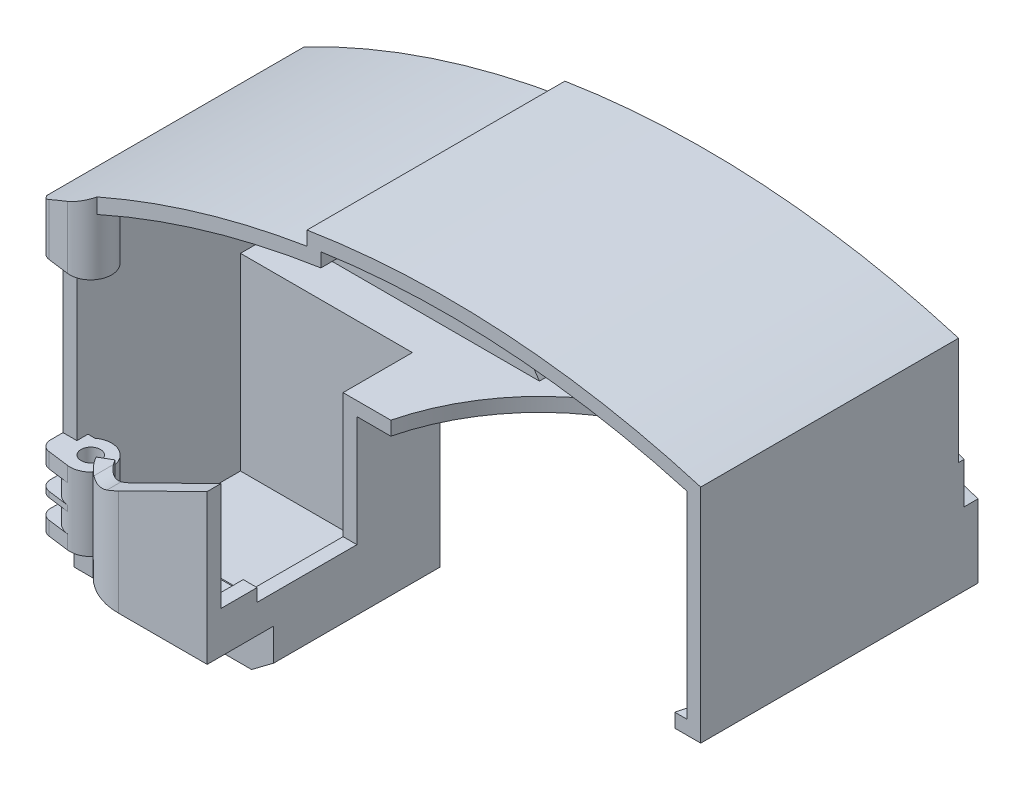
ISO-10303-21;
HEADER;
FILE_DESCRIPTION(('STEP AP214'),'2;1');
FILE_NAME('part.step','',(''),(''),'','','');
FILE_SCHEMA(('AUTOMOTIVE_DESIGN { 1 0 10303 214 1 1 1 1 }'));
ENDSEC;
DATA;
#1=APPLICATION_CONTEXT('core data for automotive mechanical design processes');
#2=APPLICATION_PROTOCOL_DEFINITION('international standard','automotive_design',2000,#1);
#3=PRODUCT_CONTEXT('',#1,'mechanical');
#4=PRODUCT('Part','Part','',(#3));
#5=PRODUCT_RELATED_PRODUCT_CATEGORY('part','',(#4));
#6=PRODUCT_DEFINITION_FORMATION('','',#4);
#7=PRODUCT_DEFINITION_CONTEXT('part definition',#1,'design');
#8=PRODUCT_DEFINITION('design','',#6,#7);
#9=PRODUCT_DEFINITION_SHAPE('','',#8);
#10=(LENGTH_UNIT() NAMED_UNIT(*) SI_UNIT(.MILLI.,.METRE.));
#11=(NAMED_UNIT(*) PLANE_ANGLE_UNIT() SI_UNIT($,.RADIAN.));
#12=(NAMED_UNIT(*) SI_UNIT($,.STERADIAN.) SOLID_ANGLE_UNIT());
#13=UNCERTAINTY_MEASURE_WITH_UNIT(LENGTH_MEASURE(1.E-05),#10,'distance_accuracy_value','');
#14=(GEOMETRIC_REPRESENTATION_CONTEXT(3) GLOBAL_UNCERTAINTY_ASSIGNED_CONTEXT((#13)) GLOBAL_UNIT_ASSIGNED_CONTEXT((#10,
#11,#12)) REPRESENTATION_CONTEXT('',''));
#15=CARTESIAN_POINT('',(0.,0.,0.));
#16=DIRECTION('',(0.,0.,1.));
#17=DIRECTION('',(1.,0.,0.));
#18=AXIS2_PLACEMENT_3D('',#15,#16,#17);
#19=CARTESIAN_POINT('',(20.,11.3,-4.));
#20=DIRECTION('',(0.,1.,0.));
#21=DIRECTION('',(0.,0.,1.));
#22=AXIS2_PLACEMENT_3D('',#19,#20,#21);
#23=PLANE('',#22);
#24=DIRECTION('',(0.,0.,1.));
#25=VECTOR('',#24,1.);
#26=CARTESIAN_POINT('',(33.5,11.3,-4.));
#27=LINE('',#26,#25);
#28=CARTESIAN_POINT('',(33.5,11.3,-5.));
#29=VERTEX_POINT('',#28);
#30=CARTESIAN_POINT('',(33.5,11.3,4.5));
#31=VERTEX_POINT('',#30);
#32=EDGE_CURVE('E1186',#29,#31,#27,.T.);
#33=ORIENTED_EDGE('',*,*,#32,.F.);
#34=DIRECTION('',(1.,0.,0.));
#35=VECTOR('',#34,1.);
#36=CARTESIAN_POINT('',(36.,11.3,-5.));
#37=LINE('',#36,#35);
#38=CARTESIAN_POINT('',(9.,11.3,-5.));
#39=VERTEX_POINT('',#38);
#40=EDGE_CURVE('E1167',#39,#29,#37,.T.);
#41=ORIENTED_EDGE('',*,*,#40,.F.);
#42=DIRECTION('',(0.,0.,-1.));
#43=VECTOR('',#42,1.);
#44=CARTESIAN_POINT('',(9.,11.3,-4.));
#45=LINE('',#44,#43);
#46=CARTESIAN_POINT('',(9.,11.3,-4.25));
#47=VERTEX_POINT('',#46);
#48=EDGE_CURVE('E635',#47,#39,#45,.T.);
#49=ORIENTED_EDGE('',*,*,#48,.F.);
#50=CARTESIAN_POINT('',(6.,11.3,-1.99999999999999));
#51=DIRECTION('',(0.,1.,0.));
#52=DIRECTION('',(0.,0.,1.));
#53=AXIS2_PLACEMENT_3D('',#50,#51,#52);
#54=CIRCLE('',#53,3.75);
#55=CARTESIAN_POINT('',(9.51161681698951,11.3,-0.684307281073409));
#56=VERTEX_POINT('',#55);
#57=EDGE_CURVE('E773',#56,#47,#54,.T.);
#58=ORIENTED_EDGE('',*,*,#57,.F.);
#59=CARTESIAN_POINT('',(20.,11.3,-4.));
#60=DIRECTION('',(0.,-1.,0.));
#61=DIRECTION('',(0.,0.,1.));
#62=AXIS2_PLACEMENT_3D('',#59,#60,#61);
#63=CIRCLE('',#62,11.);
#64=CARTESIAN_POINT('',(10.5,11.3,1.54526825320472));
#65=VERTEX_POINT('',#64);
#66=EDGE_CURVE('E1170',#65,#56,#63,.T.);
#67=ORIENTED_EDGE('',*,*,#66,.F.);
#68=DIRECTION('',(0.863636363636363,0.,-0.504115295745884));
#69=VECTOR('',#68,1.);
#70=CARTESIAN_POINT('',(20.,11.3,-4.));
#71=LINE('',#70,#69);
#72=CARTESIAN_POINT('',(12.6590909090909,11.3,0.284980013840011));
#73=VERTEX_POINT('',#72);
#74=EDGE_CURVE('E1218',#65,#73,#71,.T.);
#75=ORIENTED_EDGE('',*,*,#74,.T.);
#76=CARTESIAN_POINT('',(20.,11.3,-4.));
#77=DIRECTION('',(0.,1.,0.));
#78=DIRECTION('',(0.,0.,1.));
#79=AXIS2_PLACEMENT_3D('',#76,#77,#78);
#80=CIRCLE('',#79,8.5);
#81=CARTESIAN_POINT('',(20.,11.3,4.5));
#82=VERTEX_POINT('',#81);
#83=EDGE_CURVE('E1212',#73,#82,#80,.T.);
#84=ORIENTED_EDGE('',*,*,#83,.T.);
#85=DIRECTION('',(1.,0.,0.));
#86=VECTOR('',#85,1.);
#87=CARTESIAN_POINT('',(20.,11.3,4.5));
#88=LINE('',#87,#86);
#89=EDGE_CURVE('E1188',#82,#31,#88,.T.);
#90=ORIENTED_EDGE('',*,*,#89,.T.);
#91=EDGE_LOOP('',(#33,#41,#49,#58,#67,#75,#84,#90));
#92=FACE_BOUND('',#91,.T.);
#93=ADVANCED_FACE('F31',(#92),#23,.T.);
#94=CARTESIAN_POINT('',(0.,0.,-50.));
#95=DIRECTION('',(-1.,0.,0.));
#96=DIRECTION('',(0.,0.,1.));
#97=AXIS2_PLACEMENT_3D('',#94,#95,#96);
#98=PLANE('',#97);
#99=DIRECTION('',(0.,-1.,0.));
#100=VECTOR('',#99,1.);
#101=CARTESIAN_POINT('',(0.,19.3,-5.));
#102=LINE('',#101,#100);
#103=CARTESIAN_POINT('',(0.,19.3,-5.));
#104=VERTEX_POINT('',#103);
#105=CARTESIAN_POINT('',(0.,15.8,-5.));
#106=VERTEX_POINT('',#105);
#107=EDGE_CURVE('E668',#104,#106,#102,.T.);
#108=ORIENTED_EDGE('',*,*,#107,.F.);
#109=DIRECTION('',(0.,0.,-1.));
#110=VECTOR('',#109,1.);
#111=CARTESIAN_POINT('',(0.,19.3,-0.756338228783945));
#112=LINE('',#111,#110);
#113=CARTESIAN_POINT('',(0.,19.3,-0.756338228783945));
#114=VERTEX_POINT('',#113);
#115=EDGE_CURVE('E657',#114,#104,#112,.T.);
#116=ORIENTED_EDGE('',*,*,#115,.F.);
#117=DIRECTION('',(0.,-1.,0.));
#118=VECTOR('',#117,1.);
#119=CARTESIAN_POINT('',(0.,34.3009146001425,-0.756338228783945));
#120=LINE('',#119,#118);
#121=CARTESIAN_POINT('',(0.,22.,-0.756338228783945));
#122=VERTEX_POINT('',#121);
#123=EDGE_CURVE('E1475',#122,#114,#120,.T.);
#124=ORIENTED_EDGE('',*,*,#123,.F.);
#125=DIRECTION('',(0.,0.,1.));
#126=VECTOR('',#125,1.);
#127=CARTESIAN_POINT('',(0.,22.,-5.));
#128=LINE('',#127,#126);
#129=CARTESIAN_POINT('',(0.,22.,-3.));
#130=VERTEX_POINT('',#129);
#131=EDGE_CURVE('E1590',#130,#122,#128,.T.);
#132=ORIENTED_EDGE('',*,*,#131,.F.);
#133=DIRECTION('',(0.,-1.,0.));
#134=VECTOR('',#133,1.);
#135=CARTESIAN_POINT('',(0.,8.55808974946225,-3.));
#136=LINE('',#135,#134);
#137=CARTESIAN_POINT('',(0.,52.,-3.));
#138=VERTEX_POINT('',#137);
#139=EDGE_CURVE('E1426',#138,#130,#136,.T.);
#140=ORIENTED_EDGE('',*,*,#139,.F.);
#141=DIRECTION('',(0.,0.,-1.));
#142=VECTOR('',#141,1.);
#143=CARTESIAN_POINT('',(0.,52.,-3.));
#144=LINE('',#143,#142);
#145=CARTESIAN_POINT('',(0.,52.,0.));
#146=VERTEX_POINT('',#145);
#147=EDGE_CURVE('E1432',#146,#138,#144,.T.);
#148=ORIENTED_EDGE('',*,*,#147,.F.);
#149=DIRECTION('',(0.,-1.,0.));
#150=VECTOR('',#149,1.);
#151=CARTESIAN_POINT('',(0.,0.,0.));
#152=LINE('',#151,#150);
#153=CARTESIAN_POINT('',(0.,60.5,0.));
#154=VERTEX_POINT('',#153);
#155=EDGE_CURVE('E1743',#154,#146,#152,.T.);
#156=ORIENTED_EDGE('',*,*,#155,.F.);
#157=DIRECTION('',(0.,0.,1.));
#158=VECTOR('',#157,1.);
#159=CARTESIAN_POINT('',(0.,60.5,-50.));
#160=LINE('',#159,#158);
#161=CARTESIAN_POINT('',(0.,60.5,-46.5));
#162=VERTEX_POINT('',#161);
#163=EDGE_CURVE('E1554',#162,#154,#160,.T.);
#164=ORIENTED_EDGE('',*,*,#163,.F.);
#165=DIRECTION('',(0.,1.,0.));
#166=VECTOR('',#165,1.);
#167=CARTESIAN_POINT('',(0.,86.0517588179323,-46.5));
#168=LINE('',#167,#166);
#169=CARTESIAN_POINT('',(0.,42.1860122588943,-46.5));
#170=VERTEX_POINT('',#169);
#171=EDGE_CURVE('E1861',#170,#162,#168,.T.);
#172=ORIENTED_EDGE('',*,*,#171,.F.);
#173=DIRECTION('',(0.,0.,-1.));
#174=VECTOR('',#173,1.);
#175=CARTESIAN_POINT('',(0.,42.1860122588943,-46.5));
#176=LINE('',#175,#174);
#177=CARTESIAN_POINT('',(0.,42.1860122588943,-47.5));
#178=VERTEX_POINT('',#177);
#179=EDGE_CURVE('E1864',#170,#178,#176,.T.);
#180=ORIENTED_EDGE('',*,*,#179,.T.);
#181=DIRECTION('',(0.,1.,0.));
#182=VECTOR('',#181,1.);
#183=CARTESIAN_POINT('',(0.,83.3826321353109,-47.5));
#184=LINE('',#183,#182);
#185=CARTESIAN_POINT('',(0.,41.1860122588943,-47.5));
#186=VERTEX_POINT('',#185);
#187=EDGE_CURVE('E1840',#186,#178,#184,.T.);
#188=ORIENTED_EDGE('',*,*,#187,.F.);
#189=DIRECTION('',(0.,0.,-1.));
#190=VECTOR('',#189,1.);
#191=CARTESIAN_POINT('',(0.,41.1860122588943,-42.));
#192=LINE('',#191,#190);
#193=CARTESIAN_POINT('',(0.,41.1860122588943,-42.));
#194=VERTEX_POINT('',#193);
#195=EDGE_CURVE('E987',#194,#186,#192,.T.);
#196=ORIENTED_EDGE('',*,*,#195,.F.);
#197=DIRECTION('',(0.,1.,0.));
#198=VECTOR('',#197,1.);
#199=CARTESIAN_POINT('',(0.,34.,-42.));
#200=LINE('',#199,#198);
#201=CARTESIAN_POINT('',(0.,34.,-42.));
#202=VERTEX_POINT('',#201);
#203=EDGE_CURVE('E972',#202,#194,#200,.T.);
#204=ORIENTED_EDGE('',*,*,#203,.F.);
#205=DIRECTION('',(0.,0.,-1.));
#206=VECTOR('',#205,1.);
#207=CARTESIAN_POINT('',(0.,34.,-67.485294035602));
#208=LINE('',#207,#206);
#209=CARTESIAN_POINT('',(0.,34.,-35.));
#210=VERTEX_POINT('',#209);
#211=EDGE_CURVE('E1015',#210,#202,#208,.T.);
#212=ORIENTED_EDGE('',*,*,#211,.F.);
#213=DIRECTION('',(0.,1.,0.));
#214=VECTOR('',#213,1.);
#215=CARTESIAN_POINT('',(0.,34.,-35.));
#216=LINE('',#215,#214);
#217=CARTESIAN_POINT('',(0.,0.,-35.));
#218=VERTEX_POINT('',#217);
#219=EDGE_CURVE('E1013',#218,#210,#216,.T.);
#220=ORIENTED_EDGE('',*,*,#219,.F.);
#221=DIRECTION('',(0.,0.,1.));
#222=VECTOR('',#221,1.);
#223=CARTESIAN_POINT('',(0.,0.,-50.));
#224=LINE('',#223,#222);
#225=CARTESIAN_POINT('',(0.,0.,-5.));
#226=VERTEX_POINT('',#225);
#227=EDGE_CURVE('E1510',#218,#226,#224,.T.);
#228=ORIENTED_EDGE('',*,*,#227,.T.);
#229=DIRECTION('',(0.,-1.,0.));
#230=VECTOR('',#229,1.);
#231=CARTESIAN_POINT('',(0.,-15.2068229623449,-5.));
#232=LINE('',#231,#230);
#233=CARTESIAN_POINT('',(0.,8.8,-5.));
#234=VERTEX_POINT('',#233);
#235=EDGE_CURVE('E1443',#234,#226,#232,.T.);
#236=ORIENTED_EDGE('',*,*,#235,.F.);
#237=DIRECTION('',(0.,0.,1.));
#238=VECTOR('',#237,1.);
#239=CARTESIAN_POINT('',(0.,8.8,-5.));
#240=LINE('',#239,#238);
#241=CARTESIAN_POINT('',(0.,8.8,-0.756338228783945));
#242=VERTEX_POINT('',#241);
#243=EDGE_CURVE('E1541',#234,#242,#240,.T.);
#244=ORIENTED_EDGE('',*,*,#243,.T.);
#245=CARTESIAN_POINT('',(0.,11.3,-0.756338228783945));
#246=VERTEX_POINT('',#245);
#247=EDGE_CURVE('E1608',#246,#242,#120,.T.);
#248=ORIENTED_EDGE('',*,*,#247,.F.);
#249=DIRECTION('',(0.,0.,-1.));
#250=VECTOR('',#249,1.);
#251=CARTESIAN_POINT('',(0.,11.3,-0.756338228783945));
#252=LINE('',#251,#250);
#253=CARTESIAN_POINT('',(0.,11.3,-5.));
#254=VERTEX_POINT('',#253);
#255=EDGE_CURVE('E676',#246,#254,#252,.T.);
#256=ORIENTED_EDGE('',*,*,#255,.T.);
#257=DIRECTION('',(0.,-1.,0.));
#258=VECTOR('',#257,1.);
#259=CARTESIAN_POINT('',(0.,14.8,-5.));
#260=LINE('',#259,#258);
#261=CARTESIAN_POINT('',(0.,14.8,-5.));
#262=VERTEX_POINT('',#261);
#263=EDGE_CURVE('E704',#262,#254,#260,.T.);
#264=ORIENTED_EDGE('',*,*,#263,.F.);
#265=DIRECTION('',(0.,0.,-1.));
#266=VECTOR('',#265,1.);
#267=CARTESIAN_POINT('',(0.,14.8,-0.756338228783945));
#268=LINE('',#267,#266);
#269=CARTESIAN_POINT('',(0.,14.8,-0.756338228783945));
#270=VERTEX_POINT('',#269);
#271=EDGE_CURVE('E691',#270,#262,#268,.T.);
#272=ORIENTED_EDGE('',*,*,#271,.F.);
#273=CARTESIAN_POINT('',(0.,15.8,-0.756338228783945));
#274=VERTEX_POINT('',#273);
#275=EDGE_CURVE('E1612',#274,#270,#120,.T.);
#276=ORIENTED_EDGE('',*,*,#275,.F.);
#277=DIRECTION('',(0.,0.,-1.));
#278=VECTOR('',#277,1.);
#279=CARTESIAN_POINT('',(0.,15.8,-0.756338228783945));
#280=LINE('',#279,#278);
#281=EDGE_CURVE('E642',#274,#106,#280,.T.);
#282=ORIENTED_EDGE('',*,*,#281,.T.);
#283=EDGE_LOOP('',(#108,#116,#124,#132,#140,#148,#156,#164,#172,#180,#188,#196,#204,#212,#220,
#228,#236,#244,#248,#256,#264,#272,#276,#282));
#284=FACE_BOUND('',#283,.T.);
#285=ADVANCED_FACE('F743',(#284),#98,.T.);
#286=CARTESIAN_POINT('',(0.,34.3009146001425,-5.));
#287=DIRECTION('',(0.,0.,1.));
#288=DIRECTION('',(1.,0.,0.));
#289=AXIS2_PLACEMENT_3D('',#286,#287,#288);
#290=PLANE('',#289);
#291=DIRECTION('',(1.,0.,0.));
#292=VECTOR('',#291,1.);
#293=CARTESIAN_POINT('',(0.,19.3,-5.));
#294=LINE('',#293,#292);
#295=CARTESIAN_POINT('',(2.5,19.3,-4.99999999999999));
#296=VERTEX_POINT('',#295);
#297=CARTESIAN_POINT('',(3.75,19.3,-4.99999999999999));
#298=VERTEX_POINT('',#297);
#299=EDGE_CURVE('E660',#296,#298,#294,.T.);
#300=ORIENTED_EDGE('',*,*,#299,.F.);
#301=DIRECTION('',(0.,-1.,0.));
#302=VECTOR('',#301,1.);
#303=CARTESIAN_POINT('',(2.5,0.,-5.));
#304=LINE('',#303,#302);
#305=CARTESIAN_POINT('',(2.5,22.,-5.));
#306=VERTEX_POINT('',#305);
#307=EDGE_CURVE('E1246',#306,#296,#304,.T.);
#308=ORIENTED_EDGE('',*,*,#307,.F.);
#309=DIRECTION('',(-1.,0.,0.));
#310=VECTOR('',#309,1.);
#311=CARTESIAN_POINT('',(0.,22.,-5.));
#312=LINE('',#311,#310);
#313=CARTESIAN_POINT('',(3.75,22.,-4.99999999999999));
#314=VERTEX_POINT('',#313);
#315=EDGE_CURVE('E1592',#314,#306,#312,.T.);
#316=ORIENTED_EDGE('',*,*,#315,.F.);
#317=DIRECTION('',(0.,-1.,0.));
#318=VECTOR('',#317,1.);
#319=CARTESIAN_POINT('',(3.75,34.3009146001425,-4.99999999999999));
#320=LINE('',#319,#318);
#321=EDGE_CURVE('E1595',#314,#298,#320,.T.);
#322=ORIENTED_EDGE('',*,*,#321,.T.);
#323=EDGE_LOOP('',(#300,#308,#316,#322));
#324=FACE_BOUND('',#323,.T.);
#325=ADVANCED_FACE('F837',(#324),#290,.F.);
#326=CARTESIAN_POINT('',(1.74161984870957,34.3009146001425,1.22690146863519));
#327=DIRECTION('',(0.129190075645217,0.,-0.991619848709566));
#328=DIRECTION('',(-0.991619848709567,0.,-0.129190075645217));
#329=AXIS2_PLACEMENT_3D('',#326,#327,#328);
#330=PLANE('',#329);
#331=DIRECTION('',(-0.991619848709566,0.,-0.129190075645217));
#332=VECTOR('',#331,1.);
#333=CARTESIAN_POINT('',(5.51553721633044,19.3,1.71857443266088));
#334=LINE('',#333,#332);
#335=CARTESIAN_POINT('',(5.51553721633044,19.3,1.71857443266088));
#336=VERTEX_POINT('',#335);
#337=CARTESIAN_POINT('',(1.74161984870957,19.3,1.22690146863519));
#338=VERTEX_POINT('',#337);
#339=EDGE_CURVE('E666',#336,#338,#334,.T.);
#340=ORIENTED_EDGE('',*,*,#339,.F.);
#341=DIRECTION('',(0.,-1.,0.));
#342=VECTOR('',#341,1.);
#343=CARTESIAN_POINT('',(5.51553721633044,34.3009146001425,1.71857443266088));
#344=LINE('',#343,#342);
#345=CARTESIAN_POINT('',(5.51553721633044,22.,1.71857443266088));
#346=VERTEX_POINT('',#345);
#347=EDGE_CURVE('E1600',#346,#336,#344,.T.);
#348=ORIENTED_EDGE('',*,*,#347,.F.);
#349=DIRECTION('',(0.991619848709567,0.,0.129190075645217));
#350=VECTOR('',#349,1.);
#351=CARTESIAN_POINT('',(1.74161984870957,22.,1.22690146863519));
#352=LINE('',#351,#350);
#353=CARTESIAN_POINT('',(1.74161984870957,22.,1.22690146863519));
#354=VERTEX_POINT('',#353);
#355=EDGE_CURVE('E1584',#354,#346,#352,.T.);
#356=ORIENTED_EDGE('',*,*,#355,.F.);
#357=DIRECTION('',(0.,-1.,0.));
#358=VECTOR('',#357,1.);
#359=CARTESIAN_POINT('',(1.74161984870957,34.3009146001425,1.22690146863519));
#360=LINE('',#359,#358);
#361=EDGE_CURVE('E1605',#354,#338,#360,.T.);
#362=ORIENTED_EDGE('',*,*,#361,.T.);
#363=EDGE_LOOP('',(#340,#348,#356,#362));
#364=FACE_BOUND('',#363,.T.);
#365=ADVANCED_FACE('F827',(#364),#330,.F.);
#366=CARTESIAN_POINT('',(2.,34.3009146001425,-0.756338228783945));
#367=DIRECTION('',(0.,-1.,0.));
#368=DIRECTION('',(0.,0.,-1.));
#369=AXIS2_PLACEMENT_3D('',#366,#367,#368);
#370=CYLINDRICAL_SURFACE('',#369,2.);
#371=CARTESIAN_POINT('',(2.,19.3,-0.756338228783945));
#372=DIRECTION('',(0.,-1.,0.));
#373=DIRECTION('',(0.,0.,-1.));
#374=AXIS2_PLACEMENT_3D('',#371,#372,#373);
#375=CIRCLE('',#374,2.);
#376=EDGE_CURVE('E655',#338,#114,#375,.T.);
#377=ORIENTED_EDGE('',*,*,#376,.F.);
#378=ORIENTED_EDGE('',*,*,#361,.F.);
#379=CARTESIAN_POINT('',(2.,22.,-0.756338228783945));
#380=DIRECTION('',(0.,1.,0.));
#381=DIRECTION('',(0.,0.,1.));
#382=AXIS2_PLACEMENT_3D('',#379,#380,#381);
#383=CIRCLE('',#382,2.);
#384=EDGE_CURVE('E1587',#122,#354,#383,.T.);
#385=ORIENTED_EDGE('',*,*,#384,.F.);
#386=ORIENTED_EDGE('',*,*,#123,.T.);
#387=EDGE_LOOP('',(#377,#378,#385,#386));
#388=FACE_BOUND('',#387,.T.);
#389=ADVANCED_FACE('F832',(#388),#370,.T.);
#390=CARTESIAN_POINT('',(2.5,15.8,-4.99999999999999));
#391=VERTEX_POINT('',#390);
#392=CARTESIAN_POINT('',(2.5,14.8,-4.99999999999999));
#393=VERTEX_POINT('',#392);
#394=EDGE_CURVE('E1448',#391,#393,#304,.T.);
#395=ORIENTED_EDGE('',*,*,#394,.F.);
#396=DIRECTION('',(1.,0.,0.));
#397=VECTOR('',#396,1.);
#398=CARTESIAN_POINT('',(0.,15.8,-5.));
#399=LINE('',#398,#397);
#400=CARTESIAN_POINT('',(3.75,15.8,-4.99999999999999));
#401=VERTEX_POINT('',#400);
#402=EDGE_CURVE('E645',#391,#401,#399,.T.);
#403=ORIENTED_EDGE('',*,*,#402,.T.);
#404=CARTESIAN_POINT('',(3.75,14.8,-4.99999999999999));
#405=VERTEX_POINT('',#404);
#406=EDGE_CURVE('E1599',#401,#405,#320,.T.);
#407=ORIENTED_EDGE('',*,*,#406,.T.);
#408=DIRECTION('',(1.,0.,0.));
#409=VECTOR('',#408,1.);
#410=CARTESIAN_POINT('',(0.,14.8,-5.));
#411=LINE('',#410,#409);
#412=EDGE_CURVE('E694',#393,#405,#411,.T.);
#413=ORIENTED_EDGE('',*,*,#412,.F.);
#414=EDGE_LOOP('',(#395,#403,#407,#413));
#415=FACE_BOUND('',#414,.T.);
#416=ADVANCED_FACE('F838',(#415),#290,.F.);
#417=CARTESIAN_POINT('',(5.51553721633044,15.8,1.71857443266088));
#418=VERTEX_POINT('',#417);
#419=CARTESIAN_POINT('',(5.51553721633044,14.8,1.71857443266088));
#420=VERTEX_POINT('',#419);
#421=EDGE_CURVE('E1604',#418,#420,#344,.T.);
#422=ORIENTED_EDGE('',*,*,#421,.F.);
#423=DIRECTION('',(-0.991619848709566,0.,-0.129190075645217));
#424=VECTOR('',#423,1.);
#425=CARTESIAN_POINT('',(5.51553721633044,15.8,1.71857443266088));
#426=LINE('',#425,#424);
#427=CARTESIAN_POINT('',(1.74161984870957,15.8,1.22690146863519));
#428=VERTEX_POINT('',#427);
#429=EDGE_CURVE('E652',#418,#428,#426,.T.);
#430=ORIENTED_EDGE('',*,*,#429,.T.);
#431=CARTESIAN_POINT('',(1.74161984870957,14.8,1.22690146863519));
#432=VERTEX_POINT('',#431);
#433=EDGE_CURVE('E1609',#428,#432,#360,.T.);
#434=ORIENTED_EDGE('',*,*,#433,.T.);
#435=DIRECTION('',(-0.991619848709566,0.,-0.129190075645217));
#436=VECTOR('',#435,1.);
#437=CARTESIAN_POINT('',(5.51553721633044,14.8,1.71857443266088));
#438=LINE('',#437,#436);
#439=EDGE_CURVE('E701',#420,#432,#438,.T.);
#440=ORIENTED_EDGE('',*,*,#439,.F.);
#441=EDGE_LOOP('',(#422,#430,#434,#440));
#442=FACE_BOUND('',#441,.T.);
#443=ADVANCED_FACE('F828',(#442),#330,.F.);
#444=ORIENTED_EDGE('',*,*,#433,.F.);
#445=CARTESIAN_POINT('',(2.,15.8,-0.756338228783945));
#446=DIRECTION('',(0.,-1.,0.));
#447=DIRECTION('',(0.,0.,-1.));
#448=AXIS2_PLACEMENT_3D('',#445,#446,#447);
#449=CIRCLE('',#448,2.);
#450=EDGE_CURVE('E639',#428,#274,#449,.T.);
#451=ORIENTED_EDGE('',*,*,#450,.T.);
#452=ORIENTED_EDGE('',*,*,#275,.T.);
#453=CARTESIAN_POINT('',(2.,14.8,-0.756338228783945));
#454=DIRECTION('',(0.,-1.,0.));
#455=DIRECTION('',(0.,0.,-1.));
#456=AXIS2_PLACEMENT_3D('',#453,#454,#455);
#457=CIRCLE('',#456,2.);
#458=EDGE_CURVE('E688',#432,#270,#457,.T.);
#459=ORIENTED_EDGE('',*,*,#458,.F.);
#460=EDGE_LOOP('',(#444,#451,#452,#459));
#461=FACE_BOUND('',#460,.T.);
#462=ADVANCED_FACE('F833',(#461),#370,.T.);
#463=CARTESIAN_POINT('',(72.3598703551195,-78.830718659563,0.));
#464=DIRECTION('',(0.,0.,-1.));
#465=DIRECTION('',(-1.,0.,0.));
#466=AXIS2_PLACEMENT_3D('',#463,#464,#465);
#467=PLANE('',#466);
#468=DIRECTION('',(1.,0.,0.));
#469=VECTOR('',#468,1.);
#470=CARTESIAN_POINT('',(72.3598703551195,52.,0.));
#471=LINE('',#470,#469);
#472=CARTESIAN_POINT('',(0.148526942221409,52.,0.));
#473=VERTEX_POINT('',#472);
#474=EDGE_CURVE('E1440',#146,#473,#471,.T.);
#475=ORIENTED_EDGE('',*,*,#474,.T.);
#476=DIRECTION('',(0.,-1.,0.));
#477=VECTOR('',#476,1.);
#478=CARTESIAN_POINT('',(0.1485269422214,80.670281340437,0.));
#479=LINE('',#478,#477);
#480=CARTESIAN_POINT('',(0.148526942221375,60.5770353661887,1.1102476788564E-13));
#481=VERTEX_POINT('',#480);
#482=EDGE_CURVE('E1788',#473,#481,#479,.F.);
#483=ORIENTED_EDGE('',*,*,#482,.T.);
#484=CARTESIAN_POINT('',(72.3598703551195,-78.830718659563,0.));
#485=DIRECTION('',(0.,0.,1.));
#486=DIRECTION('',(1.,0.,0.));
#487=AXIS2_PLACEMENT_3D('',#484,#485,#486);
#488=CIRCLE('',#487,157.);
#489=EDGE_CURVE('E1778',#481,#154,#488,.T.);
#490=ORIENTED_EDGE('',*,*,#489,.T.);
#491=ORIENTED_EDGE('',*,*,#155,.T.);
#492=EDGE_LOOP('',(#475,#483,#490,#491));
#493=FACE_BOUND('',#492,.T.);
#494=ADVANCED_FACE('F868',(#493),#467,.F.);
#495=CARTESIAN_POINT('',(118.,-15.2068229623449,-5.));
#496=DIRECTION('',(0.,0.,-1.));
#497=DIRECTION('',(-1.,0.,0.));
#498=AXIS2_PLACEMENT_3D('',#495,#496,#497);
#499=PLANE('',#498);
#500=DIRECTION('',(0.,1.,0.));
#501=VECTOR('',#500,1.);
#502=CARTESIAN_POINT('',(3.75000000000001,-10.6066017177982,-5.));
#503=LINE('',#502,#501);
#504=CARTESIAN_POINT('',(3.75000000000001,8.8,-5.));
#505=VERTEX_POINT('',#504);
#506=CARTESIAN_POINT('',(3.75000000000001,0.,-5.));
#507=VERTEX_POINT('',#506);
#508=EDGE_CURVE('E1545',#505,#507,#503,.F.);
#509=ORIENTED_EDGE('',*,*,#508,.F.);
#510=DIRECTION('',(1.,0.,0.));
#511=VECTOR('',#510,1.);
#512=CARTESIAN_POINT('',(118.,8.8,-5.));
#513=LINE('',#512,#511);
#514=EDGE_CURVE('E794',#234,#505,#513,.T.);
#515=ORIENTED_EDGE('',*,*,#514,.F.);
#516=ORIENTED_EDGE('',*,*,#235,.T.);
#517=DIRECTION('',(1.,0.,0.));
#518=VECTOR('',#517,1.);
#519=CARTESIAN_POINT('',(0.,0.,-5.));
#520=LINE('',#519,#518);
#521=EDGE_CURVE('E1244',#226,#507,#520,.T.);
#522=ORIENTED_EDGE('',*,*,#521,.T.);
#523=EDGE_LOOP('',(#509,#515,#516,#522));
#524=FACE_BOUND('',#523,.T.);
#525=ADVANCED_FACE('F864',(#524),#499,.F.);
#526=DIRECTION('',(1.,0.,0.));
#527=VECTOR('',#526,1.);
#528=CARTESIAN_POINT('',(36.,8.8,-5.));
#529=LINE('',#528,#527);
#530=CARTESIAN_POINT('',(9.,8.8,-5.));
#531=VERTEX_POINT('',#530);
#532=CARTESIAN_POINT('',(36.,8.8,-5.));
#533=VERTEX_POINT('',#532);
#534=EDGE_CURVE('E1147',#531,#533,#529,.T.);
#535=ORIENTED_EDGE('',*,*,#534,.F.);
#536=DIRECTION('',(0.,-1.,0.));
#537=VECTOR('',#536,1.);
#538=CARTESIAN_POINT('',(9.,11.3,-5.));
#539=LINE('',#538,#537);
#540=CARTESIAN_POINT('',(9.,9.,-5.));
#541=VERTEX_POINT('',#540);
#542=EDGE_CURVE('E631',#541,#531,#539,.T.);
#543=ORIENTED_EDGE('',*,*,#542,.F.);
#544=DIRECTION('',(-1.,0.,0.));
#545=VECTOR('',#544,1.);
#546=CARTESIAN_POINT('',(0.,9.,-5.));
#547=LINE('',#546,#545);
#548=CARTESIAN_POINT('',(8.24999999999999,9.,-5.));
#549=VERTEX_POINT('',#548);
#550=EDGE_CURVE('E1472',#541,#549,#547,.T.);
#551=ORIENTED_EDGE('',*,*,#550,.T.);
#552=DIRECTION('',(0.,-1.,0.));
#553=VECTOR('',#552,1.);
#554=CARTESIAN_POINT('',(8.24999999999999,34.3009146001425,-5.));
#555=LINE('',#554,#553);
#556=CARTESIAN_POINT('',(8.24999999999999,8.8,-5.));
#557=VERTEX_POINT('',#556);
#558=EDGE_CURVE('E1473',#557,#549,#555,.F.);
#559=ORIENTED_EDGE('',*,*,#558,.F.);
#560=DIRECTION('',(0.,1.,0.));
#561=VECTOR('',#560,1.);
#562=CARTESIAN_POINT('',(8.24999999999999,-10.6066017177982,-5.));
#563=LINE('',#562,#561);
#564=CARTESIAN_POINT('',(8.24999999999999,0.,-5.));
#565=VERTEX_POINT('',#564);
#566=EDGE_CURVE('E1560',#565,#557,#563,.T.);
#567=ORIENTED_EDGE('',*,*,#566,.F.);
#568=CARTESIAN_POINT('',(32.,0.,-5.));
#569=VERTEX_POINT('',#568);
#570=EDGE_CURVE('E1242',#565,#569,#520,.T.);
#571=ORIENTED_EDGE('',*,*,#570,.T.);
#572=DIRECTION('',(-0.800000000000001,-0.599999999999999,0.));
#573=VECTOR('',#572,1.);
#574=CARTESIAN_POINT('',(32.,0.,-5.));
#575=LINE('',#574,#573);
#576=CARTESIAN_POINT('',(36.,3.00000000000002,-5.));
#577=VERTEX_POINT('',#576);
#578=EDGE_CURVE('E1240',#569,#577,#575,.F.);
#579=ORIENTED_EDGE('',*,*,#578,.T.);
#580=DIRECTION('',(0.,1.,0.));
#581=VECTOR('',#580,1.);
#582=CARTESIAN_POINT('',(36.,0.,-5.));
#583=LINE('',#582,#581);
#584=EDGE_CURVE('E1238',#577,#533,#583,.T.);
#585=ORIENTED_EDGE('',*,*,#584,.T.);
#586=EDGE_LOOP('',(#535,#543,#551,#559,#567,#571,#579,#585));
#587=FACE_BOUND('',#586,.T.);
#588=ADVANCED_FACE('F867',(#587),#499,.F.);
#589=CARTESIAN_POINT('',(0.,0.,-50.));
#590=DIRECTION('',(0.,-1.,0.));
#591=DIRECTION('',(0.,0.,-1.));
#592=AXIS2_PLACEMENT_3D('',#589,#590,#591);
#593=PLANE('',#592);
#594=ORIENTED_EDGE('',*,*,#570,.F.);
#595=CARTESIAN_POINT('',(6.,0.,-1.99999999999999));
#596=DIRECTION('',(0.,-1.,0.));
#597=DIRECTION('',(0.,0.,-1.));
#598=AXIS2_PLACEMENT_3D('',#595,#596,#597);
#599=CIRCLE('',#598,3.75);
#600=EDGE_CURVE('E1558',#507,#565,#599,.T.);
#601=ORIENTED_EDGE('',*,*,#600,.F.);
#602=ORIENTED_EDGE('',*,*,#521,.F.);
#603=ORIENTED_EDGE('',*,*,#227,.F.);
#604=DIRECTION('',(-1.,0.,0.));
#605=VECTOR('',#604,1.);
#606=CARTESIAN_POINT('',(0.,0.,-35.));
#607=LINE('',#606,#605);
#608=CARTESIAN_POINT('',(32.,0.,-35.));
#609=VERTEX_POINT('',#608);
#610=EDGE_CURVE('E1024',#609,#218,#607,.T.);
#611=ORIENTED_EDGE('',*,*,#610,.F.);
#612=DIRECTION('',(0.,0.,1.));
#613=VECTOR('',#612,1.);
#614=CARTESIAN_POINT('',(32.,0.,-50.));
#615=LINE('',#614,#613);
#616=EDGE_CURVE('E1506',#609,#569,#615,.T.);
#617=ORIENTED_EDGE('',*,*,#616,.T.);
#618=EDGE_LOOP('',(#594,#601,#602,#603,#611,#617));
#619=FACE_BOUND('',#618,.T.);
#620=ADVANCED_FACE('F33',(#619),#593,.T.);
#621=CARTESIAN_POINT('',(0.,9.,-7.5));
#622=DIRECTION('',(0.,1.,0.));
#623=DIRECTION('',(0.,0.,1.));
#624=AXIS2_PLACEMENT_3D('',#621,#622,#623);
#625=PLANE('',#624);
#626=CARTESIAN_POINT('',(3.75,9.,-5.));
#627=VERTEX_POINT('',#626);
#628=CARTESIAN_POINT('',(2.5,9.,-5.));
#629=VERTEX_POINT('',#628);
#630=EDGE_CURVE('E1462',#627,#629,#547,.T.);
#631=ORIENTED_EDGE('',*,*,#630,.F.);
#632=CARTESIAN_POINT('',(6.,9.,-1.99999999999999));
#633=DIRECTION('',(0.,1.,0.));
#634=DIRECTION('',(0.,0.,1.));
#635=AXIS2_PLACEMENT_3D('',#632,#633,#634);
#636=CIRCLE('',#635,3.75);
#637=EDGE_CURVE('E1534',#627,#549,#636,.F.);
#638=ORIENTED_EDGE('',*,*,#637,.T.);
#639=ORIENTED_EDGE('',*,*,#550,.F.);
#640=CARTESIAN_POINT('',(33.5,9.,-5.));
#641=VERTEX_POINT('',#640);
#642=EDGE_CURVE('E1183',#641,#541,#547,.T.);
#643=ORIENTED_EDGE('',*,*,#642,.F.);
#644=DIRECTION('',(0.,0.,1.));
#645=VECTOR('',#644,1.);
#646=CARTESIAN_POINT('',(33.5,9.,-50.));
#647=LINE('',#646,#645);
#648=CARTESIAN_POINT('',(33.5,9.,-7.5));
#649=VERTEX_POINT('',#648);
#650=EDGE_CURVE('E1468',#649,#641,#647,.T.);
#651=ORIENTED_EDGE('',*,*,#650,.F.);
#652=DIRECTION('',(-1.,0.,0.));
#653=VECTOR('',#652,1.);
#654=CARTESIAN_POINT('',(0.,9.,-7.5));
#655=LINE('',#654,#653);
#656=CARTESIAN_POINT('',(2.5,9.,-7.5));
#657=VERTEX_POINT('',#656);
#658=EDGE_CURVE('E1466',#649,#657,#655,.T.);
#659=ORIENTED_EDGE('',*,*,#658,.T.);
#660=DIRECTION('',(0.,0.,-1.));
#661=VECTOR('',#660,1.);
#662=CARTESIAN_POINT('',(2.5,9.,-50.));
#663=LINE('',#662,#661);
#664=EDGE_CURVE('E1455',#629,#657,#663,.T.);
#665=ORIENTED_EDGE('',*,*,#664,.F.);
#666=EDGE_LOOP('',(#631,#638,#639,#643,#651,#659,#665));
#667=FACE_BOUND('',#666,.T.);
#668=ADVANCED_FACE('F843',(#667),#625,.T.);
#669=CARTESIAN_POINT('',(47.,76.1075818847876,0.));
#670=VERTEX_POINT('',#669);
#671=CARTESIAN_POINT('',(9.17214438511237,64.8923180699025,0.));
#672=VERTEX_POINT('',#671);
#673=EDGE_CURVE('E1779',#670,#672,#488,.T.);
#674=ORIENTED_EDGE('',*,*,#673,.T.);
#675=DIRECTION('',(0.,-1.,0.));
#676=VECTOR('',#675,1.);
#677=CARTESIAN_POINT('',(9.17214438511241,80.670281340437,0.));
#678=LINE('',#677,#676);
#679=CARTESIAN_POINT('',(9.17214438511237,62.1570867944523,0.));
#680=VERTEX_POINT('',#679);
#681=EDGE_CURVE('E1563',#672,#680,#678,.T.);
#682=ORIENTED_EDGE('',*,*,#681,.T.);
#683=CARTESIAN_POINT('',(72.3598703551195,-78.830718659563,0.));
#684=DIRECTION('',(0.,0.,-1.));
#685=DIRECTION('',(-1.,0.,0.));
#686=AXIS2_PLACEMENT_3D('',#683,#684,#685);
#687=CIRCLE('',#686,154.5);
#688=CARTESIAN_POINT('',(49.5,73.9687457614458,0.));
#689=VERTEX_POINT('',#688);
#690=EDGE_CURVE('E958',#689,#680,#687,.F.);
#691=ORIENTED_EDGE('',*,*,#690,.F.);
#692=DIRECTION('',(0.,-1.,0.));
#693=VECTOR('',#692,1.);
#694=CARTESIAN_POINT('',(49.5,78.6403166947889,0.));
#695=LINE('',#694,#693);
#696=CARTESIAN_POINT('',(49.5,76.4961184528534,0.));
#697=VERTEX_POINT('',#696);
#698=EDGE_CURVE('E955',#697,#689,#695,.T.);
#699=ORIENTED_EDGE('',*,*,#698,.F.);
#700=CARTESIAN_POINT('',(72.3598703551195,-78.830718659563,0.));
#701=DIRECTION('',(0.,0.,-1.));
#702=DIRECTION('',(-1.,0.,0.));
#703=AXIS2_PLACEMENT_3D('',#700,#701,#702);
#704=CIRCLE('',#703,157.);
#705=CARTESIAN_POINT('',(115.5,72.1259943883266,0.));
#706=VERTEX_POINT('',#705);
#707=EDGE_CURVE('E951',#706,#697,#704,.F.);
#708=ORIENTED_EDGE('',*,*,#707,.F.);
#709=DIRECTION('',(0.,1.,0.));
#710=VECTOR('',#709,1.);
#711=CARTESIAN_POINT('',(115.5,34.,0.));
#712=LINE('',#711,#710);
#713=CARTESIAN_POINT('',(115.5,36.5,0.));
#714=VERTEX_POINT('',#713);
#715=EDGE_CURVE('E948',#714,#706,#712,.T.);
#716=ORIENTED_EDGE('',*,*,#715,.F.);
#717=DIRECTION('',(1.,0.,0.));
#718=VECTOR('',#717,1.);
#719=CARTESIAN_POINT('',(36.,36.5,0.));
#720=LINE('',#719,#718);
#721=CARTESIAN_POINT('',(113.327043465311,36.5,0.));
#722=VERTEX_POINT('',#721);
#723=EDGE_CURVE('E952',#722,#714,#720,.T.);
#724=ORIENTED_EDGE('',*,*,#723,.F.);
#725=DIRECTION('',(0.,-1.,0.));
#726=VECTOR('',#725,1.);
#727=CARTESIAN_POINT('',(113.327043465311,39.,0.));
#728=LINE('',#727,#726);
#729=CARTESIAN_POINT('',(113.327043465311,34.,0.));
#730=VERTEX_POINT('',#729);
#731=EDGE_CURVE('E1255',#722,#730,#728,.T.);
#732=ORIENTED_EDGE('',*,*,#731,.T.);
#733=DIRECTION('',(1.,0.,0.));
#734=VECTOR('',#733,1.);
#735=CARTESIAN_POINT('',(36.,34.,0.));
#736=LINE('',#735,#734);
#737=CARTESIAN_POINT('',(118.,34.,0.));
#738=VERTEX_POINT('',#737);
#739=EDGE_CURVE('E1772',#730,#738,#736,.T.);
#740=ORIENTED_EDGE('',*,*,#739,.T.);
#741=DIRECTION('',(0.,1.,0.));
#742=VECTOR('',#741,1.);
#743=CARTESIAN_POINT('',(118.,34.,0.));
#744=LINE('',#743,#742);
#745=CARTESIAN_POINT('',(118.,74.,0.));
#746=VERTEX_POINT('',#745);
#747=EDGE_CURVE('E1760',#738,#746,#744,.T.);
#748=ORIENTED_EDGE('',*,*,#747,.T.);
#749=CARTESIAN_POINT('',(72.3598703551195,-78.830718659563,0.));
#750=DIRECTION('',(0.,0.,1.));
#751=DIRECTION('',(-1.,0.,0.));
#752=AXIS2_PLACEMENT_3D('',#749,#750,#751);
#753=CIRCLE('',#752,159.5);
#754=CARTESIAN_POINT('',(47.,78.6403166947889,0.));
#755=VERTEX_POINT('',#754);
#756=EDGE_CURVE('E1765',#746,#755,#753,.T.);
#757=ORIENTED_EDGE('',*,*,#756,.T.);
#758=DIRECTION('',(0.,-1.,0.));
#759=VECTOR('',#758,1.);
#760=CARTESIAN_POINT('',(47.,78.6403166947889,0.));
#761=LINE('',#760,#759);
#762=EDGE_CURVE('E1770',#755,#670,#761,.T.);
#763=ORIENTED_EDGE('',*,*,#762,.T.);
#764=EDGE_LOOP('',(#674,#682,#691,#699,#708,#716,#724,#732,#740,#748,#757,#763));
#765=FACE_BOUND('',#764,.T.);
#766=ADVANCED_FACE('F846',(#765),#467,.F.);
#767=CARTESIAN_POINT('',(72.3598703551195,-78.830718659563,-50.));
#768=DIRECTION('',(0.,0.,-1.));
#769=DIRECTION('',(-1.,0.,0.));
#770=AXIS2_PLACEMENT_3D('',#767,#768,#769);
#771=PLANE('',#770);
#772=DIRECTION('',(0.,-1.,0.));
#773=VECTOR('',#772,1.);
#774=CARTESIAN_POINT('',(86.8881944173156,80.670281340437,-50.));
#775=LINE('',#774,#773);
#776=CARTESIAN_POINT('',(86.8881944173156,54.3793702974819,-50.));
#777=VERTEX_POINT('',#776);
#778=CARTESIAN_POINT('',(86.8881944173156,34.,-50.));
#779=VERTEX_POINT('',#778);
#780=EDGE_CURVE('E1851',#777,#779,#775,.T.);
#781=ORIENTED_EDGE('',*,*,#780,.F.);
#782=CARTESIAN_POINT('',(72.3598703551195,-78.830718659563,-50.));
#783=DIRECTION('',(0.,0.,1.));
#784=DIRECTION('',(1.,0.,0.));
#785=AXIS2_PLACEMENT_3D('',#782,#783,#784);
#786=CIRCLE('',#785,134.);
#787=CARTESIAN_POINT('',(118.,47.1572909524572,-50.));
#788=VERTEX_POINT('',#787);
#789=EDGE_CURVE('E1834',#788,#777,#786,.T.);
#790=ORIENTED_EDGE('',*,*,#789,.F.);
#791=DIRECTION('',(0.,1.,0.));
#792=VECTOR('',#791,1.);
#793=CARTESIAN_POINT('',(118.,34.,-50.));
#794=LINE('',#793,#792);
#795=CARTESIAN_POINT('',(118.,34.,-50.));
#796=VERTEX_POINT('',#795);
#797=EDGE_CURVE('E1496',#796,#788,#794,.T.);
#798=ORIENTED_EDGE('',*,*,#797,.F.);
#799=DIRECTION('',(1.,0.,0.));
#800=VECTOR('',#799,1.);
#801=CARTESIAN_POINT('',(36.,34.,-50.));
#802=LINE('',#801,#800);
#803=EDGE_CURVE('E1741',#779,#796,#802,.T.);
#804=ORIENTED_EDGE('',*,*,#803,.F.);
#805=EDGE_LOOP('',(#781,#790,#798,#804));
#806=FACE_BOUND('',#805,.T.);
#807=ADVANCED_FACE('F741',(#806),#771,.T.);
#808=CARTESIAN_POINT('',(72.3598703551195,-78.830718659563,-50.));
#809=DIRECTION('',(0.,0.,1.));
#810=DIRECTION('',(1.,0.,0.));
#811=AXIS2_PLACEMENT_3D('',#808,#809,#810);
#812=CYLINDRICAL_SURFACE('',#811,157.);
#813=ORIENTED_EDGE('',*,*,#489,.F.);
#814=CARTESIAN_POINT('',(2.,61.5205857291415,-2.75633822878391));
#815=CARTESIAN_POINT('',(2.12248826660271,61.581990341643,-2.75633456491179));
#816=CARTESIAN_POINT('',(2.24515870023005,61.6432841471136,-2.7450684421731));
#817=CARTESIAN_POINT('',(2.48744287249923,61.7639549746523,-2.69994764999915));
#818=CARTESIAN_POINT('',(2.60705190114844,61.8233290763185,-2.66606011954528));
#819=CARTESIAN_POINT('',(2.83977811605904,61.9385026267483,-2.57578285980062));
#820=CARTESIAN_POINT('',(2.95287915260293,61.9942932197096,-2.51933969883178));
#821=CARTESIAN_POINT('',(3.16822708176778,62.1002250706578,-2.38463567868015));
#822=CARTESIAN_POINT('',(3.27048054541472,62.150369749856,-2.30638813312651));
#823=CARTESIAN_POINT('',(3.45350672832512,62.2399117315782,-2.13544644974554));
#824=CARTESIAN_POINT('',(3.53525648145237,62.279802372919,-2.04406142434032));
#825=CARTESIAN_POINT('',(3.68179553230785,62.3511806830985,-1.84570914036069));
#826=CARTESIAN_POINT('',(3.74659820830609,62.3826749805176,-1.73875427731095));
#827=CARTESIAN_POINT('',(3.84982968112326,62.4327843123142,-1.52489006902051));
#828=CARTESIAN_POINT('',(3.89035593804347,62.4524253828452,-1.41923256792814));
#829=CARTESIAN_POINT('',(3.95313134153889,62.4828309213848,-1.20141751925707));
#830=CARTESIAN_POINT('',(3.97539253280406,62.4936012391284,-1.0892643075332));
#831=CARTESIAN_POINT('',(3.99935776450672,62.5051949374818,-0.872251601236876));
#832=CARTESIAN_POINT('',(4.00268704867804,62.5068047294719,-0.767610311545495));
#833=CARTESIAN_POINT('',(3.992996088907,62.5021173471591,-0.559280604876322));
#834=CARTESIAN_POINT('',(3.97997941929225,62.4958219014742,-0.455591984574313));
#835=CARTESIAN_POINT('',(3.93877726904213,62.47587891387,-0.25499126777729));
#836=CARTESIAN_POINT('',(3.91101173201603,62.4624349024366,-0.157971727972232));
#837=CARTESIAN_POINT('',(3.84174599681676,62.4288583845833,0.02978413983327));
#838=CARTESIAN_POINT('',(3.80024432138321,62.4087251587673,0.120519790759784));
#839=CARTESIAN_POINT('',(3.70327659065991,62.3616151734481,0.296921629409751));
#840=CARTESIAN_POINT('',(3.64734515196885,62.3344100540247,0.382270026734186));
#841=CARTESIAN_POINT('',(3.52435776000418,62.2744792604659,0.542326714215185));
#842=CARTESIAN_POINT('',(3.45729838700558,62.2417518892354,0.617031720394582));
#843=CARTESIAN_POINT('',(3.30809927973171,62.1687861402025,0.760385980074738));
#844=CARTESIAN_POINT('',(3.22516738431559,62.1281485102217,0.828006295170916));
#845=CARTESIAN_POINT('',(3.05114765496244,62.0426654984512,0.948449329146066));
#846=CARTESIAN_POINT('',(2.96005651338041,61.9978184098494,1.00126601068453));
#847=CARTESIAN_POINT('',(2.76254642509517,61.9003219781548,1.09614744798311));
#848=CARTESIAN_POINT('',(2.65550879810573,61.8473421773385,1.13658603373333));
#849=CARTESIAN_POINT('',(2.4372567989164,61.7389899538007,1.19857629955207));
#850=CARTESIAN_POINT('',(2.32604069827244,61.6836165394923,1.22012007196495));
#851=CARTESIAN_POINT('',(2.09272493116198,61.5670969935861,1.24523351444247));
#852=CARTESIAN_POINT('',(1.97049267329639,61.5058552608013,1.2471500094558));
#853=CARTESIAN_POINT('',(1.72750233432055,61.3837139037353,1.22875636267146));
#854=CARTESIAN_POINT('',(1.60674473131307,61.3228143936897,1.20843919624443));
#855=CARTESIAN_POINT('',(1.36640826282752,61.2012312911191,1.14483812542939));
#856=CARTESIAN_POINT('',(1.24697474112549,61.1406095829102,1.10088015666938));
#857=CARTESIAN_POINT('',(1.01695581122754,61.0235097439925,0.990061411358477));
#858=CARTESIAN_POINT('',(0.906369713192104,60.96703129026,0.92320242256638));
#859=CARTESIAN_POINT('',(0.703001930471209,60.8628949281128,0.771133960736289));
#860=CARTESIAN_POINT('',(0.609636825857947,60.8149515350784,0.686905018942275));
#861=CARTESIAN_POINT('',(0.438805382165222,60.7270459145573,0.500104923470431));
#862=CARTESIAN_POINT('',(0.361326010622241,60.6870771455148,0.397548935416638));
#863=CARTESIAN_POINT('',(0.233661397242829,60.6211174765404,0.188841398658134));
#864=CARTESIAN_POINT('',(0.181433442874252,60.5940838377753,0.0842711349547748));
#865=CARTESIAN_POINT('',(0.0956343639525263,60.5496334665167,-0.134150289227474));
#866=CARTESIAN_POINT('',(0.0620459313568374,60.5322078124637,-0.24799272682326));
#867=CARTESIAN_POINT('',(0.0181195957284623,60.5094106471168,-0.467769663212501));
#868=CARTESIAN_POINT('',(0.00559098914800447,60.5029035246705,-0.573152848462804));
#869=CARTESIAN_POINT('',(-0.00259491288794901,60.4986524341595,-0.78473457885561));
#870=CARTESIAN_POINT('',(0.00174142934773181,60.5009051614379,-0.890932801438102));
#871=CARTESIAN_POINT('',(0.026357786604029,60.5136860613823,-1.09506757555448));
#872=CARTESIAN_POINT('',(0.0457633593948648,60.5237603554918,-1.19314041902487));
#873=CARTESIAN_POINT('',(0.0985727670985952,60.5511515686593,-1.38436282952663));
#874=CARTESIAN_POINT('',(0.13197734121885,60.5684688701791,-1.47751213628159));
#875=CARTESIAN_POINT('',(0.212435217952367,60.6101279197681,-1.65895211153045));
#876=CARTESIAN_POINT('',(0.259813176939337,60.6346366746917,-1.74705965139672));
#877=CARTESIAN_POINT('',(0.366088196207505,60.6895268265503,-1.91397861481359));
#878=CARTESIAN_POINT('',(0.424988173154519,60.7199097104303,-1.99278767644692));
#879=CARTESIAN_POINT('',(0.557886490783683,60.7883385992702,-2.14610721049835));
#880=CARTESIAN_POINT('',(0.632743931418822,60.826817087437,-2.21967839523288));
#881=CARTESIAN_POINT('',(0.791534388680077,60.9082567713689,-2.35333429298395));
#882=CARTESIAN_POINT('',(0.875473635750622,60.9512210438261,-2.41340965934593));
#883=CARTESIAN_POINT('',(1.05988189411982,61.0453818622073,-2.52525135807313));
#884=CARTESIAN_POINT('',(1.16115286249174,61.0969636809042,-2.57536963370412));
#885=CARTESIAN_POINT('',(1.36936569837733,61.2027125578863,-2.6576057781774));
#886=CARTESIAN_POINT('',(1.47630320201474,61.2568776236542,-2.68973728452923));
#887=CARTESIAN_POINT('',(1.65313447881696,61.3461816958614,-2.72726988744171));
#888=CARTESIAN_POINT('',(1.72210134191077,61.3809484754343,-2.73816196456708));
#889=CARTESIAN_POINT('',(1.86069246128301,61.4506840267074,-2.75269736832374));
#890=CARTESIAN_POINT('',(1.93031675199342,61.4856528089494,-2.75634031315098));
#891=CARTESIAN_POINT('',(2.,61.5205857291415,-2.75633822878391));
#892=B_SPLINE_CURVE_WITH_KNOTS('',3,(#814,#815,#816,#817,#818,#819,#820,#821,#822,#823,#824,
#825,#826,#827,#828,#829,#830,#831,#832,#833,#834,#835,#836,#837,#838,#839,#840,#841,#842,#843,
#844,#845,#846,#847,#848,#849,#850,#851,#852,#853,#854,#855,#856,#857,#858,#859,#860,#861,#862,
#863,#864,#865,#866,#867,#868,#869,#870,#871,#872,#873,#874,#875,#876,#877,#878,#879,#880,#881,
#882,#883,#884,#885,#886,#887,#888,#889,#890,#891),.UNSPECIFIED.,.T.,.F.,(4,2,2,2,2,2,2,2,2,2,2,
2,2,2,2,2,2,2,2,2,2,2,2,2,2,2,2,2,2,2,2,2,2,2,2,2,2,2,4),(0.,0.410780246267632,
0.822158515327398,1.23451712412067,1.64662449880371,2.03128721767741,2.4156453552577,
2.75833909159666,3.10080666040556,3.4133713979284,3.72586779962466,4.02990914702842,
4.33398320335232,4.64946230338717,4.96503853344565,5.30700658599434,5.64911390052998,
6.02579708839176,6.40263784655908,6.81098199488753,7.21945519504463,7.64024547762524,
8.0610029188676,8.46249254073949,8.8636514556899,9.22153584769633,9.57908736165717,
9.89641153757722,10.2136160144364,10.5136752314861,10.8137502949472,11.1214354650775,
11.4291986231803,11.7632000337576,12.0974320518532,12.4685405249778,12.8393672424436,
13.0730467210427,13.3067385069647),.UNSPECIFIED.);
#893=CARTESIAN_POINT('',(1.74161984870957,61.3907586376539,1.22690146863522));
#894=VERTEX_POINT('',#893);
#895=EDGE_CURVE('E706',#894,#481,#892,.T.);
#896=ORIENTED_EDGE('',*,*,#895,.F.);
#897=CARTESIAN_POINT('',(72.3598703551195,-78.830718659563,10.4271783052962));
#898=DIRECTION('',(-0.129190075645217,0.,0.991619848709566));
#899=DIRECTION('',(0.991619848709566,0.,0.129190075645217));
#900=AXIS2_PLACEMENT_3D('',#897,#898,#899);
#901=ELLIPSE('',#900,158.326802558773,157.);
#902=CARTESIAN_POINT('',(5.51553721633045,63.2285475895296,1.71857443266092));
#903=VERTEX_POINT('',#902);
#904=EDGE_CURVE('E729',#903,#894,#901,.T.);
#905=ORIENTED_EDGE('',*,*,#904,.F.);
#906=CARTESIAN_POINT('',(6.,63.4554985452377,-5.74999999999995));
#907=CARTESIAN_POINT('',(6.22620586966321,63.5609963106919,-5.74999622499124));
#908=CARTESIAN_POINT('',(6.45282002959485,63.6660232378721,-5.72951258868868));
#909=CARTESIAN_POINT('',(6.9007012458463,63.8723227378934,-5.64734176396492));
#910=CARTESIAN_POINT('',(7.12196087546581,63.9735901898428,-5.58560040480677));
#911=CARTESIAN_POINT('',(7.44463240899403,64.1204130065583,-5.46249640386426));
#912=CARTESIAN_POINT('',(7.55082183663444,64.1685832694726,-5.41627754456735));
#913=CARTESIAN_POINT('',(7.75918515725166,64.2628329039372,-5.3137933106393));
#914=CARTESIAN_POINT('',(7.86136076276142,64.3089131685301,-5.2575322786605));
#915=CARTESIAN_POINT('',(8.06079009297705,64.3986088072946,-5.13517705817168));
#916=CARTESIAN_POINT('',(8.15804371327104,64.4422241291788,-5.06908266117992));
#917=CARTESIAN_POINT('',(8.34663623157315,64.5265850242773,-4.92740452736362));
#918=CARTESIAN_POINT('',(8.4379782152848,64.5673320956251,-4.85182580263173));
#919=CARTESIAN_POINT('',(8.60869524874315,64.6433064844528,-4.696249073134));
#920=CARTESIAN_POINT('',(8.6884574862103,64.6787170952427,-4.61676536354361));
#921=CARTESIAN_POINT('',(8.84106421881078,64.7463276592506,-4.45022483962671));
#922=CARTESIAN_POINT('',(8.91391217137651,64.7785292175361,-4.36317185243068));
#923=CARTESIAN_POINT('',(9.05190935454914,64.8394165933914,-4.18204250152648));
#924=CARTESIAN_POINT('',(9.11706019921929,64.8681031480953,-4.0879676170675));
#925=CARTESIAN_POINT('',(9.23889750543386,64.9216629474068,-3.89346449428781));
#926=CARTESIAN_POINT('',(9.29558476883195,64.9465365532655,-3.7930368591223));
#927=CARTESIAN_POINT('',(9.39499577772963,64.9900977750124,-3.59609925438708));
#928=CARTESIAN_POINT('',(9.43852298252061,65.0091433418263,-3.50007322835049));
#929=CARTESIAN_POINT('',(9.51752562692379,65.0436764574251,-3.30410004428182));
#930=CARTESIAN_POINT('',(9.55299833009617,65.0591627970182,-3.20415156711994));
#931=CARTESIAN_POINT('',(9.6154271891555,65.0863964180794,-3.00122268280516));
#932=CARTESIAN_POINT('',(9.64239027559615,65.0981467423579,-2.89824481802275));
#933=CARTESIAN_POINT('',(9.68751794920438,65.1178028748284,-2.68997601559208));
#934=CARTESIAN_POINT('',(9.70567949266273,65.1257073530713,-2.58468429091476));
#935=CARTESIAN_POINT('',(9.73197014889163,65.1371468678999,-2.38042077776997));
#936=CARTESIAN_POINT('',(9.74073206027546,65.1409575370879,-2.28154533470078));
#937=CARTESIAN_POINT('',(9.75038839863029,65.1451570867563,-2.08330295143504));
#938=CARTESIAN_POINT('',(9.75128007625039,65.1455447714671,-1.98393585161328));
#939=CARTESIAN_POINT('',(9.7451763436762,65.142890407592,-1.78554049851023));
#940=CARTESIAN_POINT('',(9.73818537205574,65.1398502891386,-1.68651208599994));
#941=CARTESIAN_POINT('',(9.71641006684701,65.1303768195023,-1.48946919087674));
#942=CARTESIAN_POINT('',(9.70162285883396,65.1239422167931,-1.39145509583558));
#943=CARTESIAN_POINT('',(9.64667766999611,65.1000185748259,-1.10481018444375));
#944=CARTESIAN_POINT('',(9.59576140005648,65.0778344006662,-0.918498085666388));
#945=CARTESIAN_POINT('',(9.46680226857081,65.0215210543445,-0.557577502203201));
#946=CARTESIAN_POINT('',(9.38875737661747,64.987390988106,-0.382969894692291));
#947=CARTESIAN_POINT('',(9.20587307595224,64.9071776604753,-0.0447932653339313));
#948=CARTESIAN_POINT('',(9.1003444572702,64.860786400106,0.118329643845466));
#949=CARTESIAN_POINT('',(8.86733353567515,64.7579785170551,0.424446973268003));
#950=CARTESIAN_POINT('',(8.73984564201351,64.7015593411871,0.567436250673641));
#951=CARTESIAN_POINT('',(8.45758576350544,64.5761270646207,0.839676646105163));
#952=CARTESIAN_POINT('',(8.30155129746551,64.5065201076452,0.967343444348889));
#953=CARTESIAN_POINT('',(7.97367758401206,64.3595410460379,1.19483296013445));
#954=CARTESIAN_POINT('',(7.80183276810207,64.2821662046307,1.29464581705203));
#955=CARTESIAN_POINT('',(7.43167598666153,64.1146352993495,1.47253248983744));
#956=CARTESIAN_POINT('',(7.23235744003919,64.0239520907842,1.54801621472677));
#957=CARTESIAN_POINT('',(6.82587529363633,63.8379377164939,1.66403467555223));
#958=CARTESIAN_POINT('',(6.61870878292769,63.7426048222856,1.70455630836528));
#959=CARTESIAN_POINT('',(6.18595203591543,63.5422896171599,1.75216993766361));
#960=CARTESIAN_POINT('',(5.96014495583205,63.4371197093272,1.75652795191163));
#961=CARTESIAN_POINT('',(5.51132298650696,63.2267809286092,1.72482579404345));
#962=CARTESIAN_POINT('',(5.28830894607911,63.1216120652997,1.68875362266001));
#963=CARTESIAN_POINT('',(4.84395438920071,62.9108190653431,1.57496547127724));
#964=CARTESIAN_POINT('',(4.62290354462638,62.8052911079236,1.49593484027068));
#965=CARTESIAN_POINT('',(4.19679659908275,62.6007175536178,1.29639118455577));
#966=CARTESIAN_POINT('',(3.99174025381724,62.5016718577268,1.17587879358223));
#967=CARTESIAN_POINT('',(3.70520696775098,62.362581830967,0.968127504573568));
#968=CARTESIAN_POINT('',(3.61459153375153,62.3184795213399,0.89583869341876));
#969=CARTESIAN_POINT('',(3.43971644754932,62.2331739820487,0.742435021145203));
#970=CARTESIAN_POINT('',(3.35545352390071,62.1919692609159,0.661324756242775));
#971=CARTESIAN_POINT('',(3.19416377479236,62.1129336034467,0.490697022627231));
#972=CARTESIAN_POINT('',(3.11713708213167,62.0751027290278,0.40117939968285));
#973=CARTESIAN_POINT('',(2.97126435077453,62.0033253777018,0.214338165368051));
#974=CARTESIAN_POINT('',(2.90241344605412,61.9693765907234,0.117019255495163));
#975=CARTESIAN_POINT('',(2.77978945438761,61.9088158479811,-0.0752912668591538));
#976=CARTESIAN_POINT('',(2.72520790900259,61.8818144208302,-0.169645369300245));
#977=CARTESIAN_POINT('',(2.62414115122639,61.8317541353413,-0.363534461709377));
#978=CARTESIAN_POINT('',(2.57765150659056,61.8086931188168,-0.463066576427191));
#979=CARTESIAN_POINT('',(2.49335558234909,61.7668358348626,-0.666557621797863));
#980=CARTESIAN_POINT('',(2.4555455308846,61.7480377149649,-0.770514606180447));
#981=CARTESIAN_POINT('',(2.38911254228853,61.7149836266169,-0.982024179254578));
#982=CARTESIAN_POINT('',(2.36048867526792,61.7007271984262,-1.08957640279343));
#983=CARTESIAN_POINT('',(2.31536419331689,61.6782409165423,-1.2958009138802));
#984=CARTESIAN_POINT('',(2.29790281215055,61.6695337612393,-1.39421214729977));
#985=CARTESIAN_POINT('',(2.27087383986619,61.6560522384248,-1.59241746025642));
#986=CARTESIAN_POINT('',(2.26130883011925,61.6512791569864,-1.69221198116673));
#987=CARTESIAN_POINT('',(2.25020948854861,61.64574019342,-1.89228577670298));
#988=CARTESIAN_POINT('',(2.24866943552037,61.6449714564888,-1.99256465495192));
#989=CARTESIAN_POINT('',(2.2536243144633,61.6474443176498,-2.19291038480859));
#990=CARTESIAN_POINT('',(2.26012215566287,61.6506873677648,-2.29297714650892));
#991=CARTESIAN_POINT('',(2.28049833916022,61.6608531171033,-2.48656650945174));
#992=CARTESIAN_POINT('',(2.29394935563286,61.6675627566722,-2.58014537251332));
#993=CARTESIAN_POINT('',(2.32779785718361,61.6844377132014,-2.76573196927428));
#994=CARTESIAN_POINT('',(2.34819774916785,61.6946042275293,-2.85773914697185));
#995=CARTESIAN_POINT('',(2.41950937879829,61.7301179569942,-3.13039127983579));
#996=CARTESIAN_POINT('',(2.48055374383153,61.7604897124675,-3.30785889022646));
#997=CARTESIAN_POINT('',(2.62866342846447,61.8340092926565,-3.65307497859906));
#998=CARTESIAN_POINT('',(2.71623919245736,61.8774075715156,-3.82054770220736));
#999=CARTESIAN_POINT('',(2.91370793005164,61.9749723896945,-4.13829383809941));
#1000=CARTESIAN_POINT('',(3.02360620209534,62.0291414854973,-4.28856315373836));
#1001=CARTESIAN_POINT('',(3.27166994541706,62.1509861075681,-4.5803521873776));
#1002=CARTESIAN_POINT('',(3.41137952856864,62.2193891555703,-4.72025212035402));
#1003=CARTESIAN_POINT('',(3.70850121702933,62.3642417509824,-4.97487176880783));
#1004=CARTESIAN_POINT('',(3.865924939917,62.4406965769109,-5.08957481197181));
#1005=CARTESIAN_POINT('',(4.21109168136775,62.6075516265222,-5.30265383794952));
#1006=CARTESIAN_POINT('',(4.40028980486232,62.6985791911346,-5.39817949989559));
#1007=CARTESIAN_POINT('',(4.78994758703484,62.885025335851,-5.5556132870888));
#1008=CARTESIAN_POINT('',(4.99039865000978,62.9804405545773,-5.61754669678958));
#1009=CARTESIAN_POINT('',(5.32646489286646,63.1395040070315,-5.69151216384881));
#1010=CARTESIAN_POINT('',(5.46025422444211,63.2025994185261,-5.71341963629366));
#1011=CARTESIAN_POINT('',(5.72931354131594,63.3290189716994,-5.7426650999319));
#1012=CARTESIAN_POINT('',(5.86458361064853,63.3923431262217,-5.75000225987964));
#1013=CARTESIAN_POINT('',(6.,63.4554985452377,-5.74999999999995));
#1014=B_SPLINE_CURVE_WITH_KNOTS('',3,(#906,#907,#908,#909,#910,#911,#912,#913,#914,#915,#916,
#917,#918,#919,#920,#921,#922,#923,#924,#925,#926,#927,#928,#929,#930,#931,#932,#933,#934,#935,
#936,#937,#938,#939,#940,#941,#942,#943,#944,#945,#946,#947,#948,#949,#950,#951,#952,#953,#954,
#955,#956,#957,#958,#959,#960,#961,#962,#963,#964,#965,#966,#967,#968,#969,#970,#971,#972,#973,
#974,#975,#976,#977,#978,#979,#980,#981,#982,#983,#984,#985,#986,#987,#988,#989,#990,#991,#992,
#993,#994,#995,#996,#997,#998,#999,#1000,#1001,#1002,#1003,#1004,#1005,#1006,#1007,#1008,#1009,
#1010,#1011,#1012,#1013),.UNSPECIFIED.,.T.,.F.,(4,2,2,2,2,2,2,2,2,2,2,2,2,2,2,2,2,2,2,2,2,2,2,2,
2,2,2,2,2,2,2,2,2,2,2,2,2,2,2,2,2,2,2,2,2,2,2,2,2,2,2,2,2,4),(0.,0.748293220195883,
1.49757087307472,1.87345970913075,2.249186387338,2.62492103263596,3.00045794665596,
3.3541076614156,3.70757959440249,4.06097727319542,4.41434144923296,4.73533362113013,
5.05643468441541,5.37727355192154,5.6982232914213,5.99586473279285,6.29361014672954,
6.59118798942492,6.88887562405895,7.46920103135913,8.04956988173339,8.64619296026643,
9.24296816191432,9.88012493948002,10.5175069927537,11.2094138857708,11.9015799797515,
12.6456379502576,13.3899168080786,14.1583720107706,14.9268154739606,15.2984717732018,
15.6699353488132,16.0414057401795,16.4126539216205,16.7490893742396,17.085339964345,
17.4214441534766,17.7575143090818,18.0581095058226,18.3588029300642,18.6592819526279,
18.9598697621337,19.2438605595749,19.5279498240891,20.095555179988,20.6748608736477,
21.2543042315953,21.8793581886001,22.5048244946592,23.1939558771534,23.8825678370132,
24.3305022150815,24.778462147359),.UNSPECIFIED.);
#1015=EDGE_CURVE('E747',#672,#903,#1014,.T.);
#1016=ORIENTED_EDGE('',*,*,#1015,.F.);
#1017=ORIENTED_EDGE('',*,*,#673,.F.);
#1018=DIRECTION('',(0.,0.,1.));
#1019=VECTOR('',#1018,1.);
#1020=CARTESIAN_POINT('',(47.,76.1075818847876,-50.));
#1021=LINE('',#1020,#1019);
#1022=CARTESIAN_POINT('',(47.,76.1075818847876,-46.5));
#1023=VERTEX_POINT('',#1022);
#1024=EDGE_CURVE('E1748',#1023,#670,#1021,.T.);
#1025=ORIENTED_EDGE('',*,*,#1024,.F.);
#1026=CARTESIAN_POINT('',(72.3598703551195,-78.830718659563,-46.5));
#1027=DIRECTION('',(0.,0.,1.));
#1028=DIRECTION('',(1.,0.,0.));
#1029=AXIS2_PLACEMENT_3D('',#1026,#1027,#1028);
#1030=CIRCLE('',#1029,157.);
#1031=EDGE_CURVE('E1825',#162,#1023,#1030,.F.);
#1032=ORIENTED_EDGE('',*,*,#1031,.F.);
#1033=ORIENTED_EDGE('',*,*,#163,.T.);
#1034=EDGE_LOOP('',(#813,#896,#905,#1016,#1017,#1025,#1032,#1033));
#1035=FACE_BOUND('',#1034,.T.);
#1036=ADVANCED_FACE('F735',(#1035),#812,.T.);
#1037=CARTESIAN_POINT('',(47.,78.6403166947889,-50.));
#1038=DIRECTION('',(-1.,0.,0.));
#1039=DIRECTION('',(0.,0.,1.));
#1040=AXIS2_PLACEMENT_3D('',#1037,#1038,#1039);
#1041=PLANE('',#1040);
#1042=DIRECTION('',(0.,1.,0.));
#1043=VECTOR('',#1042,1.);
#1044=CARTESIAN_POINT('',(47.,78.6403166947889,-46.5));
#1045=LINE('',#1044,#1043);
#1046=CARTESIAN_POINT('',(47.,78.6403166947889,-46.5));
#1047=VERTEX_POINT('',#1046);
#1048=EDGE_CURVE('E1823',#1023,#1047,#1045,.T.);
#1049=ORIENTED_EDGE('',*,*,#1048,.F.);
#1050=ORIENTED_EDGE('',*,*,#1024,.T.);
#1051=ORIENTED_EDGE('',*,*,#762,.F.);
#1052=DIRECTION('',(0.,0.,1.));
#1053=VECTOR('',#1052,1.);
#1054=CARTESIAN_POINT('',(47.,78.6403166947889,-50.));
#1055=LINE('',#1054,#1053);
#1056=EDGE_CURVE('E1750',#1047,#755,#1055,.T.);
#1057=ORIENTED_EDGE('',*,*,#1056,.F.);
#1058=EDGE_LOOP('',(#1049,#1050,#1051,#1057));
#1059=FACE_BOUND('',#1058,.T.);
#1060=ADVANCED_FACE('F740',(#1059),#1041,.T.);
#1061=CARTESIAN_POINT('',(72.3598703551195,-78.830718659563,-50.));
#1062=DIRECTION('',(0.,0.,1.));
#1063=DIRECTION('',(1.,0.,0.));
#1064=AXIS2_PLACEMENT_3D('',#1061,#1062,#1063);
#1065=CYLINDRICAL_SURFACE('',#1064,159.5);
#1066=CARTESIAN_POINT('',(72.3598703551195,-78.830718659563,-46.5));
#1067=DIRECTION('',(0.,0.,1.));
#1068=DIRECTION('',(1.,0.,0.));
#1069=AXIS2_PLACEMENT_3D('',#1066,#1067,#1068);
#1070=CIRCLE('',#1069,159.5);
#1071=CARTESIAN_POINT('',(118.,74.,-46.5));
#1072=VERTEX_POINT('',#1071);
#1073=EDGE_CURVE('E1826',#1047,#1072,#1070,.F.);
#1074=ORIENTED_EDGE('',*,*,#1073,.F.);
#1075=ORIENTED_EDGE('',*,*,#1056,.T.);
#1076=ORIENTED_EDGE('',*,*,#756,.F.);
#1077=DIRECTION('',(0.,0.,1.));
#1078=VECTOR('',#1077,1.);
#1079=CARTESIAN_POINT('',(118.,74.,-50.));
#1080=LINE('',#1079,#1078);
#1081=EDGE_CURVE('E1499',#1072,#746,#1080,.T.);
#1082=ORIENTED_EDGE('',*,*,#1081,.F.);
#1083=EDGE_LOOP('',(#1074,#1075,#1076,#1082));
#1084=FACE_BOUND('',#1083,.T.);
#1085=ADVANCED_FACE('F1766',(#1084),#1065,.T.);
#1086=CARTESIAN_POINT('',(118.,34.,-50.));
#1087=DIRECTION('',(1.,0.,0.));
#1088=DIRECTION('',(0.,0.,-1.));
#1089=AXIS2_PLACEMENT_3D('',#1086,#1087,#1088);
#1090=PLANE('',#1089);
#1091=DIRECTION('',(0.,0.,-1.));
#1092=VECTOR('',#1091,1.);
#1093=CARTESIAN_POINT('',(118.,54.5783461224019,-46.5));
#1094=LINE('',#1093,#1092);
#1095=CARTESIAN_POINT('',(118.,54.5783461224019,-46.5));
#1096=VERTEX_POINT('',#1095);
#1097=CARTESIAN_POINT('',(118.,54.5783461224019,-47.5));
#1098=VERTEX_POINT('',#1097);
#1099=EDGE_CURVE('E1830',#1096,#1098,#1094,.T.);
#1100=ORIENTED_EDGE('',*,*,#1099,.F.);
#1101=DIRECTION('',(0.,-1.,0.));
#1102=VECTOR('',#1101,1.);
#1103=CARTESIAN_POINT('',(118.,54.5783461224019,-46.5));
#1104=LINE('',#1103,#1102);
#1105=EDGE_CURVE('E1761',#1072,#1096,#1104,.T.);
#1106=ORIENTED_EDGE('',*,*,#1105,.F.);
#1107=ORIENTED_EDGE('',*,*,#1081,.T.);
#1108=ORIENTED_EDGE('',*,*,#747,.F.);
#1109=DIRECTION('',(0.,0.,1.));
#1110=VECTOR('',#1109,1.);
#1111=CARTESIAN_POINT('',(118.,34.,-50.));
#1112=LINE('',#1111,#1110);
#1113=EDGE_CURVE('E1495',#796,#738,#1112,.T.);
#1114=ORIENTED_EDGE('',*,*,#1113,.F.);
#1115=ORIENTED_EDGE('',*,*,#797,.T.);
#1116=DIRECTION('',(0.,0.,-1.));
#1117=VECTOR('',#1116,1.);
#1118=CARTESIAN_POINT('',(118.,47.1572909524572,-47.5));
#1119=LINE('',#1118,#1117);
#1120=CARTESIAN_POINT('',(118.,47.1572909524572,-47.5));
#1121=VERTEX_POINT('',#1120);
#1122=EDGE_CURVE('E1774',#1121,#788,#1119,.T.);
#1123=ORIENTED_EDGE('',*,*,#1122,.F.);
#1124=DIRECTION('',(0.,-1.,0.));
#1125=VECTOR('',#1124,1.);
#1126=CARTESIAN_POINT('',(118.,47.1572909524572,-47.5));
#1127=LINE('',#1126,#1125);
#1128=EDGE_CURVE('E1842',#1098,#1121,#1127,.T.);
#1129=ORIENTED_EDGE('',*,*,#1128,.F.);
#1130=EDGE_LOOP('',(#1100,#1106,#1107,#1108,#1114,#1115,#1123,#1129));
#1131=FACE_BOUND('',#1130,.T.);
#1132=ADVANCED_FACE('F1757',(#1131),#1090,.T.);
#1133=CARTESIAN_POINT('',(36.,34.,-50.));
#1134=DIRECTION('',(0.,-1.,0.));
#1135=DIRECTION('',(0.,0.,-1.));
#1136=AXIS2_PLACEMENT_3D('',#1133,#1134,#1135);
#1137=PLANE('',#1136);
#1138=DIRECTION('',(1.,0.,0.));
#1139=VECTOR('',#1138,1.);
#1140=CARTESIAN_POINT('',(36.,34.,-20.));
#1141=LINE('',#1140,#1139);
#1142=CARTESIAN_POINT('',(36.,34.,-20.));
#1143=VERTEX_POINT('',#1142);
#1144=CARTESIAN_POINT('',(42.1112831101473,34.,-20.));
#1145=VERTEX_POINT('',#1144);
#1146=EDGE_CURVE('E1424',#1143,#1145,#1141,.T.);
#1147=ORIENTED_EDGE('',*,*,#1146,.F.);
#1148=DIRECTION('',(0.,0.,1.));
#1149=VECTOR('',#1148,1.);
#1150=CARTESIAN_POINT('',(36.,34.,-50.));
#1151=LINE('',#1150,#1149);
#1152=CARTESIAN_POINT('',(36.,34.,-35.));
#1153=VERTEX_POINT('',#1152);
#1154=EDGE_CURVE('E1493',#1153,#1143,#1151,.T.);
#1155=ORIENTED_EDGE('',*,*,#1154,.F.);
#1156=DIRECTION('',(-1.,0.,0.));
#1157=VECTOR('',#1156,1.);
#1158=CARTESIAN_POINT('',(118.,34.,-35.));
#1159=LINE('',#1158,#1157);
#1160=EDGE_CURVE('E1018',#1153,#210,#1159,.T.);
#1161=ORIENTED_EDGE('',*,*,#1160,.T.);
#1162=ORIENTED_EDGE('',*,*,#211,.T.);
#1163=DIRECTION('',(-1.,0.,0.));
#1164=VECTOR('',#1163,1.);
#1165=CARTESIAN_POINT('',(48.,34.,-42.));
#1166=LINE('',#1165,#1164);
#1167=CARTESIAN_POINT('',(48.,34.,-42.));
#1168=VERTEX_POINT('',#1167);
#1169=EDGE_CURVE('E970',#1168,#202,#1166,.T.);
#1170=ORIENTED_EDGE('',*,*,#1169,.F.);
#1171=DIRECTION('',(0.,0.,-1.));
#1172=VECTOR('',#1171,1.);
#1173=CARTESIAN_POINT('',(48.,34.,-42.));
#1174=LINE('',#1173,#1172);
#1175=CARTESIAN_POINT('',(48.,34.,-50.));
#1176=VERTEX_POINT('',#1175);
#1177=EDGE_CURVE('E988',#1168,#1176,#1174,.T.);
#1178=ORIENTED_EDGE('',*,*,#1177,.T.);
#1179=CARTESIAN_POINT('',(69.1118055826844,34.,-50.));
#1180=VERTEX_POINT('',#1179);
#1181=EDGE_CURVE('E1502',#1176,#1180,#802,.T.);
#1182=ORIENTED_EDGE('',*,*,#1181,.T.);
#1183=CARTESIAN_POINT('',(78.,34.,-11.));
#1184=DIRECTION('',(0.,-1.,0.));
#1185=DIRECTION('',(0.,0.,-1.));
#1186=AXIS2_PLACEMENT_3D('',#1183,#1184,#1185);
#1187=CIRCLE('',#1186,40.);
#1188=EDGE_CURVE('E1026',#1180,#779,#1187,.T.);
#1189=ORIENTED_EDGE('',*,*,#1188,.T.);
#1190=ORIENTED_EDGE('',*,*,#803,.T.);
#1191=ORIENTED_EDGE('',*,*,#1113,.T.);
#1192=ORIENTED_EDGE('',*,*,#739,.F.);
#1193=CARTESIAN_POINT('',(78.,34.,-11.));
#1194=DIRECTION('',(0.,-1.,0.));
#1195=DIRECTION('',(0.,0.,-1.));
#1196=AXIS2_PLACEMENT_3D('',#1193,#1194,#1195);
#1197=CIRCLE('',#1196,37.);
#1198=EDGE_CURVE('E1253',#1145,#730,#1197,.T.);
#1199=ORIENTED_EDGE('',*,*,#1198,.F.);
#1200=EDGE_LOOP('',(#1147,#1155,#1161,#1162,#1170,#1178,#1182,#1189,#1190,#1191,#1192,#1199));
#1201=FACE_BOUND('',#1200,.T.);
#1202=ADVANCED_FACE('F1061',(#1201),#1137,.T.);
#1203=CARTESIAN_POINT('',(36.,0.,-50.));
#1204=DIRECTION('',(1.,0.,0.));
#1205=DIRECTION('',(0.,0.,-1.));
#1206=AXIS2_PLACEMENT_3D('',#1203,#1204,#1205);
#1207=PLANE('',#1206);
#1208=DIRECTION('',(0.,0.,-1.));
#1209=VECTOR('',#1208,1.);
#1210=CARTESIAN_POINT('',(36.,14.,-50.));
#1211=LINE('',#1210,#1209);
#1212=CARTESIAN_POINT('',(36.,14.,-1.99999999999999));
#1213=VERTEX_POINT('',#1212);
#1214=CARTESIAN_POINT('',(36.,14.,-20.));
#1215=VERTEX_POINT('',#1214);
#1216=EDGE_CURVE('E1206',#1213,#1215,#1211,.T.);
#1217=ORIENTED_EDGE('',*,*,#1216,.F.);
#1218=DIRECTION('',(0.,1.,0.));
#1219=VECTOR('',#1218,1.);
#1220=CARTESIAN_POINT('',(36.,16.3,-1.99999999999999));
#1221=LINE('',#1220,#1219);
#1222=CARTESIAN_POINT('',(36.,16.3,-1.99999999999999));
#1223=VERTEX_POINT('',#1222);
#1224=EDGE_CURVE('E1094',#1213,#1223,#1221,.T.);
#1225=ORIENTED_EDGE('',*,*,#1224,.T.);
#1226=DIRECTION('',(0.,0.,1.));
#1227=VECTOR('',#1226,1.);
#1228=CARTESIAN_POINT('',(36.,16.3,4.5));
#1229=LINE('',#1228,#1227);
#1230=CARTESIAN_POINT('',(36.,16.3,4.5));
#1231=VERTEX_POINT('',#1230);
#1232=EDGE_CURVE('E1146',#1223,#1231,#1229,.T.);
#1233=ORIENTED_EDGE('',*,*,#1232,.T.);
#1234=DIRECTION('',(0.,-1.,0.));
#1235=VECTOR('',#1234,1.);
#1236=CARTESIAN_POINT('',(36.,35.8,4.5));
#1237=LINE('',#1236,#1235);
#1238=CARTESIAN_POINT('',(36.,35.8,4.5));
#1239=VERTEX_POINT('',#1238);
#1240=EDGE_CURVE('E56',#1239,#1231,#1237,.T.);
#1241=ORIENTED_EDGE('',*,*,#1240,.F.);
#1242=DIRECTION('',(0.,0.,-1.));
#1243=VECTOR('',#1242,1.);
#1244=CARTESIAN_POINT('',(36.,35.8,7.));
#1245=LINE('',#1244,#1243);
#1246=CARTESIAN_POINT('',(36.,35.8,7.));
#1247=VERTEX_POINT('',#1246);
#1248=EDGE_CURVE('E1143',#1247,#1239,#1245,.T.);
#1249=ORIENTED_EDGE('',*,*,#1248,.F.);
#1250=DIRECTION('',(0.,-1.,0.));
#1251=VECTOR('',#1250,1.);
#1252=CARTESIAN_POINT('',(36.,11.3,7.));
#1253=LINE('',#1252,#1251);
#1254=CARTESIAN_POINT('',(36.,8.8,7.));
#1255=VERTEX_POINT('',#1254);
#1256=EDGE_CURVE('E623',#1247,#1255,#1253,.T.);
#1257=ORIENTED_EDGE('',*,*,#1256,.T.);
#1258=DIRECTION('',(0.,0.,1.));
#1259=VECTOR('',#1258,1.);
#1260=CARTESIAN_POINT('',(36.,8.8,-5.));
#1261=LINE('',#1260,#1259);
#1262=EDGE_CURVE('E1150',#533,#1255,#1261,.T.);
#1263=ORIENTED_EDGE('',*,*,#1262,.F.);
#1264=ORIENTED_EDGE('',*,*,#584,.F.);
#1265=DIRECTION('',(0.,0.,-1.));
#1266=VECTOR('',#1265,1.);
#1267=CARTESIAN_POINT('',(36.,3.00000000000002,-50.));
#1268=LINE('',#1267,#1266);
#1269=CARTESIAN_POINT('',(36.,3.00000000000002,-35.));
#1270=VERTEX_POINT('',#1269);
#1271=EDGE_CURVE('E1509',#577,#1270,#1268,.T.);
#1272=ORIENTED_EDGE('',*,*,#1271,.T.);
#1273=DIRECTION('',(0.,-1.,0.));
#1274=VECTOR('',#1273,1.);
#1275=CARTESIAN_POINT('',(36.,0.,-35.));
#1276=LINE('',#1275,#1274);
#1277=EDGE_CURVE('E1021',#1153,#1270,#1276,.T.);
#1278=ORIENTED_EDGE('',*,*,#1277,.F.);
#1279=ORIENTED_EDGE('',*,*,#1154,.T.);
#1280=DIRECTION('',(0.,1.,0.));
#1281=VECTOR('',#1280,1.);
#1282=CARTESIAN_POINT('',(36.,0.,-20.));
#1283=LINE('',#1282,#1281);
#1284=EDGE_CURVE('E1423',#1215,#1143,#1283,.T.);
#1285=ORIENTED_EDGE('',*,*,#1284,.F.);
#1286=EDGE_LOOP('',(#1217,#1225,#1233,#1241,#1249,#1257,#1263,#1264,#1272,#1278,#1279,#1285));
#1287=FACE_BOUND('',#1286,.T.);
#1288=ADVANCED_FACE('F1056',(#1287),#1207,.T.);
#1289=CARTESIAN_POINT('',(26.,21.6790280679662,-50.));
#1290=DIRECTION('',(0.,0.,-1.));
#1291=DIRECTION('',(1.,0.,0.));
#1292=AXIS2_PLACEMENT_3D('',#1289,#1290,#1291);
#1293=CIRCLE('',#1292,25.2152007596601);
#1294=CARTESIAN_POINT('',(45.,38.2563122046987,-50.));
#1295=VERTEX_POINT('',#1294);
#1296=EDGE_CURVE('E968',#1295,#1176,#1293,.T.);
#1297=ORIENTED_EDGE('',*,*,#1296,.F.);
#1298=DIRECTION('',(0.,-1.,0.));
#1299=VECTOR('',#1298,1.);
#1300=CARTESIAN_POINT('',(45.,-78.830718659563,-50.));
#1301=LINE('',#1300,#1299);
#1302=CARTESIAN_POINT('',(45.,52.3464039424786,-50.));
#1303=VERTEX_POINT('',#1302);
#1304=EDGE_CURVE('E1010',#1303,#1295,#1301,.T.);
#1305=ORIENTED_EDGE('',*,*,#1304,.F.);
#1306=CARTESIAN_POINT('',(69.1118055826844,55.1299101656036,-50.));
#1307=VERTEX_POINT('',#1306);
#1308=EDGE_CURVE('E1828',#1307,#1303,#786,.T.);
#1309=ORIENTED_EDGE('',*,*,#1308,.F.);
#1310=DIRECTION('',(0.,-1.,0.));
#1311=VECTOR('',#1310,1.);
#1312=CARTESIAN_POINT('',(69.1118055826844,80.670281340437,-50.));
#1313=LINE('',#1312,#1311);
#1314=EDGE_CURVE('E1034',#1180,#1307,#1313,.F.);
#1315=ORIENTED_EDGE('',*,*,#1314,.F.);
#1316=ORIENTED_EDGE('',*,*,#1181,.F.);
#1317=EDGE_LOOP('',(#1297,#1305,#1309,#1315,#1316));
#1318=FACE_BOUND('',#1317,.T.);
#1319=ADVANCED_FACE('F1051',(#1318),#771,.T.);
#1320=CARTESIAN_POINT('',(32.,0.,-50.));
#1321=DIRECTION('',(-0.599999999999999,0.800000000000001,0.));
#1322=DIRECTION('',(-0.800000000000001,-0.599999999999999,0.));
#1323=AXIS2_PLACEMENT_3D('',#1320,#1321,#1322);
#1324=PLANE('',#1323);
#1325=DIRECTION('',(0.800000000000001,0.599999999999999,0.));
#1326=VECTOR('',#1325,1.);
#1327=CARTESIAN_POINT('',(32.,0.,-35.));
#1328=LINE('',#1327,#1326);
#1329=EDGE_CURVE('E1512',#1270,#609,#1328,.F.);
#1330=ORIENTED_EDGE('',*,*,#1329,.F.);
#1331=ORIENTED_EDGE('',*,*,#1271,.F.);
#1332=ORIENTED_EDGE('',*,*,#578,.F.);
#1333=ORIENTED_EDGE('',*,*,#616,.F.);
#1334=EDGE_LOOP('',(#1330,#1331,#1332,#1333));
#1335=FACE_BOUND('',#1334,.T.);
#1336=ADVANCED_FACE('F1046',(#1335),#1324,.F.);
#1337=CARTESIAN_POINT('',(72.3598703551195,-78.830718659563,-47.5));
#1338=DIRECTION('',(0.,0.,-1.));
#1339=DIRECTION('',(-1.,0.,0.));
#1340=AXIS2_PLACEMENT_3D('',#1337,#1338,#1339);
#1341=CYLINDRICAL_SURFACE('',#1340,134.);
#1342=ORIENTED_EDGE('',*,*,#1308,.T.);
#1343=DIRECTION('',(0.,0.,-1.));
#1344=VECTOR('',#1343,1.);
#1345=CARTESIAN_POINT('',(45.,52.3464039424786,-47.5));
#1346=LINE('',#1345,#1344);
#1347=CARTESIAN_POINT('',(45.,52.3464039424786,-47.5));
#1348=VERTEX_POINT('',#1347);
#1349=EDGE_CURVE('E1007',#1303,#1348,#1346,.F.);
#1350=ORIENTED_EDGE('',*,*,#1349,.T.);
#1351=CARTESIAN_POINT('',(72.3598703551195,-78.830718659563,-47.5));
#1352=DIRECTION('',(0.,0.,1.));
#1353=DIRECTION('',(1.,0.,0.));
#1354=AXIS2_PLACEMENT_3D('',#1351,#1352,#1353);
#1355=CIRCLE('',#1354,134.);
#1356=EDGE_CURVE('E1837',#1121,#1348,#1355,.T.);
#1357=ORIENTED_EDGE('',*,*,#1356,.F.);
#1358=ORIENTED_EDGE('',*,*,#1122,.T.);
#1359=ORIENTED_EDGE('',*,*,#789,.T.);
#1360=CARTESIAN_POINT('',(99.0713075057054,52.4799782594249,-45.));
#1361=CARTESIAN_POINT('',(98.6056340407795,52.574708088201,-45.2885960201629));
#1362=CARTESIAN_POINT('',(98.1338872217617,52.6680893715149,-45.5677175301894));
#1363=CARTESIAN_POINT('',(97.1788418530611,52.8516837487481,-46.1065914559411));
#1364=CARTESIAN_POINT('',(96.6955430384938,52.9418967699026,-46.3663434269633));
#1365=CARTESIAN_POINT('',(95.2292805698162,53.2070636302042,-47.1158767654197));
#1366=CARTESIAN_POINT('',(94.2299155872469,53.3765525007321,-47.5759574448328));
#1367=CARTESIAN_POINT('',(92.1937387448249,53.6973187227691,-48.4132394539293));
#1368=CARTESIAN_POINT('',(91.1569082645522,53.8485868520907,-48.7903988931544));
#1369=CARTESIAN_POINT('',(89.0529989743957,54.1296718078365,-49.4584069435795));
#1370=CARTESIAN_POINT('',(87.9859225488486,54.2594903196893,-49.7492623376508));
#1371=CARTESIAN_POINT('',(85.8270415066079,54.4952587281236,-50.242393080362));
#1372=CARTESIAN_POINT('',(84.7351994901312,54.6011694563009,-50.4445235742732));
#1373=CARTESIAN_POINT('',(82.5362480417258,54.7868652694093,-50.7574616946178));
#1374=CARTESIAN_POINT('',(81.4291380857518,54.866649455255,-50.8682661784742));
#1375=CARTESIAN_POINT('',(79.208527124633,54.9987710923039,-50.9971960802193));
#1376=CARTESIAN_POINT('',(78.0950300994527,55.0511240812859,-51.0153740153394));
#1377=CARTESIAN_POINT('',(75.8694884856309,55.1279397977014,-50.9587268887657));
#1378=CARTESIAN_POINT('',(74.7574438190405,55.152404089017,-50.8839070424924));
#1379=CARTESIAN_POINT('',(72.5717319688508,55.1734561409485,-50.6448149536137));
#1380=CARTESIAN_POINT('',(71.4978134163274,55.1707447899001,-50.4828932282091));
#1381=CARTESIAN_POINT('',(69.3669339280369,55.1400907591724,-50.07233655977));
#1382=CARTESIAN_POINT('',(68.3099745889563,55.1121457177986,-49.8236935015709));
#1383=CARTESIAN_POINT('',(66.2213128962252,55.0326816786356,-49.2418265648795));
#1384=CARTESIAN_POINT('',(65.1895946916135,54.9811778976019,-48.9086573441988));
#1385=CARTESIAN_POINT('',(63.1580005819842,54.8568293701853,-48.1602744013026));
#1386=CARTESIAN_POINT('',(62.1581116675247,54.7839934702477,-47.7450947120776));
#1387=CARTESIAN_POINT('',(60.8116102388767,54.6712398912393,-47.1209385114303));
#1388=CARTESIAN_POINT('',(60.448314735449,54.6393004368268,-46.9458059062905));
#1389=CARTESIAN_POINT('',(59.7274199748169,54.5729997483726,-46.5847611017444));
#1390=CARTESIAN_POINT('',(59.3698194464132,54.538639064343,-46.3988513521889));
#1391=CARTESIAN_POINT('',(58.6613510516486,54.467732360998,-46.0168286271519));
#1392=CARTESIAN_POINT('',(58.3104702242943,54.4311912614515,-45.8207387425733));
#1393=CARTESIAN_POINT('',(57.6148669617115,54.35601999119,-45.4181332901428));
#1394=CARTESIAN_POINT('',(57.2701458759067,54.3173893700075,-45.2116154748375));
#1395=CARTESIAN_POINT('',(56.9286924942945,54.2778037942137,-45.));
#1396=B_SPLINE_CURVE_WITH_KNOTS('',3,(#1360,#1361,#1362,#1363,#1364,#1365,#1366,#1367,#1368,
#1369,#1370,#1371,#1372,#1373,#1374,#1375,#1376,#1377,#1378,#1379,#1380,#1381,#1382,#1383,#1384,
#1385,#1386,#1387,#1388,#1389,#1390,#1391,#1392,#1393,#1394,#1395),.UNSPECIFIED.,.F.,.F.,(4,2,2,
2,2,2,2,2,2,2,2,2,2,2,2,2,2,4),(0.,1.66769860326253,3.33543548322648,6.67078314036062,
10.0078119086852,13.3445783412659,16.6867723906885,20.0290814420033,23.3694952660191,
26.7097217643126,29.9640266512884,33.2186361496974,36.47114643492,39.7223098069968,
40.9358820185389,42.1491794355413,43.3598357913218,44.5707541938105),.UNSPECIFIED.);
#1397=EDGE_CURVE('E1027',#777,#1307,#1396,.T.);
#1398=ORIENTED_EDGE('',*,*,#1397,.T.);
#1399=EDGE_LOOP('',(#1342,#1350,#1357,#1358,#1359,#1398));
#1400=FACE_BOUND('',#1399,.T.);
#1401=ADVANCED_FACE('F1040',(#1400),#1341,.T.);
#1402=CARTESIAN_POINT('',(72.3598703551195,-78.830718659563,-47.5));
#1403=DIRECTION('',(0.,0.,1.));
#1404=DIRECTION('',(1.,0.,0.));
#1405=AXIS2_PLACEMENT_3D('',#1402,#1403,#1404);
#1406=PLANE('',#1405);
#1407=DIRECTION('',(0.,-1.,0.));
#1408=VECTOR('',#1407,1.);
#1409=CARTESIAN_POINT('',(45.,80.669281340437,-47.5));
#1410=LINE('',#1409,#1408);
#1411=CARTESIAN_POINT('',(45.,38.2563122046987,-47.5));
#1412=VERTEX_POINT('',#1411);
#1413=EDGE_CURVE('E1004',#1348,#1412,#1410,.T.);
#1414=ORIENTED_EDGE('',*,*,#1413,.T.);
#1415=CARTESIAN_POINT('',(26.,21.6790280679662,-47.5));
#1416=DIRECTION('',(0.,0.,1.));
#1417=DIRECTION('',(1.,0.,0.));
#1418=AXIS2_PLACEMENT_3D('',#1415,#1416,#1417);
#1419=CIRCLE('',#1418,25.2152007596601);
#1420=CARTESIAN_POINT('',(37.378197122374,44.1810941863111,-47.5));
#1421=VERTEX_POINT('',#1420);
#1422=EDGE_CURVE('E991',#1412,#1421,#1419,.T.);
#1423=ORIENTED_EDGE('',*,*,#1422,.T.);
#1424=CARTESIAN_POINT('',(28.3533257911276,26.3330775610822,-47.5));
#1425=DIRECTION('',(0.,0.,1.));
#1426=DIRECTION('',(1.,0.,0.));
#1427=AXIS2_PLACEMENT_3D('',#1424,#1425,#1426);
#1428=CIRCLE('',#1427,20.);
#1429=CARTESIAN_POINT('',(20.6328793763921,44.7828663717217,-47.5));
#1430=VERTEX_POINT('',#1429);
#1431=EDGE_CURVE('E1523',#1421,#1430,#1428,.T.);
#1432=ORIENTED_EDGE('',*,*,#1431,.T.);
#1433=CARTESIAN_POINT('',(72.3598703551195,-78.830718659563,-47.5));
#1434=DIRECTION('',(0.,0.,1.));
#1435=DIRECTION('',(1.,0.,0.));
#1436=AXIS2_PLACEMENT_3D('',#1433,#1434,#1435);
#1437=CIRCLE('',#1436,134.);
#1438=CARTESIAN_POINT('',(12.7613443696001,41.1860122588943,-47.5));
#1439=VERTEX_POINT('',#1438);
#1440=EDGE_CURVE('E1520',#1430,#1439,#1437,.T.);
#1441=ORIENTED_EDGE('',*,*,#1440,.T.);
#1442=DIRECTION('',(-1.,0.,0.));
#1443=VECTOR('',#1442,1.);
#1444=CARTESIAN_POINT('',(72.3598703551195,41.1860122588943,-47.5));
#1445=LINE('',#1444,#1443);
#1446=EDGE_CURVE('E1517',#1439,#186,#1445,.T.);
#1447=ORIENTED_EDGE('',*,*,#1446,.T.);
#1448=ORIENTED_EDGE('',*,*,#187,.T.);
#1449=CARTESIAN_POINT('',(72.3598703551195,-78.830718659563,-47.5));
#1450=DIRECTION('',(0.,0.,1.));
#1451=DIRECTION('',(1.,0.,0.));
#1452=AXIS2_PLACEMENT_3D('',#1449,#1450,#1451);
#1453=CIRCLE('',#1452,141.);
#1454=EDGE_CURVE('E1853',#1098,#178,#1453,.T.);
#1455=ORIENTED_EDGE('',*,*,#1454,.F.);
#1456=ORIENTED_EDGE('',*,*,#1128,.T.);
#1457=ORIENTED_EDGE('',*,*,#1356,.T.);
#1458=EDGE_LOOP('',(#1414,#1423,#1432,#1441,#1447,#1448,#1455,#1456,#1457));
#1459=FACE_BOUND('',#1458,.T.);
#1460=ADVANCED_FACE('F1045',(#1459),#1406,.F.);
#1461=CARTESIAN_POINT('',(72.3598703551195,-78.830718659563,-46.5));
#1462=DIRECTION('',(0.,0.,-1.));
#1463=DIRECTION('',(-1.,0.,0.));
#1464=AXIS2_PLACEMENT_3D('',#1461,#1462,#1463);
#1465=CYLINDRICAL_SURFACE('',#1464,141.);
#1466=ORIENTED_EDGE('',*,*,#1454,.T.);
#1467=ORIENTED_EDGE('',*,*,#179,.F.);
#1468=CARTESIAN_POINT('',(72.3598703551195,-78.830718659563,-46.5));
#1469=DIRECTION('',(0.,0.,1.));
#1470=DIRECTION('',(1.,0.,0.));
#1471=AXIS2_PLACEMENT_3D('',#1468,#1469,#1470);
#1472=CIRCLE('',#1471,141.);
#1473=EDGE_CURVE('E1856',#1096,#170,#1472,.T.);
#1474=ORIENTED_EDGE('',*,*,#1473,.F.);
#1475=ORIENTED_EDGE('',*,*,#1099,.T.);
#1476=EDGE_LOOP('',(#1466,#1467,#1474,#1475));
#1477=FACE_BOUND('',#1476,.T.);
#1478=ADVANCED_FACE('F1868',(#1477),#1465,.T.);
#1479=CARTESIAN_POINT('',(72.3598703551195,-78.830718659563,-46.5));
#1480=DIRECTION('',(0.,0.,1.));
#1481=DIRECTION('',(1.,0.,0.));
#1482=AXIS2_PLACEMENT_3D('',#1479,#1480,#1481);
#1483=PLANE('',#1482);
#1484=ORIENTED_EDGE('',*,*,#1031,.T.);
#1485=ORIENTED_EDGE('',*,*,#1048,.T.);
#1486=ORIENTED_EDGE('',*,*,#1073,.T.);
#1487=ORIENTED_EDGE('',*,*,#1105,.T.);
#1488=ORIENTED_EDGE('',*,*,#1473,.T.);
#1489=ORIENTED_EDGE('',*,*,#171,.T.);
#1490=EDGE_LOOP('',(#1484,#1485,#1486,#1487,#1488,#1489));
#1491=FACE_BOUND('',#1490,.T.);
#1492=ADVANCED_FACE('F1725',(#1491),#1483,.F.);
#1493=CARTESIAN_POINT('',(78.,80.670281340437,-11.));
#1494=DIRECTION('',(0.,-1.,0.));
#1495=DIRECTION('',(0.,0.,-1.));
#1496=AXIS2_PLACEMENT_3D('',#1493,#1494,#1495);
#1497=CYLINDRICAL_SURFACE('',#1496,40.);
#1498=ORIENTED_EDGE('',*,*,#1397,.F.);
#1499=ORIENTED_EDGE('',*,*,#780,.T.);
#1500=ORIENTED_EDGE('',*,*,#1188,.F.);
#1501=ORIENTED_EDGE('',*,*,#1314,.T.);
#1502=EDGE_LOOP('',(#1498,#1499,#1500,#1501));
#1503=FACE_BOUND('',#1502,.T.);
#1504=ADVANCED_FACE('F1036',(#1503),#1497,.T.);
#1505=CARTESIAN_POINT('',(118.,34.,-35.));
#1506=DIRECTION('',(0.,0.,1.));
#1507=DIRECTION('',(0.,-1.,0.));
#1508=AXIS2_PLACEMENT_3D('',#1505,#1506,#1507);
#1509=PLANE('',#1508);
#1510=ORIENTED_EDGE('',*,*,#610,.T.);
#1511=ORIENTED_EDGE('',*,*,#219,.T.);
#1512=ORIENTED_EDGE('',*,*,#1160,.F.);
#1513=ORIENTED_EDGE('',*,*,#1277,.T.);
#1514=ORIENTED_EDGE('',*,*,#1329,.T.);
#1515=EDGE_LOOP('',(#1510,#1511,#1512,#1513,#1514));
#1516=FACE_BOUND('',#1515,.T.);
#1517=ADVANCED_FACE('F1718',(#1516),#1509,.F.);
#1518=CARTESIAN_POINT('',(45.,80.669281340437,-47.5));
#1519=DIRECTION('',(1.,0.,0.));
#1520=DIRECTION('',(0.,0.,-1.));
#1521=AXIS2_PLACEMENT_3D('',#1518,#1519,#1520);
#1522=PLANE('',#1521);
#1523=ORIENTED_EDGE('',*,*,#1304,.T.);
#1524=DIRECTION('',(0.,0.,-1.));
#1525=VECTOR('',#1524,1.);
#1526=CARTESIAN_POINT('',(45.,38.2563122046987,-42.));
#1527=LINE('',#1526,#1525);
#1528=EDGE_CURVE('E1514',#1295,#1412,#1527,.F.);
#1529=ORIENTED_EDGE('',*,*,#1528,.T.);
#1530=ORIENTED_EDGE('',*,*,#1413,.F.);
#1531=ORIENTED_EDGE('',*,*,#1349,.F.);
#1532=EDGE_LOOP('',(#1523,#1529,#1530,#1531));
#1533=FACE_BOUND('',#1532,.T.);
#1534=ADVANCED_FACE('F1709',(#1533),#1522,.F.);
#1535=CARTESIAN_POINT('',(28.3533257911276,26.3330775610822,-42.));
#1536=DIRECTION('',(0.,0.,-1.));
#1537=DIRECTION('',(-1.,0.,0.));
#1538=AXIS2_PLACEMENT_3D('',#1535,#1536,#1537);
#1539=CYLINDRICAL_SURFACE('',#1538,20.);
#1540=DIRECTION('',(0.,0.,-1.));
#1541=VECTOR('',#1540,1.);
#1542=CARTESIAN_POINT('',(37.378197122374,44.1810941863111,-42.));
#1543=LINE('',#1542,#1541);
#1544=CARTESIAN_POINT('',(37.378197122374,44.1810941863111,-42.));
#1545=VERTEX_POINT('',#1544);
#1546=EDGE_CURVE('E992',#1545,#1421,#1543,.T.);
#1547=ORIENTED_EDGE('',*,*,#1546,.F.);
#1548=CARTESIAN_POINT('',(28.3533257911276,26.3330775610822,-42.));
#1549=DIRECTION('',(0.,0.,-1.));
#1550=DIRECTION('',(1.,0.,0.));
#1551=AXIS2_PLACEMENT_3D('',#1548,#1549,#1550);
#1552=CIRCLE('',#1551,20.);
#1553=CARTESIAN_POINT('',(20.6328793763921,44.7828663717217,-42.));
#1554=VERTEX_POINT('',#1553);
#1555=EDGE_CURVE('E981',#1554,#1545,#1552,.T.);
#1556=ORIENTED_EDGE('',*,*,#1555,.F.);
#1557=DIRECTION('',(0.,0.,-1.));
#1558=VECTOR('',#1557,1.);
#1559=CARTESIAN_POINT('',(20.6328793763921,44.7828663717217,-42.));
#1560=LINE('',#1559,#1558);
#1561=EDGE_CURVE('E995',#1554,#1430,#1560,.T.);
#1562=ORIENTED_EDGE('',*,*,#1561,.T.);
#1563=ORIENTED_EDGE('',*,*,#1431,.F.);
#1564=EDGE_LOOP('',(#1547,#1556,#1562,#1563));
#1565=FACE_BOUND('',#1564,.T.);
#1566=ADVANCED_FACE('F1705',(#1565),#1539,.F.);
#1567=CARTESIAN_POINT('',(72.3598703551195,-78.830718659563,-42.));
#1568=DIRECTION('',(0.,0.,-1.));
#1569=DIRECTION('',(-1.,0.,0.));
#1570=AXIS2_PLACEMENT_3D('',#1567,#1568,#1569);
#1571=CYLINDRICAL_SURFACE('',#1570,134.);
#1572=ORIENTED_EDGE('',*,*,#1561,.F.);
#1573=CARTESIAN_POINT('',(72.3598703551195,-78.830718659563,-42.));
#1574=DIRECTION('',(0.,0.,-1.));
#1575=DIRECTION('',(-1.,0.,0.));
#1576=AXIS2_PLACEMENT_3D('',#1573,#1574,#1575);
#1577=CIRCLE('',#1576,134.);
#1578=CARTESIAN_POINT('',(12.7613443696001,41.1860122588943,-42.));
#1579=VERTEX_POINT('',#1578);
#1580=EDGE_CURVE('E978',#1579,#1554,#1577,.T.);
#1581=ORIENTED_EDGE('',*,*,#1580,.F.);
#1582=DIRECTION('',(0.,0.,-1.));
#1583=VECTOR('',#1582,1.);
#1584=CARTESIAN_POINT('',(12.7613443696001,41.1860122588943,-42.));
#1585=LINE('',#1584,#1583);
#1586=EDGE_CURVE('E998',#1579,#1439,#1585,.T.);
#1587=ORIENTED_EDGE('',*,*,#1586,.T.);
#1588=ORIENTED_EDGE('',*,*,#1440,.F.);
#1589=EDGE_LOOP('',(#1572,#1581,#1587,#1588));
#1590=FACE_BOUND('',#1589,.T.);
#1591=ADVANCED_FACE('F1708',(#1590),#1571,.F.);
#1592=CARTESIAN_POINT('',(0.,41.1860122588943,-42.));
#1593=DIRECTION('',(0.,1.,0.));
#1594=DIRECTION('',(0.,0.,1.));
#1595=AXIS2_PLACEMENT_3D('',#1592,#1593,#1594);
#1596=PLANE('',#1595);
#1597=ORIENTED_EDGE('',*,*,#1586,.F.);
#1598=DIRECTION('',(1.,0.,0.));
#1599=VECTOR('',#1598,1.);
#1600=CARTESIAN_POINT('',(0.,41.1860122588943,-42.));
#1601=LINE('',#1600,#1599);
#1602=EDGE_CURVE('E975',#194,#1579,#1601,.T.);
#1603=ORIENTED_EDGE('',*,*,#1602,.F.);
#1604=ORIENTED_EDGE('',*,*,#195,.T.);
#1605=ORIENTED_EDGE('',*,*,#1446,.F.);
#1606=EDGE_LOOP('',(#1597,#1603,#1604,#1605));
#1607=FACE_BOUND('',#1606,.T.);
#1608=ADVANCED_FACE('F1703',(#1607),#1596,.F.);
#1609=CARTESIAN_POINT('',(26.,21.6790280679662,-42.));
#1610=DIRECTION('',(0.,0.,-1.));
#1611=DIRECTION('',(-1.,0.,0.));
#1612=AXIS2_PLACEMENT_3D('',#1609,#1610,#1611);
#1613=CYLINDRICAL_SURFACE('',#1612,25.2152007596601);
#1614=ORIENTED_EDGE('',*,*,#1528,.F.);
#1615=ORIENTED_EDGE('',*,*,#1296,.T.);
#1616=ORIENTED_EDGE('',*,*,#1177,.F.);
#1617=CARTESIAN_POINT('',(26.,21.6790280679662,-42.));
#1618=DIRECTION('',(0.,0.,-1.));
#1619=DIRECTION('',(1.,0.,0.));
#1620=AXIS2_PLACEMENT_3D('',#1617,#1618,#1619);
#1621=CIRCLE('',#1620,25.2152007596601);
#1622=EDGE_CURVE('E984',#1545,#1168,#1621,.T.);
#1623=ORIENTED_EDGE('',*,*,#1622,.F.);
#1624=ORIENTED_EDGE('',*,*,#1546,.T.);
#1625=ORIENTED_EDGE('',*,*,#1422,.F.);
#1626=EDGE_LOOP('',(#1614,#1615,#1616,#1623,#1624,#1625));
#1627=FACE_BOUND('',#1626,.T.);
#1628=ADVANCED_FACE('F1699',(#1627),#1613,.F.);
#1629=CARTESIAN_POINT('',(72.3598703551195,-78.830718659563,-42.));
#1630=DIRECTION('',(0.,0.,-1.));
#1631=DIRECTION('',(-1.,0.,0.));
#1632=AXIS2_PLACEMENT_3D('',#1629,#1630,#1631);
#1633=PLANE('',#1632);
#1634=ORIENTED_EDGE('',*,*,#1169,.T.);
#1635=ORIENTED_EDGE('',*,*,#203,.T.);
#1636=ORIENTED_EDGE('',*,*,#1602,.T.);
#1637=ORIENTED_EDGE('',*,*,#1580,.T.);
#1638=ORIENTED_EDGE('',*,*,#1555,.T.);
#1639=ORIENTED_EDGE('',*,*,#1622,.T.);
#1640=EDGE_LOOP('',(#1634,#1635,#1636,#1637,#1638,#1639));
#1641=FACE_BOUND('',#1640,.T.);
#1642=ADVANCED_FACE('F1696',(#1641),#1633,.T.);
#1643=CARTESIAN_POINT('',(72.3598703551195,-78.830718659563,-47.5));
#1644=DIRECTION('',(0.,0.,-1.));
#1645=DIRECTION('',(-1.,0.,0.));
#1646=AXIS2_PLACEMENT_3D('',#1643,#1644,#1645);
#1647=PLANE('',#1646);
#1648=DIRECTION('',(0.,-1.,0.));
#1649=VECTOR('',#1648,1.);
#1650=CARTESIAN_POINT('',(86.6023252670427,51.895722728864,-47.5));
#1651=LINE('',#1650,#1649);
#1652=CARTESIAN_POINT('',(86.6023252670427,51.895722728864,-47.5));
#1653=VERTEX_POINT('',#1652);
#1654=CARTESIAN_POINT('',(86.6023252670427,36.5,-47.5));
#1655=VERTEX_POINT('',#1654);
#1656=EDGE_CURVE('E918',#1653,#1655,#1651,.T.);
#1657=ORIENTED_EDGE('',*,*,#1656,.T.);
#1658=DIRECTION('',(1.,0.,0.));
#1659=VECTOR('',#1658,1.);
#1660=CARTESIAN_POINT('',(36.,36.5,-47.5));
#1661=LINE('',#1660,#1659);
#1662=CARTESIAN_POINT('',(115.5,36.5,-47.5));
#1663=VERTEX_POINT('',#1662);
#1664=EDGE_CURVE('E961',#1655,#1663,#1661,.T.);
#1665=ORIENTED_EDGE('',*,*,#1664,.T.);
#1666=DIRECTION('',(0.,1.,0.));
#1667=VECTOR('',#1666,1.);
#1668=CARTESIAN_POINT('',(115.5,34.,-47.5));
#1669=LINE('',#1668,#1667);
#1670=CARTESIAN_POINT('',(115.5,45.3915789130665,-47.5));
#1671=VERTEX_POINT('',#1670);
#1672=EDGE_CURVE('E1264',#1663,#1671,#1669,.T.);
#1673=ORIENTED_EDGE('',*,*,#1672,.T.);
#1674=CARTESIAN_POINT('',(72.3598703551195,-78.830718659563,-47.5));
#1675=DIRECTION('',(0.,0.,-1.));
#1676=DIRECTION('',(-1.,0.,0.));
#1677=AXIS2_PLACEMENT_3D('',#1674,#1675,#1676);
#1678=CIRCLE('',#1677,131.5);
#1679=EDGE_CURVE('E1260',#1671,#1653,#1678,.F.);
#1680=ORIENTED_EDGE('',*,*,#1679,.T.);
#1681=EDGE_LOOP('',(#1657,#1665,#1673,#1680));
#1682=FACE_BOUND('',#1681,.T.);
#1683=ADVANCED_FACE('F1363',(#1682),#1647,.F.);
#1684=CARTESIAN_POINT('',(0.,2.5,-50.));
#1685=DIRECTION('',(0.,-1.,0.));
#1686=DIRECTION('',(0.,0.,-1.));
#1687=AXIS2_PLACEMENT_3D('',#1684,#1685,#1686);
#1688=PLANE('',#1687);
#1689=DIRECTION('',(0.,0.,1.));
#1690=VECTOR('',#1689,1.);
#1691=CARTESIAN_POINT('',(2.5,2.5,-50.));
#1692=LINE('',#1691,#1690);
#1693=CARTESIAN_POINT('',(2.5,2.5,-32.5));
#1694=VERTEX_POINT('',#1693);
#1695=CARTESIAN_POINT('',(2.5,2.5,-7.5));
#1696=VERTEX_POINT('',#1695);
#1697=EDGE_CURVE('E1296',#1694,#1696,#1692,.T.);
#1698=ORIENTED_EDGE('',*,*,#1697,.T.);
#1699=DIRECTION('',(1.,0.,0.));
#1700=VECTOR('',#1699,1.);
#1701=CARTESIAN_POINT('',(0.,2.5,-7.5));
#1702=LINE('',#1701,#1700);
#1703=CARTESIAN_POINT('',(31.1666666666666,2.5,-7.5));
#1704=VERTEX_POINT('',#1703);
#1705=EDGE_CURVE('E1482',#1696,#1704,#1702,.T.);
#1706=ORIENTED_EDGE('',*,*,#1705,.T.);
#1707=DIRECTION('',(0.,0.,-1.));
#1708=VECTOR('',#1707,1.);
#1709=CARTESIAN_POINT('',(31.1666666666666,2.5,-50.));
#1710=LINE('',#1709,#1708);
#1711=CARTESIAN_POINT('',(31.1666666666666,2.5,-32.5));
#1712=VERTEX_POINT('',#1711);
#1713=EDGE_CURVE('E1311',#1712,#1704,#1710,.F.);
#1714=ORIENTED_EDGE('',*,*,#1713,.F.);
#1715=DIRECTION('',(-1.,0.,0.));
#1716=VECTOR('',#1715,1.);
#1717=CARTESIAN_POINT('',(0.,2.5,-32.5));
#1718=LINE('',#1717,#1716);
#1719=EDGE_CURVE('E1313',#1712,#1694,#1718,.T.);
#1720=ORIENTED_EDGE('',*,*,#1719,.T.);
#1721=EDGE_LOOP('',(#1698,#1706,#1714,#1720));
#1722=FACE_BOUND('',#1721,.T.);
#1723=ADVANCED_FACE('F1663',(#1722),#1688,.F.);
#1724=CARTESIAN_POINT('',(2.5,0.,-50.));
#1725=DIRECTION('',(-1.,0.,0.));
#1726=DIRECTION('',(0.,0.,1.));
#1727=AXIS2_PLACEMENT_3D('',#1724,#1725,#1726);
#1728=PLANE('',#1727);
#1729=DIRECTION('',(0.,0.,1.));
#1730=VECTOR('',#1729,1.);
#1731=CARTESIAN_POINT('',(2.5,58.9729406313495,-44.));
#1732=LINE('',#1731,#1730);
#1733=CARTESIAN_POINT('',(2.5,58.9729406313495,-44.));
#1734=VERTEX_POINT('',#1733);
#1735=CARTESIAN_POINT('',(2.5,58.9729406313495,-4.9999999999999));
#1736=VERTEX_POINT('',#1735);
#1737=EDGE_CURVE('E1292',#1734,#1736,#1732,.T.);
#1738=ORIENTED_EDGE('',*,*,#1737,.T.);
#1739=DIRECTION('',(0.,-1.,0.));
#1740=VECTOR('',#1739,1.);
#1741=CARTESIAN_POINT('',(2.5,0.,-5.));
#1742=LINE('',#1741,#1740);
#1743=CARTESIAN_POINT('',(2.5,52.,-4.99999999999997));
#1744=VERTEX_POINT('',#1743);
#1745=EDGE_CURVE('E1800',#1736,#1744,#1742,.T.);
#1746=ORIENTED_EDGE('',*,*,#1745,.T.);
#1747=DIRECTION('',(0.,0.,1.));
#1748=VECTOR('',#1747,1.);
#1749=CARTESIAN_POINT('',(2.5,52.,-50.));
#1750=LINE('',#1749,#1748);
#1751=CARTESIAN_POINT('',(2.5,52.,-3.));
#1752=VERTEX_POINT('',#1751);
#1753=EDGE_CURVE('E710',#1744,#1752,#1750,.T.);
#1754=ORIENTED_EDGE('',*,*,#1753,.T.);
#1755=DIRECTION('',(0.,-1.,0.));
#1756=VECTOR('',#1755,1.);
#1757=CARTESIAN_POINT('',(2.5,0.,-3.));
#1758=LINE('',#1757,#1756);
#1759=CARTESIAN_POINT('',(2.5,22.,-3.));
#1760=VERTEX_POINT('',#1759);
#1761=EDGE_CURVE('E1437',#1752,#1760,#1758,.T.);
#1762=ORIENTED_EDGE('',*,*,#1761,.T.);
#1763=DIRECTION('',(0.,0.,-1.));
#1764=VECTOR('',#1763,1.);
#1765=CARTESIAN_POINT('',(2.5,22.,-50.));
#1766=LINE('',#1765,#1764);
#1767=EDGE_CURVE('E1251',#1760,#306,#1766,.T.);
#1768=ORIENTED_EDGE('',*,*,#1767,.T.);
#1769=ORIENTED_EDGE('',*,*,#307,.T.);
#1770=DIRECTION('',(0.,-1.,0.));
#1771=VECTOR('',#1770,1.);
#1772=CARTESIAN_POINT('',(2.5,0.,-5.));
#1773=LINE('',#1772,#1771);
#1774=EDGE_CURVE('E670',#296,#391,#1773,.T.);
#1775=ORIENTED_EDGE('',*,*,#1774,.T.);
#1776=ORIENTED_EDGE('',*,*,#394,.T.);
#1777=CARTESIAN_POINT('',(2.5,11.3,-4.99999999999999));
#1778=VERTEX_POINT('',#1777);
#1779=EDGE_CURVE('E1449',#393,#1778,#304,.T.);
#1780=ORIENTED_EDGE('',*,*,#1779,.T.);
#1781=EDGE_CURVE('E1446',#1778,#629,#304,.T.);
#1782=ORIENTED_EDGE('',*,*,#1781,.T.);
#1783=ORIENTED_EDGE('',*,*,#664,.T.);
#1784=DIRECTION('',(0.,-1.,0.));
#1785=VECTOR('',#1784,1.);
#1786=CARTESIAN_POINT('',(2.5,0.,-7.5));
#1787=LINE('',#1786,#1785);
#1788=EDGE_CURVE('E1484',#657,#1696,#1787,.T.);
#1789=ORIENTED_EDGE('',*,*,#1788,.T.);
#1790=ORIENTED_EDGE('',*,*,#1697,.F.);
#1791=DIRECTION('',(0.,1.,0.));
#1792=VECTOR('',#1791,1.);
#1793=CARTESIAN_POINT('',(2.5,0.,-32.5));
#1794=LINE('',#1793,#1792);
#1795=CARTESIAN_POINT('',(2.5,36.5,-32.5));
#1796=VERTEX_POINT('',#1795);
#1797=EDGE_CURVE('E1306',#1694,#1796,#1794,.T.);
#1798=ORIENTED_EDGE('',*,*,#1797,.T.);
#1799=DIRECTION('',(0.,0.,-1.));
#1800=VECTOR('',#1799,1.);
#1801=CARTESIAN_POINT('',(2.5,36.5,-50.));
#1802=LINE('',#1801,#1800);
#1803=CARTESIAN_POINT('',(2.5,36.5,-39.5));
#1804=VERTEX_POINT('',#1803);
#1805=EDGE_CURVE('E1302',#1796,#1804,#1802,.T.);
#1806=ORIENTED_EDGE('',*,*,#1805,.T.);
#1807=DIRECTION('',(0.,1.,0.));
#1808=VECTOR('',#1807,1.);
#1809=CARTESIAN_POINT('',(2.5,-78.830718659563,-39.5));
#1810=LINE('',#1809,#1808);
#1811=CARTESIAN_POINT('',(2.5,43.6860122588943,-39.5));
#1812=VERTEX_POINT('',#1811);
#1813=EDGE_CURVE('E947',#1804,#1812,#1810,.T.);
#1814=ORIENTED_EDGE('',*,*,#1813,.T.);
#1815=DIRECTION('',(0.,0.,-1.));
#1816=VECTOR('',#1815,1.);
#1817=CARTESIAN_POINT('',(2.5,43.6860122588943,-50.));
#1818=LINE('',#1817,#1816);
#1819=CARTESIAN_POINT('',(2.5,43.6860122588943,-44.));
#1820=VERTEX_POINT('',#1819);
#1821=EDGE_CURVE('E928',#1812,#1820,#1818,.T.);
#1822=ORIENTED_EDGE('',*,*,#1821,.T.);
#1823=DIRECTION('',(0.,1.,0.));
#1824=VECTOR('',#1823,1.);
#1825=CARTESIAN_POINT('',(2.5,0.,-44.));
#1826=LINE('',#1825,#1824);
#1827=EDGE_CURVE('E921',#1820,#1734,#1826,.T.);
#1828=ORIENTED_EDGE('',*,*,#1827,.T.);
#1829=EDGE_LOOP('',(#1738,#1746,#1754,#1762,#1768,#1769,#1775,#1776,#1780,#1782,#1783,#1789,
#1790,#1798,#1806,#1814,#1822,#1828));
#1830=FACE_BOUND('',#1829,.T.);
#1831=ADVANCED_FACE('F783',(#1830),#1728,.F.);
#1832=CARTESIAN_POINT('',(72.3598703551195,-78.830718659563,-50.));
#1833=DIRECTION('',(0.,0.,1.));
#1834=DIRECTION('',(1.,0.,0.));
#1835=AXIS2_PLACEMENT_3D('',#1832,#1833,#1834);
#1836=CYLINDRICAL_SURFACE('',#1835,154.5);
#1837=ORIENTED_EDGE('',*,*,#690,.T.);
#1838=CARTESIAN_POINT('',(6.,60.6921024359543,-5.74999999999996));
#1839=CARTESIAN_POINT('',(5.76960316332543,60.5825199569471,-5.74999127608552));
#1840=CARTESIAN_POINT('',(5.53927538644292,60.4722650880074,-5.72872225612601));
#1841=CARTESIAN_POINT('',(5.08527882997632,60.2535835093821,-5.64407567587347));
#1842=CARTESIAN_POINT('',(4.86162135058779,60.145160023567,-5.58063047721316));
#1843=CARTESIAN_POINT('',(4.42719533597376,59.9333256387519,-5.41218617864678));
#1844=CARTESIAN_POINT('',(4.21644660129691,59.8299224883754,-5.30712500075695));
#1845=CARTESIAN_POINT('',(3.91586230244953,59.6816649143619,-5.11975485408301));
#1846=CARTESIAN_POINT('',(3.81822134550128,59.6333689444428,-5.05230208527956));
#1847=CARTESIAN_POINT('',(3.62898172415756,59.5395312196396,-4.90773483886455));
#1848=CARTESIAN_POINT('',(3.53737987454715,59.4939880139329,-4.83062551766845));
#1849=CARTESIAN_POINT('',(3.36571415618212,59.4084405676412,-4.67133660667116));
#1850=CARTESIAN_POINT('',(3.28529888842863,59.3682718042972,-4.58962354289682));
#1851=CARTESIAN_POINT('',(3.1316311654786,59.2913587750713,-4.41830317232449));
#1852=CARTESIAN_POINT('',(3.05837500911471,59.254612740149,-4.3286999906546));
#1853=CARTESIAN_POINT('',(2.91986635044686,59.1850117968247,-4.14214141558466));
#1854=CARTESIAN_POINT('',(2.85461114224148,59.1521555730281,-4.04518852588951));
#1855=CARTESIAN_POINT('',(2.73293196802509,59.090795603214,-3.84459252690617));
#1856=CARTESIAN_POINT('',(2.67650683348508,59.0622912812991,-3.74095030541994));
#1857=CARTESIAN_POINT('',(2.57889541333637,59.0129181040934,-3.53937973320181));
#1858=CARTESIAN_POINT('',(2.53672025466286,58.9915565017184,-3.44204990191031));
#1859=CARTESIAN_POINT('',(2.4605607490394,58.9529463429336,-3.24345315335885));
#1860=CARTESIAN_POINT('',(2.42657532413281,58.9356972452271,-3.14218675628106));
#1861=CARTESIAN_POINT('',(2.36726518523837,58.9055740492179,-2.93657859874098));
#1862=CARTESIAN_POINT('',(2.3419353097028,58.8926973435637,-2.83223871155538));
#1863=CARTESIAN_POINT('',(2.30026917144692,58.8715065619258,-2.62132418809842));
#1864=CARTESIAN_POINT('',(2.2839321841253,58.8631921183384,-2.51474973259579));
#1865=CARTESIAN_POINT('',(2.26164854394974,58.8518489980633,-2.31092951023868));
#1866=CARTESIAN_POINT('',(2.25483506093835,58.8483793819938,-2.21380195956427));
#1867=CARTESIAN_POINT('',(2.24878567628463,58.8452989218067,-2.01921724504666));
#1868=CARTESIAN_POINT('',(2.24955218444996,58.8456893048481,-1.9217599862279));
#1869=CARTESIAN_POINT('',(2.25866078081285,58.8503274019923,-1.72734539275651));
#1870=CARTESIAN_POINT('',(2.26699839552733,58.8545728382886,-1.63038779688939));
#1871=CARTESIAN_POINT('',(2.29113200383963,58.8668560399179,-1.43763749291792));
#1872=CARTESIAN_POINT('',(2.30693076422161,58.8748952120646,-1.3418452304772));
#1873=CARTESIAN_POINT('',(2.36401718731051,58.9039262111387,-1.06344638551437));
#1874=CARTESIAN_POINT('',(2.41533016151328,58.9300032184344,-0.883301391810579));
#1875=CARTESIAN_POINT('',(2.54311520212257,58.9948078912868,-0.534740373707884));
#1876=CARTESIAN_POINT('',(2.61959057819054,59.0335372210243,-0.366325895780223));
#1877=CARTESIAN_POINT('',(2.79871284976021,59.1240052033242,-0.0376578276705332));
#1878=CARTESIAN_POINT('',(2.90236247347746,59.1762409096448,0.121911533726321));
#1879=CARTESIAN_POINT('',(3.13036331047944,59.290755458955,0.421395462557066));
#1880=CARTESIAN_POINT('',(3.25472167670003,59.353037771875,0.561303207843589));
#1881=CARTESIAN_POINT('',(3.53293328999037,59.4918356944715,0.831447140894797));
#1882=CARTESIAN_POINT('',(3.68845686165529,59.5691375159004,0.959557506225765));
#1883=CARTESIAN_POINT('',(4.01535412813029,59.7308575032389,1.1880241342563));
#1884=CARTESIAN_POINT('',(4.18673464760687,59.8152787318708,1.28836837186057));
#1885=CARTESIAN_POINT('',(4.55945485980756,59.9979562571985,1.46908147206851));
#1886=CARTESIAN_POINT('',(4.76205998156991,60.0967404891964,1.54631186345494));
#1887=CARTESIAN_POINT('',(5.17609388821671,60.2974350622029,1.66470682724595));
#1888=CARTESIAN_POINT('',(5.3875261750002,60.399346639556,1.70585694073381));
#1889=CARTESIAN_POINT('',(5.82935515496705,60.6110424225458,1.75316192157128));
#1890=CARTESIAN_POINT('',(6.06002534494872,60.7208675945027,1.75659860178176));
#1891=CARTESIAN_POINT('',(6.51940771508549,60.9381903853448,1.72098505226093));
#1892=CARTESIAN_POINT('',(6.74811950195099,61.0456875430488,1.68192648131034));
#1893=CARTESIAN_POINT('',(7.08543743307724,61.2032564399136,1.59139306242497));
#1894=CARTESIAN_POINT('',(7.19747891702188,61.255424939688,1.55562347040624));
#1895=CARTESIAN_POINT('',(7.41839659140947,61.3579747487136,1.4734017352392));
#1896=CARTESIAN_POINT('',(7.52727413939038,61.4083568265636,1.42695425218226));
#1897=CARTESIAN_POINT('',(7.74096517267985,61.5069489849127,1.32349845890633));
#1898=CARTESIAN_POINT('',(7.84577736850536,61.5551583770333,1.26648683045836));
#1899=CARTESIAN_POINT('',(8.05027471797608,61.6489544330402,1.14216186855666));
#1900=CARTESIAN_POINT('',(8.14996251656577,61.6945424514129,1.07485392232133));
#1901=CARTESIAN_POINT('',(8.33782173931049,61.7802245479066,0.934292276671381));
#1902=CARTESIAN_POINT('',(8.42632547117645,61.820483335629,0.861583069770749));
#1903=CARTESIAN_POINT('',(8.59697990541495,61.8979300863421,0.707654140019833));
#1904=CARTESIAN_POINT('',(8.67913375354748,61.935119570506,0.626438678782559));
#1905=CARTESIAN_POINT('',(8.83622289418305,62.0060792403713,0.455966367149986));
#1906=CARTESIAN_POINT('',(8.91116003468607,62.0398503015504,0.366711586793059));
#1907=CARTESIAN_POINT('',(9.05295157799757,62.1036280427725,0.180746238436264));
#1908=CARTESIAN_POINT('',(9.11980680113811,62.1336351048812,0.0840364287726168));
#1909=CARTESIAN_POINT('',(9.23876811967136,62.186940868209,-0.1067703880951));
#1910=CARTESIAN_POINT('',(9.29166802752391,62.2106040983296,-0.200271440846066));
#1911=CARTESIAN_POINT('',(9.38952647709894,62.2543218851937,-0.392142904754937));
#1912=CARTESIAN_POINT('',(9.43448588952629,62.2743768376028,-0.490512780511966));
#1913=CARTESIAN_POINT('',(9.51591148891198,62.3106601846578,-0.691336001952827));
#1914=CARTESIAN_POINT('',(9.55238157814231,62.3268903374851,-0.793787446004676));
#1915=CARTESIAN_POINT('',(9.6163955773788,62.3553557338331,-1.00198160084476));
#1916=CARTESIAN_POINT('',(9.64394008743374,62.3675912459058,-1.10772408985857));
#1917=CARTESIAN_POINT('',(9.68781736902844,62.3870716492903,-1.3125870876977));
#1918=CARTESIAN_POINT('',(9.70489834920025,62.3946497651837,-1.41151640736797));
#1919=CARTESIAN_POINT('',(9.73108681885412,62.4062654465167,-1.61066736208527));
#1920=CARTESIAN_POINT('',(9.74019170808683,62.4103018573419,-1.71088940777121));
#1921=CARTESIAN_POINT('',(9.75030928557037,62.4147870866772,-1.91175814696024));
#1922=CARTESIAN_POINT('',(9.7513270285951,62.4152381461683,-2.01240453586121));
#1923=CARTESIAN_POINT('',(9.7452717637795,62.4125539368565,-2.21344175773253));
#1924=CARTESIAN_POINT('',(9.7381958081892,62.4094173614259,-2.31383248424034));
#1925=CARTESIAN_POINT('',(9.71646437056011,62.3997802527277,-2.50961007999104));
#1926=CARTESIAN_POINT('',(9.70211893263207,62.3934173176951,-2.60503810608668));
#1927=CARTESIAN_POINT('',(9.66618950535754,62.3774707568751,-2.79425842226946));
#1928=CARTESIAN_POINT('',(9.64460296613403,62.3678859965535,-2.8880501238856));
#1929=CARTESIAN_POINT('',(9.5692921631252,62.3344200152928,-3.16592616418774));
#1930=CARTESIAN_POINT('',(9.50499404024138,62.3058170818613,-3.34671174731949));
#1931=CARTESIAN_POINT('',(9.34951442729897,62.236472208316,-3.69725360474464));
#1932=CARTESIAN_POINT('',(9.25791756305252,62.195542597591,-3.86678597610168));
#1933=CARTESIAN_POINT('',(9.05157178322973,62.1030320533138,-4.18788345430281));
#1934=CARTESIAN_POINT('',(8.93681882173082,62.0514492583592,-4.33944541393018));
#1935=CARTESIAN_POINT('',(8.68022625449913,61.9356618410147,-4.63035721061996));
#1936=CARTESIAN_POINT('',(8.53715775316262,61.8708774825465,-4.76838965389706));
#1937=CARTESIAN_POINT('',(8.23359044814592,61.7327831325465,-5.01866155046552));
#1938=CARTESIAN_POINT('',(8.073081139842,61.6594680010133,-5.13088533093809));
#1939=CARTESIAN_POINT('',(7.72455249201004,61.4994831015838,-5.33659197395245));
#1940=CARTESIAN_POINT('',(7.53535460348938,61.4122065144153,-5.42760195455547));
#1941=CARTESIAN_POINT('',(7.14703118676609,61.2320577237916,-5.57631170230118));
#1942=CARTESIAN_POINT('',(6.9479138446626,61.1391901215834,-5.63403845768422));
#1943=CARTESIAN_POINT('',(6.62314372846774,60.9868459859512,-5.70000201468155));
#1944=CARTESIAN_POINT('',(6.49902788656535,60.9284255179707,-5.71875423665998));
#1945=CARTESIAN_POINT('',(6.24993460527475,60.8107701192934,-5.74375574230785));
#1946=CARTESIAN_POINT('',(6.12495714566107,60.7515351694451,-5.75000473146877));
#1947=CARTESIAN_POINT('',(6.,60.6921024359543,-5.74999999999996));
#1948=B_SPLINE_CURVE_WITH_KNOTS('',3,(#1838,#1839,#1840,#1841,#1842,#1843,#1844,#1845,#1846,
#1847,#1848,#1849,#1850,#1851,#1852,#1853,#1854,#1855,#1856,#1857,#1858,#1859,#1860,#1861,#1862,
#1863,#1864,#1865,#1866,#1867,#1868,#1869,#1870,#1871,#1872,#1873,#1874,#1875,#1876,#1877,#1878,
#1879,#1880,#1881,#1882,#1883,#1884,#1885,#1886,#1887,#1888,#1889,#1890,#1891,#1892,#1893,#1894,
#1895,#1896,#1897,#1898,#1899,#1900,#1901,#1902,#1903,#1904,#1905,#1906,#1907,#1908,#1909,#1910,
#1911,#1912,#1913,#1914,#1915,#1916,#1917,#1918,#1919,#1920,#1921,#1922,#1923,#1924,#1925,#1926,
#1927,#1928,#1929,#1930,#1931,#1932,#1933,#1934,#1935,#1936,#1937,#1938,#1939,#1940,#1941,#1942,
#1943,#1944,#1945,#1946,#1947),.UNSPECIFIED.,.T.,.F.,(4,2,2,2,2,2,2,2,2,2,2,2,2,2,2,2,2,2,2,2,2,
2,2,2,2,2,2,2,2,2,2,2,2,2,2,2,2,2,2,2,2,2,2,2,2,2,2,2,2,2,2,2,2,2,4),(0.,0.76488773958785,
1.53100510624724,2.29826960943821,2.68220954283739,3.0659453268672,3.42989236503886,
3.79365024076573,4.15728475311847,4.52087110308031,4.84504363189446,5.16917346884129,
5.4931096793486,5.81701978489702,6.10893943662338,6.40095189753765,6.69279193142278,
6.98474027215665,7.54930880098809,8.11395161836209,8.70341658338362,9.29308557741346,
9.93786267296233,10.5829185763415,11.2946761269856,12.0067187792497,12.7697710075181,
13.5329730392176,13.9185563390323,14.3039716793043,14.6895082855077,15.0748438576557,
15.438587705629,15.8021501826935,16.1656193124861,16.5290515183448,16.8586254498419,
17.188163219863,17.5175492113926,17.8469130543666,18.1485714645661,18.4503281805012,
18.751896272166,19.0535742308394,19.3433502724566,19.6332284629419,20.2123868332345,
20.8008514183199,21.3894189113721,22.0140515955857,22.6390626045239,23.3183351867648,
23.9970561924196,24.4118880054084,24.8267295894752),.UNSPECIFIED.);
#1949=CARTESIAN_POINT('',(3.75,59.5995370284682,-4.99999999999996));
#1950=VERTEX_POINT('',#1949);
#1951=EDGE_CURVE('E766',#680,#1950,#1948,.T.);
#1952=ORIENTED_EDGE('',*,*,#1951,.T.);
#1953=CARTESIAN_POINT('',(72.3598703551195,-78.830718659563,-5.00000000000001));
#1954=DIRECTION('',(0.,0.,-1.));
#1955=DIRECTION('',(0.,1.,0.));
#1956=AXIS2_PLACEMENT_3D('',#1953,#1954,#1955);
#1957=CIRCLE('',#1956,154.5);
#1958=EDGE_CURVE('E774',#1950,#1736,#1957,.F.);
#1959=ORIENTED_EDGE('',*,*,#1958,.T.);
#1960=ORIENTED_EDGE('',*,*,#1737,.F.);
#1961=CARTESIAN_POINT('',(72.3598703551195,-78.830718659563,-44.));
#1962=DIRECTION('',(0.,0.,1.));
#1963=DIRECTION('',(1.,0.,0.));
#1964=AXIS2_PLACEMENT_3D('',#1961,#1962,#1963);
#1965=CIRCLE('',#1964,154.5);
#1966=CARTESIAN_POINT('',(49.5,73.9687457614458,-44.));
#1967=VERTEX_POINT('',#1966);
#1968=EDGE_CURVE('E1290',#1734,#1967,#1965,.F.);
#1969=ORIENTED_EDGE('',*,*,#1968,.T.);
#1970=DIRECTION('',(0.,0.,1.));
#1971=VECTOR('',#1970,1.);
#1972=CARTESIAN_POINT('',(49.5,73.9687457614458,-44.));
#1973=LINE('',#1972,#1971);
#1974=EDGE_CURVE('E1288',#1967,#689,#1973,.T.);
#1975=ORIENTED_EDGE('',*,*,#1974,.T.);
#1976=EDGE_LOOP('',(#1837,#1952,#1959,#1960,#1969,#1975));
#1977=FACE_BOUND('',#1976,.T.);
#1978=ADVANCED_FACE('F777',(#1977),#1836,.F.);
#1979=CARTESIAN_POINT('',(49.5,78.6403166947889,-50.));
#1980=DIRECTION('',(-1.,0.,0.));
#1981=DIRECTION('',(0.,0.,1.));
#1982=AXIS2_PLACEMENT_3D('',#1979,#1980,#1981);
#1983=PLANE('',#1982);
#1984=DIRECTION('',(0.,1.,0.));
#1985=VECTOR('',#1984,1.);
#1986=CARTESIAN_POINT('',(49.5,78.6403166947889,-44.));
#1987=LINE('',#1986,#1985);
#1988=CARTESIAN_POINT('',(49.5,76.4961184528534,-44.));
#1989=VERTEX_POINT('',#1988);
#1990=EDGE_CURVE('E1286',#1967,#1989,#1987,.T.);
#1991=ORIENTED_EDGE('',*,*,#1990,.T.);
#1992=DIRECTION('',(0.,0.,1.));
#1993=VECTOR('',#1992,1.);
#1994=CARTESIAN_POINT('',(49.5,76.4961184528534,-44.));
#1995=LINE('',#1994,#1993);
#1996=EDGE_CURVE('E1278',#1989,#697,#1995,.T.);
#1997=ORIENTED_EDGE('',*,*,#1996,.T.);
#1998=ORIENTED_EDGE('',*,*,#698,.T.);
#1999=ORIENTED_EDGE('',*,*,#1974,.F.);
#2000=EDGE_LOOP('',(#1991,#1997,#1998,#1999));
#2001=FACE_BOUND('',#2000,.T.);
#2002=ADVANCED_FACE('F782',(#2001),#1983,.F.);
#2003=CARTESIAN_POINT('',(72.3598703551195,-78.830718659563,-50.));
#2004=DIRECTION('',(0.,0.,1.));
#2005=DIRECTION('',(1.,0.,0.));
#2006=AXIS2_PLACEMENT_3D('',#2003,#2004,#2005);
#2007=CYLINDRICAL_SURFACE('',#2006,157.);
#2008=CARTESIAN_POINT('',(72.3598703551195,-78.830718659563,-44.));
#2009=DIRECTION('',(0.,0.,1.));
#2010=DIRECTION('',(1.,0.,0.));
#2011=AXIS2_PLACEMENT_3D('',#2008,#2009,#2010);
#2012=CIRCLE('',#2011,157.);
#2013=CARTESIAN_POINT('',(115.5,72.1259943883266,-44.));
#2014=VERTEX_POINT('',#2013);
#2015=EDGE_CURVE('E1273',#1989,#2014,#2012,.F.);
#2016=ORIENTED_EDGE('',*,*,#2015,.T.);
#2017=DIRECTION('',(0.,0.,1.));
#2018=VECTOR('',#2017,1.);
#2019=CARTESIAN_POINT('',(115.5,72.1259943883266,-44.));
#2020=LINE('',#2019,#2018);
#2021=EDGE_CURVE('E1276',#2014,#706,#2020,.T.);
#2022=ORIENTED_EDGE('',*,*,#2021,.T.);
#2023=ORIENTED_EDGE('',*,*,#707,.T.);
#2024=ORIENTED_EDGE('',*,*,#1996,.F.);
#2025=EDGE_LOOP('',(#2016,#2022,#2023,#2024));
#2026=FACE_BOUND('',#2025,.T.);
#2027=ADVANCED_FACE('F1401',(#2026),#2007,.F.);
#2028=CARTESIAN_POINT('',(115.5,34.,-50.));
#2029=DIRECTION('',(1.,0.,0.));
#2030=DIRECTION('',(0.,0.,-1.));
#2031=AXIS2_PLACEMENT_3D('',#2028,#2029,#2030);
#2032=PLANE('',#2031);
#2033=DIRECTION('',(0.,0.,-1.));
#2034=VECTOR('',#2033,1.);
#2035=CARTESIAN_POINT('',(115.5,52.7792323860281,-44.));
#2036=LINE('',#2035,#2034);
#2037=CARTESIAN_POINT('',(115.5,52.7792323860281,-44.));
#2038=VERTEX_POINT('',#2037);
#2039=CARTESIAN_POINT('',(115.5,52.7792323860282,-45.));
#2040=VERTEX_POINT('',#2039);
#2041=EDGE_CURVE('E1270',#2038,#2040,#2036,.T.);
#2042=ORIENTED_EDGE('',*,*,#2041,.T.);
#2043=DIRECTION('',(0.,-1.,0.));
#2044=VECTOR('',#2043,1.);
#2045=CARTESIAN_POINT('',(115.5,34.,-45.));
#2046=LINE('',#2045,#2044);
#2047=CARTESIAN_POINT('',(115.5,45.3915789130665,-45.));
#2048=VERTEX_POINT('',#2047);
#2049=EDGE_CURVE('E1283',#2040,#2048,#2046,.T.);
#2050=ORIENTED_EDGE('',*,*,#2049,.T.);
#2051=DIRECTION('',(0.,0.,-1.));
#2052=VECTOR('',#2051,1.);
#2053=CARTESIAN_POINT('',(115.5,45.3915789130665,-45.));
#2054=LINE('',#2053,#2052);
#2055=EDGE_CURVE('E963',#2048,#1671,#2054,.T.);
#2056=ORIENTED_EDGE('',*,*,#2055,.T.);
#2057=ORIENTED_EDGE('',*,*,#1672,.F.);
#2058=DIRECTION('',(0.,0.,1.));
#2059=VECTOR('',#2058,1.);
#2060=CARTESIAN_POINT('',(115.5,36.5,-50.));
#2061=LINE('',#2060,#2059);
#2062=EDGE_CURVE('E1279',#1663,#714,#2061,.T.);
#2063=ORIENTED_EDGE('',*,*,#2062,.T.);
#2064=ORIENTED_EDGE('',*,*,#715,.T.);
#2065=ORIENTED_EDGE('',*,*,#2021,.F.);
#2066=DIRECTION('',(0.,-1.,0.));
#2067=VECTOR('',#2066,1.);
#2068=CARTESIAN_POINT('',(115.5,34.,-44.));
#2069=LINE('',#2068,#2067);
#2070=EDGE_CURVE('E1274',#2014,#2038,#2069,.T.);
#2071=ORIENTED_EDGE('',*,*,#2070,.T.);
#2072=EDGE_LOOP('',(#2042,#2050,#2056,#2057,#2063,#2064,#2065,#2071));
#2073=FACE_BOUND('',#2072,.T.);
#2074=ADVANCED_FACE('F1367',(#2073),#2032,.F.);
#2075=CARTESIAN_POINT('',(36.,36.5,-50.));
#2076=DIRECTION('',(0.,-1.,0.));
#2077=DIRECTION('',(0.,0.,-1.));
#2078=AXIS2_PLACEMENT_3D('',#2075,#2076,#2077);
#2079=PLANE('',#2078);
#2080=DIRECTION('',(0.,0.,1.));
#2081=VECTOR('',#2080,1.);
#2082=CARTESIAN_POINT('',(33.5,36.5,-50.));
#2083=LINE('',#2082,#2081);
#2084=CARTESIAN_POINT('',(33.5,36.5,-32.5));
#2085=VERTEX_POINT('',#2084);
#2086=CARTESIAN_POINT('',(33.5,36.5,-20.));
#2087=VERTEX_POINT('',#2086);
#2088=EDGE_CURVE('E1267',#2085,#2087,#2083,.T.);
#2089=ORIENTED_EDGE('',*,*,#2088,.T.);
#2090=DIRECTION('',(1.,0.,0.));
#2091=VECTOR('',#2090,1.);
#2092=CARTESIAN_POINT('',(36.,36.5,-20.));
#2093=LINE('',#2092,#2091);
#2094=CARTESIAN_POINT('',(42.1112831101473,36.5,-20.));
#2095=VERTEX_POINT('',#2094);
#2096=EDGE_CURVE('E1416',#2087,#2095,#2093,.T.);
#2097=ORIENTED_EDGE('',*,*,#2096,.T.);
#2098=CARTESIAN_POINT('',(78.,36.5,-11.));
#2099=DIRECTION('',(0.,-1.,0.));
#2100=DIRECTION('',(0.,0.,-1.));
#2101=AXIS2_PLACEMENT_3D('',#2098,#2099,#2100);
#2102=CIRCLE('',#2101,37.);
#2103=EDGE_CURVE('E1394',#2095,#722,#2102,.T.);
#2104=ORIENTED_EDGE('',*,*,#2103,.T.);
#2105=ORIENTED_EDGE('',*,*,#723,.T.);
#2106=ORIENTED_EDGE('',*,*,#2062,.F.);
#2107=ORIENTED_EDGE('',*,*,#1664,.F.);
#2108=CARTESIAN_POINT('',(78.,36.5,-11.));
#2109=DIRECTION('',(0.,-1.,0.));
#2110=DIRECTION('',(0.,0.,-1.));
#2111=AXIS2_PLACEMENT_3D('',#2108,#2109,#2110);
#2112=CIRCLE('',#2111,37.5);
#2113=CARTESIAN_POINT('',(69.3976747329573,36.5,-47.5));
#2114=VERTEX_POINT('',#2113);
#2115=EDGE_CURVE('E892',#2114,#1655,#2112,.T.);
#2116=ORIENTED_EDGE('',*,*,#2115,.F.);
#2117=DIRECTION('',(1.,0.,0.));
#2118=VECTOR('',#2117,1.);
#2119=CARTESIAN_POINT('',(36.,36.5,-47.5));
#2120=LINE('',#2119,#2118);
#2121=CARTESIAN_POINT('',(49.4194607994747,36.5,-47.5));
#2122=VERTEX_POINT('',#2121);
#2123=EDGE_CURVE('E1268',#2122,#2114,#2120,.T.);
#2124=ORIENTED_EDGE('',*,*,#2123,.F.);
#2125=DIRECTION('',(0.,0.,-1.));
#2126=VECTOR('',#2125,1.);
#2127=CARTESIAN_POINT('',(49.4194607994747,36.5,-39.5));
#2128=LINE('',#2127,#2126);
#2129=CARTESIAN_POINT('',(49.4194607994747,36.5,-39.5));
#2130=VERTEX_POINT('',#2129);
#2131=EDGE_CURVE('E902',#2130,#2122,#2128,.T.);
#2132=ORIENTED_EDGE('',*,*,#2131,.F.);
#2133=DIRECTION('',(-1.,0.,0.));
#2134=VECTOR('',#2133,1.);
#2135=CARTESIAN_POINT('',(72.3598703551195,36.5,-39.5));
#2136=LINE('',#2135,#2134);
#2137=EDGE_CURVE('E1301',#2130,#1804,#2136,.T.);
#2138=ORIENTED_EDGE('',*,*,#2137,.T.);
#2139=ORIENTED_EDGE('',*,*,#1805,.F.);
#2140=DIRECTION('',(-1.,0.,0.));
#2141=VECTOR('',#2140,1.);
#2142=CARTESIAN_POINT('',(36.,36.5,-32.5));
#2143=LINE('',#2142,#2141);
#2144=EDGE_CURVE('E1305',#2085,#1796,#2143,.T.);
#2145=ORIENTED_EDGE('',*,*,#2144,.F.);
#2146=EDGE_LOOP('',(#2089,#2097,#2104,#2105,#2106,#2107,#2116,#2124,#2132,#2138,#2139,#2145));
#2147=FACE_BOUND('',#2146,.T.);
#2148=ADVANCED_FACE('F1390',(#2147),#2079,.F.);
#2149=CARTESIAN_POINT('',(33.5,0.,-50.));
#2150=DIRECTION('',(1.,0.,0.));
#2151=DIRECTION('',(0.,0.,-1.));
#2152=AXIS2_PLACEMENT_3D('',#2149,#2150,#2151);
#2153=PLANE('',#2152);
#2154=DIRECTION('',(0.,1.,0.));
#2155=VECTOR('',#2154,1.);
#2156=CARTESIAN_POINT('',(33.5,0.,-7.5));
#2157=LINE('',#2156,#2155);
#2158=CARTESIAN_POINT('',(33.5,4.25000000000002,-7.5));
#2159=VERTEX_POINT('',#2158);
#2160=EDGE_CURVE('E1467',#2159,#649,#2157,.T.);
#2161=ORIENTED_EDGE('',*,*,#2160,.T.);
#2162=ORIENTED_EDGE('',*,*,#650,.T.);
#2163=DIRECTION('',(0.,1.,0.));
#2164=VECTOR('',#2163,1.);
#2165=CARTESIAN_POINT('',(33.5,0.,-5.));
#2166=LINE('',#2165,#2164);
#2167=EDGE_CURVE('E1445',#641,#29,#2166,.T.);
#2168=ORIENTED_EDGE('',*,*,#2167,.T.);
#2169=ORIENTED_EDGE('',*,*,#32,.T.);
#2170=DIRECTION('',(0.,-1.,0.));
#2171=VECTOR('',#2170,1.);
#2172=CARTESIAN_POINT('',(33.5,10.37115495,4.5));
#2173=LINE('',#2172,#2171);
#2174=CARTESIAN_POINT('',(33.5,16.3,4.5));
#2175=VERTEX_POINT('',#2174);
#2176=EDGE_CURVE('E1203',#2175,#31,#2173,.T.);
#2177=ORIENTED_EDGE('',*,*,#2176,.F.);
#2178=DIRECTION('',(0.,0.,1.));
#2179=VECTOR('',#2178,1.);
#2180=CARTESIAN_POINT('',(33.5,16.3,4.5));
#2181=LINE('',#2180,#2179);
#2182=CARTESIAN_POINT('',(33.5,16.3,-1.99999999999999));
#2183=VERTEX_POINT('',#2182);
#2184=EDGE_CURVE('E1196',#2183,#2175,#2181,.T.);
#2185=ORIENTED_EDGE('',*,*,#2184,.F.);
#2186=DIRECTION('',(0.,1.,0.));
#2187=VECTOR('',#2186,1.);
#2188=CARTESIAN_POINT('',(33.5,16.3,-1.99999999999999));
#2189=LINE('',#2188,#2187);
#2190=CARTESIAN_POINT('',(33.5,14.,-1.99999999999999));
#2191=VERTEX_POINT('',#2190);
#2192=EDGE_CURVE('E1200',#2191,#2183,#2189,.T.);
#2193=ORIENTED_EDGE('',*,*,#2192,.F.);
#2194=DIRECTION('',(0.,0.,-1.));
#2195=VECTOR('',#2194,1.);
#2196=CARTESIAN_POINT('',(33.5,14.,-50.));
#2197=LINE('',#2196,#2195);
#2198=CARTESIAN_POINT('',(33.5,14.,-20.));
#2199=VERTEX_POINT('',#2198);
#2200=EDGE_CURVE('E1420',#2191,#2199,#2197,.T.);
#2201=ORIENTED_EDGE('',*,*,#2200,.T.);
#2202=DIRECTION('',(0.,1.,0.));
#2203=VECTOR('',#2202,1.);
#2204=CARTESIAN_POINT('',(33.5,0.,-20.));
#2205=LINE('',#2204,#2203);
#2206=EDGE_CURVE('E1419',#2199,#2087,#2205,.T.);
#2207=ORIENTED_EDGE('',*,*,#2206,.T.);
#2208=ORIENTED_EDGE('',*,*,#2088,.F.);
#2209=DIRECTION('',(0.,-1.,0.));
#2210=VECTOR('',#2209,1.);
#2211=CARTESIAN_POINT('',(33.5,0.,-32.5));
#2212=LINE('',#2211,#2210);
#2213=CARTESIAN_POINT('',(33.5,4.25000000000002,-32.5));
#2214=VERTEX_POINT('',#2213);
#2215=EDGE_CURVE('E1315',#2085,#2214,#2212,.T.);
#2216=ORIENTED_EDGE('',*,*,#2215,.T.);
#2217=DIRECTION('',(0.,0.,1.));
#2218=VECTOR('',#2217,1.);
#2219=CARTESIAN_POINT('',(33.5,4.25000000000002,-50.));
#2220=LINE('',#2219,#2218);
#2221=EDGE_CURVE('E1318',#2159,#2214,#2220,.F.);
#2222=ORIENTED_EDGE('',*,*,#2221,.F.);
#2223=EDGE_LOOP('',(#2161,#2162,#2168,#2169,#2177,#2185,#2193,#2201,#2207,#2208,#2216,#2222));
#2224=FACE_BOUND('',#2223,.T.);
#2225=ADVANCED_FACE('F1210',(#2224),#2153,.F.);
#2226=CARTESIAN_POINT('',(26.,21.6790280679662,-47.5));
#2227=DIRECTION('',(0.,0.,-1.));
#2228=DIRECTION('',(-1.,0.,0.));
#2229=AXIS2_PLACEMENT_3D('',#2226,#2227,#2228);
#2230=CIRCLE('',#2229,27.7152007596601);
#2231=CARTESIAN_POINT('',(47.5,39.1685207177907,-47.5));
#2232=VERTEX_POINT('',#2231);
#2233=EDGE_CURVE('E1258',#2232,#2122,#2230,.T.);
#2234=ORIENTED_EDGE('',*,*,#2233,.T.);
#2235=ORIENTED_EDGE('',*,*,#2123,.T.);
#2236=DIRECTION('',(0.,-1.,0.));
#2237=VECTOR('',#2236,1.);
#2238=CARTESIAN_POINT('',(69.3976747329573,36.5,-47.5));
#2239=LINE('',#2238,#2237);
#2240=CARTESIAN_POINT('',(69.3976747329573,52.6359135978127,-47.5));
#2241=VERTEX_POINT('',#2240);
#2242=EDGE_CURVE('E891',#2114,#2241,#2239,.F.);
#2243=ORIENTED_EDGE('',*,*,#2242,.T.);
#2244=CARTESIAN_POINT('',(72.3598703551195,-78.830718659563,-47.5));
#2245=DIRECTION('',(0.,0.,-1.));
#2246=DIRECTION('',(-1.,0.,0.));
#2247=AXIS2_PLACEMENT_3D('',#2244,#2245,#2246);
#2248=CIRCLE('',#2247,131.5);
#2249=CARTESIAN_POINT('',(47.5,50.2980420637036,-47.5));
#2250=VERTEX_POINT('',#2249);
#2251=EDGE_CURVE('E1263',#2241,#2250,#2248,.F.);
#2252=ORIENTED_EDGE('',*,*,#2251,.T.);
#2253=DIRECTION('',(0.,-1.,0.));
#2254=VECTOR('',#2253,1.);
#2255=CARTESIAN_POINT('',(47.5,-78.830718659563,-47.5));
#2256=LINE('',#2255,#2254);
#2257=EDGE_CURVE('E1308',#2250,#2232,#2256,.T.);
#2258=ORIENTED_EDGE('',*,*,#2257,.T.);
#2259=EDGE_LOOP('',(#2234,#2235,#2243,#2252,#2258));
#2260=FACE_BOUND('',#2259,.T.);
#2261=ADVANCED_FACE('F1357',(#2260),#1647,.F.);
#2262=CARTESIAN_POINT('',(30.5,2.,-50.));
#2263=DIRECTION('',(-0.599999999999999,0.800000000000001,0.));
#2264=DIRECTION('',(-0.800000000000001,-0.599999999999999,0.));
#2265=AXIS2_PLACEMENT_3D('',#2262,#2263,#2264);
#2266=PLANE('',#2265);
#2267=ORIENTED_EDGE('',*,*,#1713,.T.);
#2268=DIRECTION('',(-0.800000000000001,-0.599999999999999,0.));
#2269=VECTOR('',#2268,1.);
#2270=CARTESIAN_POINT('',(30.5,2.,-7.5));
#2271=LINE('',#2270,#2269);
#2272=EDGE_CURVE('E1533',#1704,#2159,#2271,.F.);
#2273=ORIENTED_EDGE('',*,*,#2272,.T.);
#2274=ORIENTED_EDGE('',*,*,#2221,.T.);
#2275=DIRECTION('',(0.800000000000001,0.599999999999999,0.));
#2276=VECTOR('',#2275,1.);
#2277=CARTESIAN_POINT('',(30.5,2.,-32.5));
#2278=LINE('',#2277,#2276);
#2279=EDGE_CURVE('E924',#2214,#1712,#2278,.F.);
#2280=ORIENTED_EDGE('',*,*,#2279,.T.);
#2281=EDGE_LOOP('',(#2267,#2273,#2274,#2280));
#2282=FACE_BOUND('',#2281,.T.);
#2283=ADVANCED_FACE('F1666',(#2282),#2266,.T.);
#2284=CARTESIAN_POINT('',(72.3598703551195,-78.830718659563,-47.5));
#2285=DIRECTION('',(0.,0.,-1.));
#2286=DIRECTION('',(-1.,0.,0.));
#2287=AXIS2_PLACEMENT_3D('',#2284,#2285,#2286);
#2288=CYLINDRICAL_SURFACE('',#2287,131.5);
#2289=ORIENTED_EDGE('',*,*,#2251,.F.);
#2290=CARTESIAN_POINT('',(86.6023252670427,51.895722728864,-47.5));
#2291=CARTESIAN_POINT('',(86.1041129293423,51.9500087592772,-47.6174257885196));
#2292=CARTESIAN_POINT('',(85.6032246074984,52.0016915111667,-47.7247009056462));
#2293=CARTESIAN_POINT('',(84.5969492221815,52.0996407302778,-47.9187310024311));
#2294=CARTESIAN_POINT('',(84.091562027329,52.1459070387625,-48.0054853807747));
#2295=CARTESIAN_POINT('',(83.0769309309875,52.2328310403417,-48.1582845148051));
#2296=CARTESIAN_POINT('',(82.5676853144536,52.2734860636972,-48.224319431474));
#2297=CARTESIAN_POINT('',(81.5465277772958,52.3489961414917,-48.3354522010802));
#2298=CARTESIAN_POINT('',(81.0346159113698,52.3838513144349,-48.3805504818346));
#2299=CARTESIAN_POINT('',(79.5165951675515,52.4782470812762,-48.4828551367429));
#2300=CARTESIAN_POINT('',(78.5077772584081,52.529368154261,-48.5101315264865));
#2301=CARTESIAN_POINT('',(76.4908361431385,52.6082523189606,-48.483183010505));
#2302=CARTESIAN_POINT('',(75.4827128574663,52.6360280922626,-48.429002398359));
#2303=CARTESIAN_POINT('',(74.0527685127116,52.6590750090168,-48.2941338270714));
#2304=CARTESIAN_POINT('',(73.6277410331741,52.6638535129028,-48.2466949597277));
#2305=CARTESIAN_POINT('',(72.7795876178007,52.6692947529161,-48.1373131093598));
#2306=CARTESIAN_POINT('',(72.3564613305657,52.6699582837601,-48.0753729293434));
#2307=CARTESIAN_POINT('',(71.5089762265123,52.6672169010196,-47.9364667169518));
#2308=CARTESIAN_POINT('',(71.0846379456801,52.6637770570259,-47.8593764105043));
#2309=CARTESIAN_POINT('',(70.2388416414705,52.6528558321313,-47.6906048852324));
#2310=CARTESIAN_POINT('',(69.8173841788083,52.6453736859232,-47.5989209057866));
#2311=CARTESIAN_POINT('',(69.3976747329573,52.6359135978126,-47.5));
#2312=B_SPLINE_CURVE_WITH_KNOTS('',3,(#2290,#2291,#2292,#2293,#2294,#2295,#2296,#2297,#2298,
#2299,#2300,#2301,#2302,#2303,#2304,#2305,#2306,#2307,#2308,#2309,#2310,#2311),.UNSPECIFIED.,
.F.,.F.,(4,2,2,2,2,2,2,2,2,2,4),(0.,1.54408723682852,3.08821971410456,4.63308434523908,
6.17791740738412,9.20560722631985,12.2316512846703,13.514522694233,14.7971463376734,
16.0907668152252,17.3846322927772),.UNSPECIFIED.);
#2313=EDGE_CURVE('E885',#1653,#2241,#2312,.T.);
#2314=ORIENTED_EDGE('',*,*,#2313,.F.);
#2315=ORIENTED_EDGE('',*,*,#1679,.F.);
#2316=ORIENTED_EDGE('',*,*,#2055,.F.);
#2317=CARTESIAN_POINT('',(72.3598703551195,-78.830718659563,-45.));
#2318=DIRECTION('',(0.,0.,1.));
#2319=DIRECTION('',(1.,0.,0.));
#2320=AXIS2_PLACEMENT_3D('',#2317,#2318,#2319);
#2321=CIRCLE('',#2320,131.5);
#2322=CARTESIAN_POINT('',(47.5,50.2980420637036,-45.));
#2323=VERTEX_POINT('',#2322);
#2324=EDGE_CURVE('E893',#2048,#2323,#2321,.T.);
#2325=ORIENTED_EDGE('',*,*,#2324,.T.);
#2326=DIRECTION('',(0.,0.,-1.));
#2327=VECTOR('',#2326,1.);
#2328=CARTESIAN_POINT('',(47.5,50.2980420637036,-47.5));
#2329=LINE('',#2328,#2327);
#2330=EDGE_CURVE('E898',#2250,#2323,#2329,.F.);
#2331=ORIENTED_EDGE('',*,*,#2330,.F.);
#2332=EDGE_LOOP('',(#2289,#2314,#2315,#2316,#2325,#2331));
#2333=FACE_BOUND('',#2332,.T.);
#2334=ADVANCED_FACE('F881',(#2333),#2288,.F.);
#2335=CARTESIAN_POINT('',(72.3598703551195,-78.830718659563,-45.));
#2336=DIRECTION('',(0.,0.,1.));
#2337=DIRECTION('',(1.,0.,0.));
#2338=AXIS2_PLACEMENT_3D('',#2335,#2336,#2337);
#2339=PLANE('',#2338);
#2340=DIRECTION('',(-1.,0.,0.));
#2341=VECTOR('',#2340,1.);
#2342=CARTESIAN_POINT('',(72.3598703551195,43.6860122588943,-45.));
#2343=LINE('',#2342,#2341);
#2344=CARTESIAN_POINT('',(12.1776417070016,43.6860122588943,-45.));
#2345=VERTEX_POINT('',#2344);
#2346=CARTESIAN_POINT('',(7.76961841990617,43.6860122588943,-45.));
#2347=VERTEX_POINT('',#2346);
#2348=EDGE_CURVE('E910',#2345,#2347,#2343,.T.);
#2349=ORIENTED_EDGE('',*,*,#2348,.F.);
#2350=CARTESIAN_POINT('',(72.3598703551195,-78.830718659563,-45.));
#2351=DIRECTION('',(0.,0.,1.));
#2352=DIRECTION('',(1.,0.,0.));
#2353=AXIS2_PLACEMENT_3D('',#2350,#2351,#2352);
#2354=CIRCLE('',#2353,136.5);
#2355=CARTESIAN_POINT('',(19.6678235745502,47.0890899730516,-45.));
#2356=VERTEX_POINT('',#2355);
#2357=EDGE_CURVE('E907',#2356,#2345,#2354,.T.);
#2358=ORIENTED_EDGE('',*,*,#2357,.F.);
#2359=CARTESIAN_POINT('',(28.3533257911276,26.3330775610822,-45.));
#2360=DIRECTION('',(0.,0.,1.));
#2361=DIRECTION('',(1.,0.,0.));
#2362=AXIS2_PLACEMENT_3D('',#2359,#2360,#2361);
#2363=CIRCLE('',#2362,22.5);
#2364=CARTESIAN_POINT('',(38.5063060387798,46.4120962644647,-45.));
#2365=VERTEX_POINT('',#2364);
#2366=EDGE_CURVE('E903',#2365,#2356,#2363,.T.);
#2367=ORIENTED_EDGE('',*,*,#2366,.F.);
#2368=CARTESIAN_POINT('',(26.,21.6790280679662,-45.));
#2369=DIRECTION('',(0.,0.,1.));
#2370=DIRECTION('',(1.,0.,0.));
#2371=AXIS2_PLACEMENT_3D('',#2368,#2369,#2370);
#2372=CIRCLE('',#2371,27.7152007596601);
#2373=CARTESIAN_POINT('',(47.5,39.1685207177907,-45.));
#2374=VERTEX_POINT('',#2373);
#2375=EDGE_CURVE('E899',#2374,#2365,#2372,.T.);
#2376=ORIENTED_EDGE('',*,*,#2375,.F.);
#2377=DIRECTION('',(0.,-1.,0.));
#2378=VECTOR('',#2377,1.);
#2379=CARTESIAN_POINT('',(47.5,80.669281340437,-45.));
#2380=LINE('',#2379,#2378);
#2381=EDGE_CURVE('E895',#2323,#2374,#2380,.T.);
#2382=ORIENTED_EDGE('',*,*,#2381,.F.);
#2383=ORIENTED_EDGE('',*,*,#2324,.F.);
#2384=ORIENTED_EDGE('',*,*,#2049,.F.);
#2385=CARTESIAN_POINT('',(72.3598703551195,-78.830718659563,-45.));
#2386=DIRECTION('',(0.,0.,1.));
#2387=DIRECTION('',(1.,0.,0.));
#2388=AXIS2_PLACEMENT_3D('',#2385,#2386,#2387);
#2389=CIRCLE('',#2388,138.5);
#2390=EDGE_CURVE('E914',#2040,#2347,#2389,.T.);
#2391=ORIENTED_EDGE('',*,*,#2390,.T.);
#2392=EDGE_LOOP('',(#2349,#2358,#2367,#2376,#2382,#2383,#2384,#2391));
#2393=FACE_BOUND('',#2392,.T.);
#2394=ADVANCED_FACE('F1351',(#2393),#2339,.T.);
#2395=CARTESIAN_POINT('',(72.3598703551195,-78.830718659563,-46.5));
#2396=DIRECTION('',(0.,0.,-1.));
#2397=DIRECTION('',(-1.,0.,0.));
#2398=AXIS2_PLACEMENT_3D('',#2395,#2396,#2397);
#2399=CYLINDRICAL_SURFACE('',#2398,138.5);
#2400=ORIENTED_EDGE('',*,*,#2390,.F.);
#2401=ORIENTED_EDGE('',*,*,#2041,.F.);
#2402=CARTESIAN_POINT('',(72.3598703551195,-78.830718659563,-44.));
#2403=DIRECTION('',(0.,0.,1.));
#2404=DIRECTION('',(1.,0.,0.));
#2405=AXIS2_PLACEMENT_3D('',#2402,#2403,#2404);
#2406=CIRCLE('',#2405,138.5);
#2407=CARTESIAN_POINT('',(7.76961841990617,43.6860122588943,-44.));
#2408=VERTEX_POINT('',#2407);
#2409=EDGE_CURVE('E917',#2038,#2408,#2406,.T.);
#2410=ORIENTED_EDGE('',*,*,#2409,.T.);
#2411=DIRECTION('',(0.,0.,-1.));
#2412=VECTOR('',#2411,1.);
#2413=CARTESIAN_POINT('',(7.76961841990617,43.6860122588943,-46.5));
#2414=LINE('',#2413,#2412);
#2415=EDGE_CURVE('E906',#2347,#2408,#2414,.F.);
#2416=ORIENTED_EDGE('',*,*,#2415,.F.);
#2417=EDGE_LOOP('',(#2400,#2401,#2410,#2416));
#2418=FACE_BOUND('',#2417,.T.);
#2419=ADVANCED_FACE('F1374',(#2418),#2399,.F.);
#2420=CARTESIAN_POINT('',(72.3598703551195,-78.830718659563,-44.));
#2421=DIRECTION('',(0.,0.,1.));
#2422=DIRECTION('',(1.,0.,0.));
#2423=AXIS2_PLACEMENT_3D('',#2420,#2421,#2422);
#2424=PLANE('',#2423);
#2425=DIRECTION('',(1.,0.,0.));
#2426=VECTOR('',#2425,1.);
#2427=CARTESIAN_POINT('',(0.,43.6860122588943,-44.));
#2428=LINE('',#2427,#2426);
#2429=EDGE_CURVE('E965',#1820,#2408,#2428,.T.);
#2430=ORIENTED_EDGE('',*,*,#2429,.T.);
#2431=ORIENTED_EDGE('',*,*,#2409,.F.);
#2432=ORIENTED_EDGE('',*,*,#2070,.F.);
#2433=ORIENTED_EDGE('',*,*,#2015,.F.);
#2434=ORIENTED_EDGE('',*,*,#1990,.F.);
#2435=ORIENTED_EDGE('',*,*,#1968,.F.);
#2436=ORIENTED_EDGE('',*,*,#1827,.F.);
#2437=EDGE_LOOP('',(#2430,#2431,#2432,#2433,#2434,#2435,#2436));
#2438=FACE_BOUND('',#2437,.T.);
#2439=ADVANCED_FACE('F879',(#2438),#2424,.T.);
#2440=CARTESIAN_POINT('',(78.,80.670281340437,-11.));
#2441=DIRECTION('',(0.,-1.,0.));
#2442=DIRECTION('',(0.,0.,-1.));
#2443=AXIS2_PLACEMENT_3D('',#2440,#2441,#2442);
#2444=CYLINDRICAL_SURFACE('',#2443,37.5);
#2445=ORIENTED_EDGE('',*,*,#2313,.T.);
#2446=ORIENTED_EDGE('',*,*,#2242,.F.);
#2447=ORIENTED_EDGE('',*,*,#2115,.T.);
#2448=ORIENTED_EDGE('',*,*,#1656,.F.);
#2449=EDGE_LOOP('',(#2445,#2446,#2447,#2448));
#2450=FACE_BOUND('',#2449,.T.);
#2451=ADVANCED_FACE('F874',(#2450),#2444,.F.);
#2452=CARTESIAN_POINT('',(118.,34.,-32.5));
#2453=DIRECTION('',(0.,0.,1.));
#2454=DIRECTION('',(0.,-1.,0.));
#2455=AXIS2_PLACEMENT_3D('',#2452,#2453,#2454);
#2456=PLANE('',#2455);
#2457=ORIENTED_EDGE('',*,*,#1719,.F.);
#2458=ORIENTED_EDGE('',*,*,#2279,.F.);
#2459=ORIENTED_EDGE('',*,*,#2215,.F.);
#2460=ORIENTED_EDGE('',*,*,#2144,.T.);
#2461=ORIENTED_EDGE('',*,*,#1797,.F.);
#2462=EDGE_LOOP('',(#2457,#2458,#2459,#2460,#2461));
#2463=FACE_BOUND('',#2462,.T.);
#2464=ADVANCED_FACE('F878',(#2463),#2456,.T.);
#2465=CARTESIAN_POINT('',(47.5,80.669281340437,-47.5));
#2466=DIRECTION('',(1.,0.,0.));
#2467=DIRECTION('',(0.,0.,-1.));
#2468=AXIS2_PLACEMENT_3D('',#2465,#2466,#2467);
#2469=PLANE('',#2468);
#2470=ORIENTED_EDGE('',*,*,#2257,.F.);
#2471=ORIENTED_EDGE('',*,*,#2330,.T.);
#2472=ORIENTED_EDGE('',*,*,#2381,.T.);
#2473=DIRECTION('',(0.,0.,-1.));
#2474=VECTOR('',#2473,1.);
#2475=CARTESIAN_POINT('',(47.5,39.1685207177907,-47.5));
#2476=LINE('',#2475,#2474);
#2477=EDGE_CURVE('E913',#2232,#2374,#2476,.F.);
#2478=ORIENTED_EDGE('',*,*,#2477,.F.);
#2479=EDGE_LOOP('',(#2470,#2471,#2472,#2478));
#2480=FACE_BOUND('',#2479,.T.);
#2481=ADVANCED_FACE('F1343',(#2480),#2469,.T.);
#2482=CARTESIAN_POINT('',(28.3533257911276,26.3330775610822,-42.));
#2483=DIRECTION('',(0.,0.,-1.));
#2484=DIRECTION('',(-1.,0.,0.));
#2485=AXIS2_PLACEMENT_3D('',#2482,#2483,#2484);
#2486=CYLINDRICAL_SURFACE('',#2485,22.5);
#2487=DIRECTION('',(0.,0.,-1.));
#2488=VECTOR('',#2487,1.);
#2489=CARTESIAN_POINT('',(38.5063060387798,46.4120962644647,-42.));
#2490=LINE('',#2489,#2488);
#2491=CARTESIAN_POINT('',(38.5063060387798,46.4120962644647,-39.5));
#2492=VERTEX_POINT('',#2491);
#2493=EDGE_CURVE('E930',#2492,#2365,#2490,.T.);
#2494=ORIENTED_EDGE('',*,*,#2493,.T.);
#2495=ORIENTED_EDGE('',*,*,#2366,.T.);
#2496=DIRECTION('',(0.,0.,-1.));
#2497=VECTOR('',#2496,1.);
#2498=CARTESIAN_POINT('',(19.6678235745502,47.0890899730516,-42.));
#2499=LINE('',#2498,#2497);
#2500=CARTESIAN_POINT('',(19.6678235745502,47.0890899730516,-39.5));
#2501=VERTEX_POINT('',#2500);
#2502=EDGE_CURVE('E933',#2501,#2356,#2499,.T.);
#2503=ORIENTED_EDGE('',*,*,#2502,.F.);
#2504=CARTESIAN_POINT('',(28.3533257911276,26.3330775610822,-39.5));
#2505=DIRECTION('',(0.,0.,-1.));
#2506=DIRECTION('',(-1.,0.,0.));
#2507=AXIS2_PLACEMENT_3D('',#2504,#2505,#2506);
#2508=CIRCLE('',#2507,22.5);
#2509=EDGE_CURVE('E929',#2501,#2492,#2508,.T.);
#2510=ORIENTED_EDGE('',*,*,#2509,.T.);
#2511=EDGE_LOOP('',(#2494,#2495,#2503,#2510));
#2512=FACE_BOUND('',#2511,.T.);
#2513=ADVANCED_FACE('F1383',(#2512),#2486,.T.);
#2514=CARTESIAN_POINT('',(72.3598703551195,-78.830718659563,-42.));
#2515=DIRECTION('',(0.,0.,-1.));
#2516=DIRECTION('',(-1.,0.,0.));
#2517=AXIS2_PLACEMENT_3D('',#2514,#2515,#2516);
#2518=CYLINDRICAL_SURFACE('',#2517,136.5);
#2519=ORIENTED_EDGE('',*,*,#2502,.T.);
#2520=ORIENTED_EDGE('',*,*,#2357,.T.);
#2521=DIRECTION('',(0.,0.,-1.));
#2522=VECTOR('',#2521,1.);
#2523=CARTESIAN_POINT('',(12.1776417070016,43.6860122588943,-39.5));
#2524=LINE('',#2523,#2522);
#2525=CARTESIAN_POINT('',(12.1776417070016,43.6860122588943,-39.5));
#2526=VERTEX_POINT('',#2525);
#2527=EDGE_CURVE('E939',#2526,#2345,#2524,.T.);
#2528=ORIENTED_EDGE('',*,*,#2527,.F.);
#2529=CARTESIAN_POINT('',(72.3598703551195,-78.830718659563,-39.5));
#2530=DIRECTION('',(0.,0.,-1.));
#2531=DIRECTION('',(-1.,0.,0.));
#2532=AXIS2_PLACEMENT_3D('',#2529,#2530,#2531);
#2533=CIRCLE('',#2532,136.5);
#2534=EDGE_CURVE('E936',#2526,#2501,#2533,.T.);
#2535=ORIENTED_EDGE('',*,*,#2534,.T.);
#2536=EDGE_LOOP('',(#2519,#2520,#2528,#2535));
#2537=FACE_BOUND('',#2536,.T.);
#2538=ADVANCED_FACE('F1380',(#2537),#2518,.T.);
#2539=CARTESIAN_POINT('',(0.,43.6860122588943,-42.));
#2540=DIRECTION('',(0.,1.,0.));
#2541=DIRECTION('',(0.,0.,1.));
#2542=AXIS2_PLACEMENT_3D('',#2539,#2540,#2541);
#2543=PLANE('',#2542);
#2544=ORIENTED_EDGE('',*,*,#1821,.F.);
#2545=DIRECTION('',(1.,0.,0.));
#2546=VECTOR('',#2545,1.);
#2547=CARTESIAN_POINT('',(72.3598703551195,43.6860122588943,-39.5));
#2548=LINE('',#2547,#2546);
#2549=EDGE_CURVE('E942',#1812,#2526,#2548,.T.);
#2550=ORIENTED_EDGE('',*,*,#2549,.T.);
#2551=ORIENTED_EDGE('',*,*,#2527,.T.);
#2552=ORIENTED_EDGE('',*,*,#2348,.T.);
#2553=ORIENTED_EDGE('',*,*,#2415,.T.);
#2554=ORIENTED_EDGE('',*,*,#2429,.F.);
#2555=EDGE_LOOP('',(#2544,#2550,#2551,#2552,#2553,#2554));
#2556=FACE_BOUND('',#2555,.T.);
#2557=ADVANCED_FACE('F1376',(#2556),#2543,.T.);
#2558=CARTESIAN_POINT('',(26.,21.6790280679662,-42.));
#2559=DIRECTION('',(0.,0.,-1.));
#2560=DIRECTION('',(-1.,0.,0.));
#2561=AXIS2_PLACEMENT_3D('',#2558,#2559,#2560);
#2562=CYLINDRICAL_SURFACE('',#2561,27.7152007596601);
#2563=ORIENTED_EDGE('',*,*,#2477,.T.);
#2564=ORIENTED_EDGE('',*,*,#2375,.T.);
#2565=ORIENTED_EDGE('',*,*,#2493,.F.);
#2566=CARTESIAN_POINT('',(26.,21.6790280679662,-39.5));
#2567=DIRECTION('',(0.,0.,-1.));
#2568=DIRECTION('',(-1.,0.,0.));
#2569=AXIS2_PLACEMENT_3D('',#2566,#2567,#2568);
#2570=CIRCLE('',#2569,27.7152007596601);
#2571=EDGE_CURVE('E925',#2492,#2130,#2570,.T.);
#2572=ORIENTED_EDGE('',*,*,#2571,.T.);
#2573=ORIENTED_EDGE('',*,*,#2131,.T.);
#2574=ORIENTED_EDGE('',*,*,#2233,.F.);
#2575=EDGE_LOOP('',(#2563,#2564,#2565,#2572,#2573,#2574));
#2576=FACE_BOUND('',#2575,.T.);
#2577=ADVANCED_FACE('F1354',(#2576),#2562,.T.);
#2578=CARTESIAN_POINT('',(72.3598703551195,-78.830718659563,-39.5));
#2579=DIRECTION('',(0.,0.,-1.));
#2580=DIRECTION('',(-1.,0.,0.));
#2581=AXIS2_PLACEMENT_3D('',#2578,#2579,#2580);
#2582=PLANE('',#2581);
#2583=ORIENTED_EDGE('',*,*,#2137,.F.);
#2584=ORIENTED_EDGE('',*,*,#2571,.F.);
#2585=ORIENTED_EDGE('',*,*,#2509,.F.);
#2586=ORIENTED_EDGE('',*,*,#2534,.F.);
#2587=ORIENTED_EDGE('',*,*,#2549,.F.);
#2588=ORIENTED_EDGE('',*,*,#1813,.F.);
#2589=EDGE_LOOP('',(#2583,#2584,#2585,#2586,#2587,#2588));
#2590=FACE_BOUND('',#2589,.T.);
#2591=ADVANCED_FACE('F872',(#2590),#2582,.F.);
#2592=CARTESIAN_POINT('',(78.,39.,-11.));
#2593=DIRECTION('',(0.,-1.,0.));
#2594=DIRECTION('',(0.,0.,-1.));
#2595=AXIS2_PLACEMENT_3D('',#2592,#2593,#2594);
#2596=CYLINDRICAL_SURFACE('',#2595,37.);
#2597=ORIENTED_EDGE('',*,*,#2103,.F.);
#2598=DIRECTION('',(0.,-1.,0.));
#2599=VECTOR('',#2598,1.);
#2600=CARTESIAN_POINT('',(42.1112831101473,39.,-20.));
#2601=LINE('',#2600,#2599);
#2602=EDGE_CURVE('E1530',#2095,#1145,#2601,.T.);
#2603=ORIENTED_EDGE('',*,*,#2602,.T.);
#2604=ORIENTED_EDGE('',*,*,#1198,.T.);
#2605=ORIENTED_EDGE('',*,*,#731,.F.);
#2606=EDGE_LOOP('',(#2597,#2603,#2604,#2605));
#2607=FACE_BOUND('',#2606,.T.);
#2608=ADVANCED_FACE('F859',(#2607),#2596,.F.);
#2609=CARTESIAN_POINT('',(5.,52.,-3.));
#2610=DIRECTION('',(0.,1.,0.));
#2611=DIRECTION('',(0.,0.,1.));
#2612=AXIS2_PLACEMENT_3D('',#2609,#2610,#2611);
#2613=PLANE('',#2612);
#2614=CARTESIAN_POINT('',(2.,52.,-0.756338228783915));
#2615=DIRECTION('',(0.,-1.,0.));
#2616=DIRECTION('',(0.,0.,-1.));
#2617=AXIS2_PLACEMENT_3D('',#2614,#2615,#2616);
#2618=CIRCLE('',#2617,2.);
#2619=CARTESIAN_POINT('',(1.74161984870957,52.,1.22690146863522));
#2620=VERTEX_POINT('',#2619);
#2621=EDGE_CURVE('E717',#2620,#473,#2618,.T.);
#2622=ORIENTED_EDGE('',*,*,#2621,.T.);
#2623=ORIENTED_EDGE('',*,*,#474,.F.);
#2624=ORIENTED_EDGE('',*,*,#147,.T.);
#2625=DIRECTION('',(-1.,0.,0.));
#2626=VECTOR('',#2625,1.);
#2627=CARTESIAN_POINT('',(5.,52.,-3.));
#2628=LINE('',#2627,#2626);
#2629=EDGE_CURVE('E1434',#1752,#138,#2628,.T.);
#2630=ORIENTED_EDGE('',*,*,#2629,.F.);
#2631=ORIENTED_EDGE('',*,*,#1753,.F.);
#2632=DIRECTION('',(1.,0.,0.));
#2633=VECTOR('',#2632,1.);
#2634=CARTESIAN_POINT('',(0.,52.,-4.99999999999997));
#2635=LINE('',#2634,#2633);
#2636=CARTESIAN_POINT('',(3.75,52.,-4.99999999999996));
#2637=VERTEX_POINT('',#2636);
#2638=EDGE_CURVE('E714',#1744,#2637,#2635,.T.);
#2639=ORIENTED_EDGE('',*,*,#2638,.T.);
#2640=CARTESIAN_POINT('',(6.,52.,-1.99999999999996));
#2641=DIRECTION('',(0.,-1.,0.));
#2642=DIRECTION('',(0.,0.,-1.));
#2643=AXIS2_PLACEMENT_3D('',#2640,#2641,#2642);
#2644=CIRCLE('',#2643,3.75);
#2645=CARTESIAN_POINT('',(5.51553721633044,52.,1.71857443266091));
#2646=VERTEX_POINT('',#2645);
#2647=EDGE_CURVE('E711',#2637,#2646,#2644,.T.);
#2648=ORIENTED_EDGE('',*,*,#2647,.T.);
#2649=DIRECTION('',(-0.991619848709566,0.,-0.129190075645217));
#2650=VECTOR('',#2649,1.);
#2651=CARTESIAN_POINT('',(5.51553721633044,52.,1.71857443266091));
#2652=LINE('',#2651,#2650);
#2653=EDGE_CURVE('E707',#2646,#2620,#2652,.T.);
#2654=ORIENTED_EDGE('',*,*,#2653,.T.);
#2655=EDGE_LOOP('',(#2622,#2623,#2624,#2630,#2631,#2639,#2648,#2654));
#2656=FACE_BOUND('',#2655,.T.);
#2657=CARTESIAN_POINT('',(6.,52.,-1.99999999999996));
#2658=DIRECTION('',(0.,-1.,0.));
#2659=DIRECTION('',(0.,0.,-1.));
#2660=AXIS2_PLACEMENT_3D('',#2657,#2658,#2659);
#2661=CIRCLE('',#2660,1.75);
#2662=CARTESIAN_POINT('',(6.,52.,-3.74999999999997));
#2663=VERTEX_POINT('',#2662);
#2664=EDGE_CURVE('E720',#2663,#2663,#2661,.T.);
#2665=ORIENTED_EDGE('',*,*,#2664,.F.);
#2666=EDGE_LOOP('',(#2665));
#2667=FACE_BOUND('',#2666,.T.);
#2668=ADVANCED_FACE('F856',(#2656,#2667),#2613,.F.);
#2669=CARTESIAN_POINT('',(5.,8.55808974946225,-3.));
#2670=DIRECTION('',(0.,0.,-1.));
#2671=DIRECTION('',(-1.,0.,0.));
#2672=AXIS2_PLACEMENT_3D('',#2669,#2670,#2671);
#2673=PLANE('',#2672);
#2674=ORIENTED_EDGE('',*,*,#2629,.T.);
#2675=ORIENTED_EDGE('',*,*,#139,.T.);
#2676=DIRECTION('',(-1.,0.,0.));
#2677=VECTOR('',#2676,1.);
#2678=CARTESIAN_POINT('',(118.,22.,-3.));
#2679=LINE('',#2678,#2677);
#2680=EDGE_CURVE('E1527',#1760,#130,#2679,.T.);
#2681=ORIENTED_EDGE('',*,*,#2680,.F.);
#2682=ORIENTED_EDGE('',*,*,#1761,.F.);
#2683=EDGE_LOOP('',(#2674,#2675,#2681,#2682));
#2684=FACE_BOUND('',#2683,.T.);
#2685=ADVANCED_FACE('F851',(#2684),#2673,.F.);
#2686=CARTESIAN_POINT('',(31.,46.5361610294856,-20.));
#2687=DIRECTION('',(0.,0.,-1.));
#2688=DIRECTION('',(0.,1.,0.));
#2689=AXIS2_PLACEMENT_3D('',#2686,#2687,#2688);
#2690=PLANE('',#2689);
#2691=ORIENTED_EDGE('',*,*,#1284,.T.);
#2692=ORIENTED_EDGE('',*,*,#1146,.T.);
#2693=ORIENTED_EDGE('',*,*,#2602,.F.);
#2694=ORIENTED_EDGE('',*,*,#2096,.F.);
#2695=ORIENTED_EDGE('',*,*,#2206,.F.);
#2696=DIRECTION('',(1.,0.,0.));
#2697=VECTOR('',#2696,1.);
#2698=CARTESIAN_POINT('',(31.,14.,-20.));
#2699=LINE('',#2698,#2697);
#2700=EDGE_CURVE('E1486',#2199,#1215,#2699,.T.);
#2701=ORIENTED_EDGE('',*,*,#2700,.T.);
#2702=EDGE_LOOP('',(#2691,#2692,#2693,#2694,#2695,#2701));
#2703=FACE_BOUND('',#2702,.T.);
#2704=ADVANCED_FACE('F848',(#2703),#2690,.F.);
#2705=CARTESIAN_POINT('',(31.,14.,20.2973451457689));
#2706=DIRECTION('',(0.,-1.,0.));
#2707=DIRECTION('',(0.,0.,-1.));
#2708=AXIS2_PLACEMENT_3D('',#2705,#2706,#2707);
#2709=PLANE('',#2708);
#2710=ORIENTED_EDGE('',*,*,#1216,.T.);
#2711=ORIENTED_EDGE('',*,*,#2700,.F.);
#2712=ORIENTED_EDGE('',*,*,#2200,.F.);
#2713=DIRECTION('',(1.,0.,0.));
#2714=VECTOR('',#2713,1.);
#2715=CARTESIAN_POINT('',(33.5,14.,-1.99999999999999));
#2716=LINE('',#2715,#2714);
#2717=EDGE_CURVE('E1193',#2191,#1213,#2716,.T.);
#2718=ORIENTED_EDGE('',*,*,#2717,.T.);
#2719=EDGE_LOOP('',(#2710,#2711,#2712,#2718));
#2720=FACE_BOUND('',#2719,.T.);
#2721=ADVANCED_FACE('F841',(#2720),#2709,.F.);
#2722=CARTESIAN_POINT('',(36.,0.,-7.5));
#2723=DIRECTION('',(0.,0.,-1.));
#2724=DIRECTION('',(-1.,0.,0.));
#2725=AXIS2_PLACEMENT_3D('',#2722,#2723,#2724);
#2726=PLANE('',#2725);
#2727=ORIENTED_EDGE('',*,*,#1788,.F.);
#2728=ORIENTED_EDGE('',*,*,#658,.F.);
#2729=ORIENTED_EDGE('',*,*,#2160,.F.);
#2730=ORIENTED_EDGE('',*,*,#2272,.F.);
#2731=ORIENTED_EDGE('',*,*,#1705,.F.);
#2732=EDGE_LOOP('',(#2727,#2728,#2729,#2730,#2731));
#2733=FACE_BOUND('',#2732,.T.);
#2734=ADVANCED_FACE('F809',(#2733),#2726,.T.);
#2735=CARTESIAN_POINT('',(6.,8.8,-1.99999999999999));
#2736=DIRECTION('',(0.,1.,0.));
#2737=DIRECTION('',(0.,0.,1.));
#2738=AXIS2_PLACEMENT_3D('',#2735,#2736,#2737);
#2739=PLANE('',#2738);
#2740=ORIENTED_EDGE('',*,*,#1262,.T.);
#2741=DIRECTION('',(-1.,0.,0.));
#2742=VECTOR('',#2741,1.);
#2743=CARTESIAN_POINT('',(36.,8.8,7.));
#2744=LINE('',#2743,#2742);
#2745=CARTESIAN_POINT('',(20.,8.8,7.));
#2746=VERTEX_POINT('',#2745);
#2747=EDGE_CURVE('E1161',#1255,#2746,#2744,.T.);
#2748=ORIENTED_EDGE('',*,*,#2747,.T.);
#2749=CARTESIAN_POINT('',(20.,8.8,-4.));
#2750=DIRECTION('',(0.,-1.,0.));
#2751=DIRECTION('',(0.,0.,1.));
#2752=AXIS2_PLACEMENT_3D('',#2749,#2750,#2751);
#2753=CIRCLE('',#2752,11.);
#2754=CARTESIAN_POINT('',(9.51161681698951,8.8,-0.684307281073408));
#2755=VERTEX_POINT('',#2754);
#2756=EDGE_CURVE('E629',#2746,#2755,#2753,.T.);
#2757=ORIENTED_EDGE('',*,*,#2756,.T.);
#2758=CARTESIAN_POINT('',(6.,8.8,-1.99999999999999));
#2759=DIRECTION('',(0.,1.,0.));
#2760=DIRECTION('',(0.,0.,1.));
#2761=AXIS2_PLACEMENT_3D('',#2758,#2759,#2760);
#2762=CIRCLE('',#2761,3.75);
#2763=CARTESIAN_POINT('',(5.51553721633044,8.8,1.71857443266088));
#2764=VERTEX_POINT('',#2763);
#2765=EDGE_CURVE('E1578',#2764,#2755,#2762,.T.);
#2766=ORIENTED_EDGE('',*,*,#2765,.F.);
#2767=DIRECTION('',(0.991619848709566,0.,0.129190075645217));
#2768=VECTOR('',#2767,1.);
#2769=CARTESIAN_POINT('',(1.74161984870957,8.8,1.22690146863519));
#2770=LINE('',#2769,#2768);
#2771=CARTESIAN_POINT('',(1.74161984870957,8.8,1.22690146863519));
#2772=VERTEX_POINT('',#2771);
#2773=EDGE_CURVE('E1575',#2772,#2764,#2770,.T.);
#2774=ORIENTED_EDGE('',*,*,#2773,.F.);
#2775=CARTESIAN_POINT('',(2.,8.8,-0.756338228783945));
#2776=DIRECTION('',(0.,1.,0.));
#2777=DIRECTION('',(0.,0.,1.));
#2778=AXIS2_PLACEMENT_3D('',#2775,#2776,#2777);
#2779=CIRCLE('',#2778,2.);
#2780=EDGE_CURVE('E1572',#242,#2772,#2779,.T.);
#2781=ORIENTED_EDGE('',*,*,#2780,.F.);
#2782=ORIENTED_EDGE('',*,*,#243,.F.);
#2783=ORIENTED_EDGE('',*,*,#514,.T.);
#2784=CARTESIAN_POINT('',(6.,8.8,-1.99999999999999));
#2785=DIRECTION('',(0.,-1.,0.));
#2786=DIRECTION('',(0.,0.,-1.));
#2787=AXIS2_PLACEMENT_3D('',#2784,#2785,#2786);
#2788=CIRCLE('',#2787,3.75);
#2789=EDGE_CURVE('E1537',#505,#557,#2788,.T.);
#2790=ORIENTED_EDGE('',*,*,#2789,.T.);
#2791=CARTESIAN_POINT('',(9.,8.8,-4.25));
#2792=VERTEX_POINT('',#2791);
#2793=EDGE_CURVE('E1229',#2792,#557,#2762,.T.);
#2794=ORIENTED_EDGE('',*,*,#2793,.F.);
#2795=DIRECTION('',(0.,0.,-1.));
#2796=VECTOR('',#2795,1.);
#2797=CARTESIAN_POINT('',(9.,8.8,-4.));
#2798=LINE('',#2797,#2796);
#2799=EDGE_CURVE('E1164',#2792,#531,#2798,.T.);
#2800=ORIENTED_EDGE('',*,*,#2799,.T.);
#2801=ORIENTED_EDGE('',*,*,#534,.T.);
#2802=EDGE_LOOP('',(#2740,#2748,#2757,#2766,#2774,#2781,#2782,#2783,#2790,#2794,#2800,#2801));
#2803=FACE_BOUND('',#2802,.T.);
#2804=CARTESIAN_POINT('',(6.,8.8,-1.99999999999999));
#2805=DIRECTION('',(0.,1.,0.));
#2806=DIRECTION('',(0.,0.,1.));
#2807=AXIS2_PLACEMENT_3D('',#2804,#2805,#2806);
#2808=CIRCLE('',#2807,1.75);
#2809=CARTESIAN_POINT('',(6.,8.8,-3.74999999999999));
#2810=VERTEX_POINT('',#2809);
#2811=EDGE_CURVE('E1568',#2810,#2810,#2808,.T.);
#2812=ORIENTED_EDGE('',*,*,#2811,.T.);
#2813=EDGE_LOOP('',(#2812));
#2814=FACE_BOUND('',#2813,.T.);
#2815=ADVANCED_FACE('F805',(#2803,#2814),#2739,.F.);
#2816=CARTESIAN_POINT('',(118.,22.,-5.));
#2817=DIRECTION('',(0.,1.,0.));
#2818=DIRECTION('',(0.,0.,1.));
#2819=AXIS2_PLACEMENT_3D('',#2816,#2817,#2818);
#2820=PLANE('',#2819);
#2821=CARTESIAN_POINT('',(6.,22.,-1.99999999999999));
#2822=DIRECTION('',(0.,1.,0.));
#2823=DIRECTION('',(0.,0.,1.));
#2824=AXIS2_PLACEMENT_3D('',#2821,#2822,#2823);
#2825=CIRCLE('',#2824,1.75);
#2826=CARTESIAN_POINT('',(6.,22.,-3.74999999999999));
#2827=VERTEX_POINT('',#2826);
#2828=EDGE_CURVE('E1580',#2827,#2827,#2825,.T.);
#2829=ORIENTED_EDGE('',*,*,#2828,.F.);
#2830=EDGE_LOOP('',(#2829));
#2831=FACE_BOUND('',#2830,.T.);
#2832=ORIENTED_EDGE('',*,*,#1767,.F.);
#2833=ORIENTED_EDGE('',*,*,#2680,.T.);
#2834=ORIENTED_EDGE('',*,*,#131,.T.);
#2835=ORIENTED_EDGE('',*,*,#384,.T.);
#2836=ORIENTED_EDGE('',*,*,#355,.T.);
#2837=CARTESIAN_POINT('',(6.,22.,-1.99999999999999));
#2838=DIRECTION('',(0.,1.,0.));
#2839=DIRECTION('',(0.,0.,1.));
#2840=AXIS2_PLACEMENT_3D('',#2837,#2838,#2839);
#2841=CIRCLE('',#2840,3.75);
#2842=EDGE_CURVE('E1581',#346,#314,#2841,.T.);
#2843=ORIENTED_EDGE('',*,*,#2842,.T.);
#2844=ORIENTED_EDGE('',*,*,#315,.T.);
#2845=EDGE_LOOP('',(#2832,#2833,#2834,#2835,#2836,#2843,#2844));
#2846=FACE_BOUND('',#2845,.T.);
#2847=ADVANCED_FACE('F808',(#2831,#2846),#2820,.T.);
#2848=CARTESIAN_POINT('',(6.,34.3009146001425,-1.99999999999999));
#2849=DIRECTION('',(0.,-1.,0.));
#2850=DIRECTION('',(0.,0.,-1.));
#2851=AXIS2_PLACEMENT_3D('',#2848,#2849,#2850);
#2852=CYLINDRICAL_SURFACE('',#2851,3.75);
#2853=CARTESIAN_POINT('',(6.,15.8,-1.99999999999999));
#2854=DIRECTION('',(0.,1.,0.));
#2855=DIRECTION('',(0.,0.,-1.));
#2856=AXIS2_PLACEMENT_3D('',#2853,#2854,#2855);
#2857=CIRCLE('',#2856,3.75);
#2858=EDGE_CURVE('E649',#401,#418,#2857,.T.);
#2859=ORIENTED_EDGE('',*,*,#2858,.T.);
#2860=ORIENTED_EDGE('',*,*,#421,.T.);
#2861=CARTESIAN_POINT('',(6.,14.8,-1.99999999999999));
#2862=DIRECTION('',(0.,1.,0.));
#2863=DIRECTION('',(0.,0.,-1.));
#2864=AXIS2_PLACEMENT_3D('',#2861,#2862,#2863);
#2865=CIRCLE('',#2864,3.75);
#2866=EDGE_CURVE('E698',#405,#420,#2865,.T.);
#2867=ORIENTED_EDGE('',*,*,#2866,.F.);
#2868=ORIENTED_EDGE('',*,*,#406,.F.);
#2869=EDGE_LOOP('',(#2859,#2860,#2867,#2868));
#2870=FACE_BOUND('',#2869,.T.);
#2871=ORIENTED_EDGE('',*,*,#57,.T.);
#2872=DIRECTION('',(0.,-1.,0.));
#2873=VECTOR('',#2872,1.);
#2874=CARTESIAN_POINT('',(9.,34.3009146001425,-4.25));
#2875=LINE('',#2874,#2873);
#2876=EDGE_CURVE('E1178',#47,#2792,#2875,.T.);
#2877=ORIENTED_EDGE('',*,*,#2876,.T.);
#2878=ORIENTED_EDGE('',*,*,#2793,.T.);
#2879=ORIENTED_EDGE('',*,*,#558,.T.);
#2880=ORIENTED_EDGE('',*,*,#637,.F.);
#2881=CARTESIAN_POINT('',(3.75,11.3,-4.99999999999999));
#2882=VERTEX_POINT('',#2881);
#2883=EDGE_CURVE('E1471',#2882,#627,#320,.T.);
#2884=ORIENTED_EDGE('',*,*,#2883,.F.);
#2885=CARTESIAN_POINT('',(6.,11.3,-1.99999999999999));
#2886=DIRECTION('',(0.,1.,0.));
#2887=DIRECTION('',(0.,0.,-1.));
#2888=AXIS2_PLACEMENT_3D('',#2885,#2886,#2887);
#2889=CIRCLE('',#2888,3.75);
#2890=CARTESIAN_POINT('',(5.51553721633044,11.3,1.71857443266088));
#2891=VERTEX_POINT('',#2890);
#2892=EDGE_CURVE('E683',#2882,#2891,#2889,.T.);
#2893=ORIENTED_EDGE('',*,*,#2892,.T.);
#2894=EDGE_CURVE('E1598',#2891,#2764,#344,.T.);
#2895=ORIENTED_EDGE('',*,*,#2894,.T.);
#2896=ORIENTED_EDGE('',*,*,#2765,.T.);
#2897=DIRECTION('',(0.,-1.,0.));
#2898=VECTOR('',#2897,1.);
#2899=CARTESIAN_POINT('',(9.51161681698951,10.05,-0.684307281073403));
#2900=LINE('',#2899,#2898);
#2901=EDGE_CURVE('E1225',#2755,#56,#2900,.F.);
#2902=ORIENTED_EDGE('',*,*,#2901,.T.);
#2903=EDGE_LOOP('',(#2871,#2877,#2878,#2879,#2880,#2884,#2893,#2895,#2896,#2902));
#2904=FACE_BOUND('',#2903,.T.);
#2905=ORIENTED_EDGE('',*,*,#347,.T.);
#2906=CARTESIAN_POINT('',(6.,19.3,-1.99999999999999));
#2907=DIRECTION('',(0.,1.,0.));
#2908=DIRECTION('',(0.,0.,-1.));
#2909=AXIS2_PLACEMENT_3D('',#2906,#2907,#2908);
#2910=CIRCLE('',#2909,3.75);
#2911=EDGE_CURVE('E664',#298,#336,#2910,.T.);
#2912=ORIENTED_EDGE('',*,*,#2911,.F.);
#2913=ORIENTED_EDGE('',*,*,#321,.F.);
#2914=ORIENTED_EDGE('',*,*,#2842,.F.);
#2915=EDGE_LOOP('',(#2905,#2912,#2913,#2914));
#2916=FACE_BOUND('',#2915,.T.);
#2917=ADVANCED_FACE('F813',(#2870,#2904,#2916),#2852,.T.);
#2918=ORIENTED_EDGE('',*,*,#1781,.F.);
#2919=DIRECTION('',(1.,0.,0.));
#2920=VECTOR('',#2919,1.);
#2921=CARTESIAN_POINT('',(0.,11.3,-5.));
#2922=LINE('',#2921,#2920);
#2923=EDGE_CURVE('E679',#1778,#2882,#2922,.T.);
#2924=ORIENTED_EDGE('',*,*,#2923,.T.);
#2925=ORIENTED_EDGE('',*,*,#2883,.T.);
#2926=ORIENTED_EDGE('',*,*,#630,.T.);
#2927=EDGE_LOOP('',(#2918,#2924,#2925,#2926));
#2928=FACE_BOUND('',#2927,.T.);
#2929=ADVANCED_FACE('F821',(#2928),#290,.F.);
#2930=ORIENTED_EDGE('',*,*,#2894,.F.);
#2931=DIRECTION('',(-0.991619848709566,0.,-0.129190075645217));
#2932=VECTOR('',#2931,1.);
#2933=CARTESIAN_POINT('',(5.51553721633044,11.3,1.71857443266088));
#2934=LINE('',#2933,#2932);
#2935=CARTESIAN_POINT('',(1.74161984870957,11.3,1.22690146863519));
#2936=VERTEX_POINT('',#2935);
#2937=EDGE_CURVE('E685',#2891,#2936,#2934,.T.);
#2938=ORIENTED_EDGE('',*,*,#2937,.T.);
#2939=EDGE_CURVE('E1603',#2936,#2772,#360,.T.);
#2940=ORIENTED_EDGE('',*,*,#2939,.T.);
#2941=ORIENTED_EDGE('',*,*,#2773,.T.);
#2942=EDGE_LOOP('',(#2930,#2938,#2940,#2941));
#2943=FACE_BOUND('',#2942,.T.);
#2944=ADVANCED_FACE('F823',(#2943),#330,.F.);
#2945=ORIENTED_EDGE('',*,*,#2939,.F.);
#2946=CARTESIAN_POINT('',(2.,11.3,-0.756338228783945));
#2947=DIRECTION('',(0.,-1.,0.));
#2948=DIRECTION('',(0.,0.,-1.));
#2949=AXIS2_PLACEMENT_3D('',#2946,#2947,#2948);
#2950=CIRCLE('',#2949,2.);
#2951=EDGE_CURVE('E673',#2936,#246,#2950,.T.);
#2952=ORIENTED_EDGE('',*,*,#2951,.T.);
#2953=ORIENTED_EDGE('',*,*,#247,.T.);
#2954=ORIENTED_EDGE('',*,*,#2780,.T.);
#2955=EDGE_LOOP('',(#2945,#2952,#2953,#2954));
#2956=FACE_BOUND('',#2955,.T.);
#2957=ADVANCED_FACE('F817',(#2956),#370,.T.);
#2958=CARTESIAN_POINT('',(6.,34.3009146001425,-1.99999999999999));
#2959=DIRECTION('',(0.,-1.,0.));
#2960=DIRECTION('',(0.,0.,-1.));
#2961=AXIS2_PLACEMENT_3D('',#2958,#2959,#2960);
#2962=CYLINDRICAL_SURFACE('',#2961,1.75);
#2963=CARTESIAN_POINT('',(6.,8.8,-3.74999999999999));
#2964=CARTESIAN_POINT('',(6.,8.9375,-3.74999999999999));
#2965=CARTESIAN_POINT('',(6.,9.075,-3.74999999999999));
#2966=CARTESIAN_POINT('',(6.,9.35,-3.74999999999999));
#2967=CARTESIAN_POINT('',(6.,9.4875,-3.74999999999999));
#2968=CARTESIAN_POINT('',(6.,9.7625,-3.74999999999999));
#2969=CARTESIAN_POINT('',(6.,9.9,-3.74999999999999));
#2970=CARTESIAN_POINT('',(6.,10.175,-3.74999999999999));
#2971=CARTESIAN_POINT('',(6.,10.3125,-3.74999999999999));
#2972=CARTESIAN_POINT('',(6.,10.5875,-3.74999999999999));
#2973=CARTESIAN_POINT('',(6.,10.725,-3.74999999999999));
#2974=CARTESIAN_POINT('',(6.,11.,-3.74999999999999));
#2975=CARTESIAN_POINT('',(6.,11.1375,-3.74999999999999));
#2976=CARTESIAN_POINT('',(6.,11.4125,-3.74999999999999));
#2977=CARTESIAN_POINT('',(6.,11.55,-3.74999999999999));
#2978=CARTESIAN_POINT('',(6.,11.825,-3.74999999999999));
#2979=CARTESIAN_POINT('',(6.,11.9625,-3.74999999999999));
#2980=CARTESIAN_POINT('',(6.,12.2375,-3.74999999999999));
#2981=CARTESIAN_POINT('',(6.,12.375,-3.74999999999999));
#2982=CARTESIAN_POINT('',(6.,12.65,-3.74999999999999));
#2983=CARTESIAN_POINT('',(6.,12.7875,-3.74999999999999));
#2984=CARTESIAN_POINT('',(6.,13.0625,-3.74999999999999));
#2985=CARTESIAN_POINT('',(6.,13.2,-3.74999999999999));
#2986=CARTESIAN_POINT('',(6.,13.475,-3.74999999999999));
#2987=CARTESIAN_POINT('',(6.,13.6125,-3.74999999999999));
#2988=CARTESIAN_POINT('',(6.,13.8875,-3.74999999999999));
#2989=CARTESIAN_POINT('',(6.,14.025,-3.74999999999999));
#2990=CARTESIAN_POINT('',(6.,14.3,-3.74999999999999));
#2991=CARTESIAN_POINT('',(6.,14.4375,-3.74999999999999));
#2992=CARTESIAN_POINT('',(6.,14.7125,-3.74999999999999));
#2993=CARTESIAN_POINT('',(6.,14.85,-3.74999999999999));
#2994=CARTESIAN_POINT('',(6.,15.125,-3.74999999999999));
#2995=CARTESIAN_POINT('',(6.,15.2625,-3.74999999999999));
#2996=CARTESIAN_POINT('',(6.,15.5375,-3.74999999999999));
#2997=CARTESIAN_POINT('',(6.,15.675,-3.74999999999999));
#2998=CARTESIAN_POINT('',(6.,15.95,-3.74999999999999));
#2999=CARTESIAN_POINT('',(6.,16.0875,-3.74999999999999));
#3000=CARTESIAN_POINT('',(6.,16.3625,-3.74999999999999));
#3001=CARTESIAN_POINT('',(6.,16.5,-3.74999999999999));
#3002=CARTESIAN_POINT('',(6.,16.775,-3.74999999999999));
#3003=CARTESIAN_POINT('',(6.,16.9125,-3.74999999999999));
#3004=CARTESIAN_POINT('',(6.,17.1875,-3.74999999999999));
#3005=CARTESIAN_POINT('',(6.,17.325,-3.74999999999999));
#3006=CARTESIAN_POINT('',(6.,17.6,-3.74999999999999));
#3007=CARTESIAN_POINT('',(6.,17.7375,-3.74999999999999));
#3008=CARTESIAN_POINT('',(6.,18.0125,-3.74999999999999));
#3009=CARTESIAN_POINT('',(6.,18.15,-3.74999999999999));
#3010=CARTESIAN_POINT('',(6.,18.425,-3.74999999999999));
#3011=CARTESIAN_POINT('',(6.,18.5625,-3.74999999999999));
#3012=CARTESIAN_POINT('',(6.,18.8375,-3.74999999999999));
#3013=CARTESIAN_POINT('',(6.,18.975,-3.74999999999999));
#3014=CARTESIAN_POINT('',(6.,19.25,-3.74999999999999));
#3015=CARTESIAN_POINT('',(6.,19.3875,-3.74999999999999));
#3016=CARTESIAN_POINT('',(6.,19.6625,-3.74999999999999));
#3017=CARTESIAN_POINT('',(6.,19.8,-3.74999999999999));
#3018=CARTESIAN_POINT('',(6.,20.075,-3.74999999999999));
#3019=CARTESIAN_POINT('',(6.,20.2125,-3.74999999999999));
#3020=CARTESIAN_POINT('',(6.,20.4875,-3.74999999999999));
#3021=CARTESIAN_POINT('',(6.,20.625,-3.74999999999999));
#3022=CARTESIAN_POINT('',(6.,20.9,-3.74999999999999));
#3023=CARTESIAN_POINT('',(6.,21.0375,-3.74999999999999));
#3024=CARTESIAN_POINT('',(6.,21.3125,-3.74999999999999));
#3025=CARTESIAN_POINT('',(6.,21.45,-3.74999999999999));
#3026=CARTESIAN_POINT('',(6.,21.725,-3.74999999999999));
#3027=CARTESIAN_POINT('',(6.,21.8625,-3.74999999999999));
#3028=CARTESIAN_POINT('',(6.,22.,-3.74999999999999));
#3029=B_SPLINE_CURVE_WITH_KNOTS('',3,(#2963,#2964,#2965,#2966,#2967,#2968,#2969,#2970,#2971,
#2972,#2973,#2974,#2975,#2976,#2977,#2978,#2979,#2980,#2981,#2982,#2983,#2984,#2985,#2986,#2987,
#2988,#2989,#2990,#2991,#2992,#2993,#2994,#2995,#2996,#2997,#2998,#2999,#3000,#3001,#3002,#3003,
#3004,#3005,#3006,#3007,#3008,#3009,#3010,#3011,#3012,#3013,#3014,#3015,#3016,#3017,#3018,#3019,
#3020,#3021,#3022,#3023,#3024,#3025,#3026,#3027,#3028),.UNSPECIFIED.,.F.,.F.,(4,2,2,2,2,2,2,2,2,
2,2,2,2,2,2,2,2,2,2,2,2,2,2,2,2,2,2,2,2,2,2,2,4),(0.,0.4125,0.824999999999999,1.2375,1.65,
2.0625,2.475,2.8875,3.3,3.7125,4.125,4.5375,4.95,5.3625,5.775,6.1875,6.6,7.0125,7.425,7.8375,
8.25,8.6625,9.075,9.4875,9.9,10.3125,10.725,11.1375,11.55,11.9625,12.375,12.7875,13.2),.UNSPECIFIED.);
#3030=EDGE_CURVE('BSEAM803',#2810,#2827,#3029,.T.);
#3031=ORIENTED_EDGE('',*,*,#2811,.F.);
#3032=ORIENTED_EDGE('',*,*,#2828,.T.);
#3033=ORIENTED_EDGE('',*,*,#3030,.T.);
#3034=ORIENTED_EDGE('',*,*,#3030,.F.);
#3035=EDGE_LOOP('',(#3031,#3033,#3032,#3034));
#3036=FACE_BOUND('',#3035,.T.);
#3037=ADVANCED_FACE('F803',(#3036),#2962,.F.);
#3038=CARTESIAN_POINT('',(6.,-10.6066017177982,-1.99999999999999));
#3039=DIRECTION('',(0.,1.,0.));
#3040=DIRECTION('',(0.,0.,1.));
#3041=AXIS2_PLACEMENT_3D('',#3038,#3039,#3040);
#3042=CYLINDRICAL_SURFACE('',#3041,3.75);
#3043=ORIENTED_EDGE('',*,*,#508,.T.);
#3044=ORIENTED_EDGE('',*,*,#600,.T.);
#3045=ORIENTED_EDGE('',*,*,#566,.T.);
#3046=ORIENTED_EDGE('',*,*,#2789,.F.);
#3047=EDGE_LOOP('',(#3043,#3044,#3045,#3046));
#3048=FACE_BOUND('',#3047,.T.);
#3049=ADVANCED_FACE('F760',(#3048),#3042,.F.);
#3050=CARTESIAN_POINT('',(6.,80.670281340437,-1.99999999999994));
#3051=DIRECTION('',(0.,-1.,0.));
#3052=DIRECTION('',(0.,0.,-1.));
#3053=AXIS2_PLACEMENT_3D('',#3050,#3051,#3052);
#3054=CYLINDRICAL_SURFACE('',#3053,3.75);
#3055=ORIENTED_EDGE('',*,*,#681,.F.);
#3056=ORIENTED_EDGE('',*,*,#1015,.T.);
#3057=DIRECTION('',(0.,-1.,0.));
#3058=VECTOR('',#3057,1.);
#3059=CARTESIAN_POINT('',(5.51553721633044,80.670281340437,1.71857443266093));
#3060=LINE('',#3059,#3058);
#3061=EDGE_CURVE('E752',#903,#2646,#3060,.T.);
#3062=ORIENTED_EDGE('',*,*,#3061,.T.);
#3063=ORIENTED_EDGE('',*,*,#2647,.F.);
#3064=DIRECTION('',(0.,-1.,0.));
#3065=VECTOR('',#3064,1.);
#3066=CARTESIAN_POINT('',(3.75,80.670281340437,-4.99999999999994));
#3067=LINE('',#3066,#3065);
#3068=EDGE_CURVE('E723',#1950,#2637,#3067,.T.);
#3069=ORIENTED_EDGE('',*,*,#3068,.F.);
#3070=ORIENTED_EDGE('',*,*,#1951,.F.);
#3071=EDGE_LOOP('',(#3055,#3056,#3062,#3063,#3069,#3070));
#3072=FACE_BOUND('',#3071,.T.);
#3073=ADVANCED_FACE('F755',(#3072),#3054,.T.);
#3074=CARTESIAN_POINT('',(0.,80.670281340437,-4.99999999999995));
#3075=DIRECTION('',(0.,0.,-1.));
#3076=DIRECTION('',(0.,1.,0.));
#3077=AXIS2_PLACEMENT_3D('',#3074,#3075,#3076);
#3078=PLANE('',#3077);
#3079=ORIENTED_EDGE('',*,*,#1745,.F.);
#3080=ORIENTED_EDGE('',*,*,#1958,.F.);
#3081=ORIENTED_EDGE('',*,*,#3068,.T.);
#3082=ORIENTED_EDGE('',*,*,#2638,.F.);
#3083=EDGE_LOOP('',(#3079,#3080,#3081,#3082));
#3084=FACE_BOUND('',#3083,.T.);
#3085=ADVANCED_FACE('F759',(#3084),#3078,.T.);
#3086=CARTESIAN_POINT('',(6.,80.670281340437,-1.99999999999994));
#3087=DIRECTION('',(0.,-1.,0.));
#3088=DIRECTION('',(0.,0.,-1.));
#3089=AXIS2_PLACEMENT_3D('',#3086,#3087,#3088);
#3090=CYLINDRICAL_SURFACE('',#3089,1.75);
#3091=ORIENTED_EDGE('',*,*,#2664,.T.);
#3092=EDGE_LOOP('',(#3091));
#3093=FACE_BOUND('',#3092,.T.);
#3094=CARTESIAN_POINT('',(6.,60.6921024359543,-3.74999999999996));
#3095=CARTESIAN_POINT('',(5.89290597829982,60.6411661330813,-3.74999661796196));
#3096=CARTESIAN_POINT('',(5.78578076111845,60.590062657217,-3.74015220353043));
#3097=CARTESIAN_POINT('',(5.57447272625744,60.4889656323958,-3.70088317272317));
#3098=CARTESIAN_POINT('',(5.47029469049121,60.4389739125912,-3.67142844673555));
#3099=CARTESIAN_POINT('',(5.26786615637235,60.3415688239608,-3.59319434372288));
#3100=CARTESIAN_POINT('',(5.16962614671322,60.2941600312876,-3.54438186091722));
#3101=CARTESIAN_POINT('',(4.98261713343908,60.2036890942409,-3.42812467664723));
#3102=CARTESIAN_POINT('',(4.89384308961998,60.1606246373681,-3.36068996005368));
#3103=CARTESIAN_POINT('',(4.7338218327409,60.0828337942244,-3.21264718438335));
#3104=CARTESIAN_POINT('',(4.66187969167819,60.0477793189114,-3.13296630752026));
#3105=CARTESIAN_POINT('',(4.53280969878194,59.9847884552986,-2.95993417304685));
#3106=CARTESIAN_POINT('',(4.47567064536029,59.9568466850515,-2.86659333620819));
#3107=CARTESIAN_POINT('',(4.38429433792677,59.9121131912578,-2.67946964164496));
#3108=CARTESIAN_POINT('',(4.34828453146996,59.8944598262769,-2.58675828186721));
#3109=CARTESIAN_POINT('',(4.29237568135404,59.8670360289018,-2.39550248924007));
#3110=CARTESIAN_POINT('',(4.27246521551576,59.8572600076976,-2.29696224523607));
#3111=CARTESIAN_POINT('',(4.25087190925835,59.8466567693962,-2.10664382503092));
#3112=CARTESIAN_POINT('',(4.24768478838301,59.8450910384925,-2.01507436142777));
#3113=CARTESIAN_POINT('',(4.25562619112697,59.8489912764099,-1.83272216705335));
#3114=CARTESIAN_POINT('',(4.2667514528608,59.8544556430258,-1.74193926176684));
#3115=CARTESIAN_POINT('',(4.30224320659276,59.8718759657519,-1.56653388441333));
#3116=CARTESIAN_POINT('',(4.32620308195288,59.8836325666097,-1.48180833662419));
#3117=CARTESIAN_POINT('',(4.3860874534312,59.9129872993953,-1.31778903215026));
#3118=CARTESIAN_POINT('',(4.42201335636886,59.9305861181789,-1.23849591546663));
#3119=CARTESIAN_POINT('',(4.50613316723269,59.9717403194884,-1.08408701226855));
#3120=CARTESIAN_POINT('',(4.55475803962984,59.9955047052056,-1.00926264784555));
#3121=CARTESIAN_POINT('',(4.66179629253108,60.0477329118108,-0.868844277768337));
#3122=CARTESIAN_POINT('',(4.72021283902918,60.0761982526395,-0.803253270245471));
#3123=CARTESIAN_POINT('',(4.85053733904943,60.139586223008,-0.677063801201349));
#3124=CARTESIAN_POINT('',(4.92317679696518,60.174855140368,-0.61739569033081));
#3125=CARTESIAN_POINT('',(5.07582157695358,60.2488052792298,-0.51102068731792));
#3126=CARTESIAN_POINT('',(5.1558299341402,60.2874879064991,-0.464319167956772));
#3127=CARTESIAN_POINT('',(5.32943431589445,60.3712238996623,-0.38042201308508));
#3128=CARTESIAN_POINT('',(5.42359032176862,60.4165282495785,-0.344633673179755));
#3129=CARTESIAN_POINT('',(5.61587537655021,60.5087966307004,-0.289749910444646));
#3130=CARTESIAN_POINT('',(5.71400598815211,60.5557613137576,-0.270661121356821));
#3131=CARTESIAN_POINT('',(5.9191476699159,60.6536682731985,-0.248609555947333));
#3132=CARTESIAN_POINT('',(6.0262810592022,60.7046490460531,-0.246936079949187));
#3133=CARTESIAN_POINT('',(6.23947364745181,60.8057990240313,-0.263167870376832));
#3134=CARTESIAN_POINT('',(6.34553259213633,60.8559680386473,-0.281077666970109));
#3135=CARTESIAN_POINT('',(6.55521626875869,60.954871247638,-0.336814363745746));
#3136=CARTESIAN_POINT('',(6.65877554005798,61.0035699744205,-0.374953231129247));
#3137=CARTESIAN_POINT('',(6.85827468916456,61.0971309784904,-0.470913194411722));
#3138=CARTESIAN_POINT('',(6.95421603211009,61.1419939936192,-0.528730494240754));
#3139=CARTESIAN_POINT('',(7.13016368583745,61.2240717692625,-0.659616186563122));
#3140=CARTESIAN_POINT('',(7.21073513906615,61.2615609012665,-0.731749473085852));
#3141=CARTESIAN_POINT('',(7.35835017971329,61.3301139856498,-0.891319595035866));
#3142=CARTESIAN_POINT('',(7.42540299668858,61.3611823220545,-0.978745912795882));
#3143=CARTESIAN_POINT('',(7.5371163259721,61.4128694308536,-1.15749769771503));
#3144=CARTESIAN_POINT('',(7.58329769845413,61.4341999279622,-1.24766639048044));
#3145=CARTESIAN_POINT('',(7.65968479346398,61.4694516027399,-1.43587450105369));
#3146=CARTESIAN_POINT('',(7.68990142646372,61.4833778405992,-1.53390849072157));
#3147=CARTESIAN_POINT('',(7.73084736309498,61.5022420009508,-1.72544209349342));
#3148=CARTESIAN_POINT('',(7.74308996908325,61.5078780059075,-1.81855179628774));
#3149=CARTESIAN_POINT('',(7.75249374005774,61.5122074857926,-2.00567978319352));
#3150=CARTESIAN_POINT('',(7.74965963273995,61.5109031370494,-2.09969777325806));
#3151=CARTESIAN_POINT('',(7.72950118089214,61.5016207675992,-2.28168881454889));
#3152=CARTESIAN_POINT('',(7.71280679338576,61.4939328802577,-2.3697477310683));
#3153=CARTESIAN_POINT('',(7.66645716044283,61.4725704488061,-2.54161121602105));
#3154=CARTESIAN_POINT('',(7.63680156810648,61.4588957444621,-2.62541567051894));
#3155=CARTESIAN_POINT('',(7.56506454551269,61.4257775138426,-2.78811037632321));
#3156=CARTESIAN_POINT('',(7.52277260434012,61.4062362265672,-2.86688748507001));
#3157=CARTESIAN_POINT('',(7.42752101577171,61.3621583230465,-3.01613337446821));
#3158=CARTESIAN_POINT('',(7.3745592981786,61.3376207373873,-3.08660053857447));
#3159=CARTESIAN_POINT('',(7.25583587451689,61.2825185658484,-3.22230716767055));
#3160=CARTESIAN_POINT('',(7.18945699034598,61.2516616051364,-3.28688688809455));
#3161=CARTESIAN_POINT('',(7.048554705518,61.1860235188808,-3.40408016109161));
#3162=CARTESIAN_POINT('',(6.97402624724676,61.1512399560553,-3.45668621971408));
#3163=CARTESIAN_POINT('',(6.81173893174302,61.0753255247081,-3.55348175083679));
#3164=CARTESIAN_POINT('',(6.72339350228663,61.0339050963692,-3.5964590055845));
#3165=CARTESIAN_POINT('',(6.54192252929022,60.94859946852,-3.66681777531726));
#3166=CARTESIAN_POINT('',(6.44880086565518,60.9047162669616,-3.69421173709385));
#3167=CARTESIAN_POINT('',(6.29600509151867,60.8325188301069,-3.72581792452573));
#3168=CARTESIAN_POINT('',(6.23708583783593,60.8046337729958,-3.73488466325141));
#3169=CARTESIAN_POINT('',(6.11878093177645,60.7485504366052,-3.74697674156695));
#3170=CARTESIAN_POINT('',(6.05939526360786,60.7203521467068,-3.75000187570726));
#3171=CARTESIAN_POINT('',(6.,60.6921024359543,-3.74999999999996));
#3172=B_SPLINE_CURVE_WITH_KNOTS('',3,(#3094,#3095,#3096,#3097,#3098,#3099,#3100,#3101,#3102,
#3103,#3104,#3105,#3106,#3107,#3108,#3109,#3110,#3111,#3112,#3113,#3114,#3115,#3116,#3117,#3118,
#3119,#3120,#3121,#3122,#3123,#3124,#3125,#3126,#3127,#3128,#3129,#3130,#3131,#3132,#3133,#3134,
#3135,#3136,#3137,#3138,#3139,#3140,#3141,#3142,#3143,#3144,#3145,#3146,#3147,#3148,#3149,#3150,
#3151,#3152,#3153,#3154,#3155,#3156,#3157,#3158,#3159,#3160,#3161,#3162,#3163,#3164,#3165,#3166,
#3167,#3168,#3169,#3170,#3171),.UNSPECIFIED.,.T.,.F.,(4,2,2,2,2,2,2,2,2,2,2,2,2,2,2,2,2,2,2,2,2,
2,2,2,2,2,2,2,2,2,2,2,2,2,2,2,2,2,4),(0.,0.3555370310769,0.711621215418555,1.06831702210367,
1.4248219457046,1.76174233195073,2.09840701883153,2.39978911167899,2.70095719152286,
2.97450336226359,3.24798720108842,3.51327897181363,3.77860194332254,4.05447365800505,
4.33043474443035,4.63039672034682,4.93048280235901,5.26041313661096,5.59047447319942,
5.9448112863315,6.29923008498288,6.65928071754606,7.01926193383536,7.36076646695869,
7.70203704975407,8.01093133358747,8.31961424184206,8.6004233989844,8.88114450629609,
9.14976342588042,9.41838953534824,9.6917671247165,9.96519780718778,10.2568206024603,
10.5486254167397,10.867157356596,11.1854345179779,11.3826117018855,11.5797955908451),.UNSPECIFIED.);
#3173=CARTESIAN_POINT('',(6.,60.6921024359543,-3.74999999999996));
#3174=VERTEX_POINT('',#3173);
#3175=EDGE_CURVE('E789',#3174,#3174,#3172,.T.);
#3176=ORIENTED_EDGE('',*,*,#3175,.T.);
#3177=EDGE_LOOP('',(#3176));
#3178=FACE_BOUND('',#3177,.T.);
#3179=ADVANCED_FACE('F796',(#3093,#3178),#3090,.F.);
#3180=CARTESIAN_POINT('',(2.,80.670281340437,-0.756338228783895));
#3181=DIRECTION('',(0.,-1.,0.));
#3182=DIRECTION('',(0.,0.,-1.));
#3183=AXIS2_PLACEMENT_3D('',#3180,#3181,#3182);
#3184=CYLINDRICAL_SURFACE('',#3183,2.);
#3185=ORIENTED_EDGE('',*,*,#482,.F.);
#3186=ORIENTED_EDGE('',*,*,#2621,.F.);
#3187=DIRECTION('',(0.,-1.,0.));
#3188=VECTOR('',#3187,1.);
#3189=CARTESIAN_POINT('',(1.74161984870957,80.670281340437,1.22690146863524));
#3190=LINE('',#3189,#3188);
#3191=EDGE_CURVE('E753',#894,#2620,#3190,.T.);
#3192=ORIENTED_EDGE('',*,*,#3191,.F.);
#3193=ORIENTED_EDGE('',*,*,#895,.T.);
#3194=EDGE_LOOP('',(#3185,#3186,#3192,#3193));
#3195=FACE_BOUND('',#3194,.T.);
#3196=ADVANCED_FACE('F731',(#3195),#3184,.T.);
#3197=CARTESIAN_POINT('',(5.51553721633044,80.670281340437,1.71857443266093));
#3198=DIRECTION('',(-0.129190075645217,0.,0.991619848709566));
#3199=DIRECTION('',(0.991619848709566,0.,0.129190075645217));
#3200=AXIS2_PLACEMENT_3D('',#3197,#3198,#3199);
#3201=PLANE('',#3200);
#3202=ORIENTED_EDGE('',*,*,#3061,.F.);
#3203=ORIENTED_EDGE('',*,*,#904,.T.);
#3204=ORIENTED_EDGE('',*,*,#3191,.T.);
#3205=ORIENTED_EDGE('',*,*,#2653,.F.);
#3206=EDGE_LOOP('',(#3202,#3203,#3204,#3205));
#3207=FACE_BOUND('',#3206,.T.);
#3208=ADVANCED_FACE('F763',(#3207),#3201,.T.);
#3209=ORIENTED_EDGE('',*,*,#3175,.F.);
#3210=EDGE_LOOP('',(#3209));
#3211=FACE_BOUND('',#3210,.T.);
#3212=ADVANCED_FACE('F785',(#3211),#1836,.F.);
#3213=CARTESIAN_POINT('',(0.,14.8,-5.));
#3214=DIRECTION('',(0.,0.,-1.));
#3215=DIRECTION('',(-1.,0.,0.));
#3216=AXIS2_PLACEMENT_3D('',#3213,#3214,#3215);
#3217=PLANE('',#3216);
#3218=EDGE_CURVE('E695',#262,#393,#411,.T.);
#3219=ORIENTED_EDGE('',*,*,#3218,.F.);
#3220=ORIENTED_EDGE('',*,*,#263,.T.);
#3221=EDGE_CURVE('E680',#254,#1778,#2922,.T.);
#3222=ORIENTED_EDGE('',*,*,#3221,.T.);
#3223=ORIENTED_EDGE('',*,*,#1779,.F.);
#3224=EDGE_LOOP('',(#3219,#3220,#3222,#3223));
#3225=FACE_BOUND('',#3224,.T.);
#3226=ADVANCED_FACE('F1636',(#3225),#3217,.F.);
#3227=CARTESIAN_POINT('',(2.,14.8,-0.756338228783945));
#3228=DIRECTION('',(0.,-1.,0.));
#3229=DIRECTION('',(0.,0.,-1.));
#3230=AXIS2_PLACEMENT_3D('',#3227,#3228,#3229);
#3231=PLANE('',#3230);
#3232=ORIENTED_EDGE('',*,*,#458,.T.);
#3233=ORIENTED_EDGE('',*,*,#271,.T.);
#3234=ORIENTED_EDGE('',*,*,#3218,.T.);
#3235=ORIENTED_EDGE('',*,*,#412,.T.);
#3236=ORIENTED_EDGE('',*,*,#2866,.T.);
#3237=ORIENTED_EDGE('',*,*,#439,.T.);
#3238=EDGE_LOOP('',(#3232,#3233,#3234,#3235,#3236,#3237));
#3239=FACE_BOUND('',#3238,.T.);
#3240=ADVANCED_FACE('F1640',(#3239),#3231,.T.);
#3241=CARTESIAN_POINT('',(2.,11.3,-0.756338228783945));
#3242=DIRECTION('',(0.,-1.,0.));
#3243=DIRECTION('',(0.,0.,-1.));
#3244=AXIS2_PLACEMENT_3D('',#3241,#3242,#3243);
#3245=PLANE('',#3244);
#3246=ORIENTED_EDGE('',*,*,#2951,.F.);
#3247=ORIENTED_EDGE('',*,*,#2937,.F.);
#3248=ORIENTED_EDGE('',*,*,#2892,.F.);
#3249=ORIENTED_EDGE('',*,*,#2923,.F.);
#3250=ORIENTED_EDGE('',*,*,#3221,.F.);
#3251=ORIENTED_EDGE('',*,*,#255,.F.);
#3252=EDGE_LOOP('',(#3246,#3247,#3248,#3249,#3250,#3251));
#3253=FACE_BOUND('',#3252,.T.);
#3254=ADVANCED_FACE('F1658',(#3253),#3245,.F.);
#3255=CARTESIAN_POINT('',(0.,19.3,-5.));
#3256=DIRECTION('',(0.,0.,-1.));
#3257=DIRECTION('',(-1.,0.,0.));
#3258=AXIS2_PLACEMENT_3D('',#3255,#3256,#3257);
#3259=PLANE('',#3258);
#3260=EDGE_CURVE('E661',#104,#296,#294,.T.);
#3261=ORIENTED_EDGE('',*,*,#3260,.F.);
#3262=ORIENTED_EDGE('',*,*,#107,.T.);
#3263=EDGE_CURVE('E646',#106,#391,#399,.T.);
#3264=ORIENTED_EDGE('',*,*,#3263,.T.);
#3265=ORIENTED_EDGE('',*,*,#1774,.F.);
#3266=EDGE_LOOP('',(#3261,#3262,#3264,#3265));
#3267=FACE_BOUND('',#3266,.T.);
#3268=ADVANCED_FACE('F1629',(#3267),#3259,.F.);
#3269=CARTESIAN_POINT('',(2.,19.3,-0.756338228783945));
#3270=DIRECTION('',(0.,-1.,0.));
#3271=DIRECTION('',(0.,0.,-1.));
#3272=AXIS2_PLACEMENT_3D('',#3269,#3270,#3271);
#3273=PLANE('',#3272);
#3274=ORIENTED_EDGE('',*,*,#376,.T.);
#3275=ORIENTED_EDGE('',*,*,#115,.T.);
#3276=ORIENTED_EDGE('',*,*,#3260,.T.);
#3277=ORIENTED_EDGE('',*,*,#299,.T.);
#3278=ORIENTED_EDGE('',*,*,#2911,.T.);
#3279=ORIENTED_EDGE('',*,*,#339,.T.);
#3280=EDGE_LOOP('',(#3274,#3275,#3276,#3277,#3278,#3279));
#3281=FACE_BOUND('',#3280,.T.);
#3282=ADVANCED_FACE('F1625',(#3281),#3273,.T.);
#3283=CARTESIAN_POINT('',(2.,15.8,-0.756338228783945));
#3284=DIRECTION('',(0.,-1.,0.));
#3285=DIRECTION('',(0.,0.,-1.));
#3286=AXIS2_PLACEMENT_3D('',#3283,#3284,#3285);
#3287=PLANE('',#3286);
#3288=ORIENTED_EDGE('',*,*,#450,.F.);
#3289=ORIENTED_EDGE('',*,*,#429,.F.);
#3290=ORIENTED_EDGE('',*,*,#2858,.F.);
#3291=ORIENTED_EDGE('',*,*,#402,.F.);
#3292=ORIENTED_EDGE('',*,*,#3263,.F.);
#3293=ORIENTED_EDGE('',*,*,#281,.F.);
#3294=EDGE_LOOP('',(#3288,#3289,#3290,#3291,#3292,#3293));
#3295=FACE_BOUND('',#3294,.T.);
#3296=ADVANCED_FACE('F1080',(#3295),#3287,.F.);
#3297=CARTESIAN_POINT('',(9.,11.3,-4.));
#3298=DIRECTION('',(-1.,0.,0.));
#3299=DIRECTION('',(0.,0.,1.));
#3300=AXIS2_PLACEMENT_3D('',#3297,#3298,#3299);
#3301=PLANE('',#3300);
#3302=ORIENTED_EDGE('',*,*,#2876,.F.);
#3303=ORIENTED_EDGE('',*,*,#48,.T.);
#3304=EDGE_CURVE('E633',#39,#541,#539,.T.);
#3305=ORIENTED_EDGE('',*,*,#3304,.T.);
#3306=ORIENTED_EDGE('',*,*,#542,.T.);
#3307=ORIENTED_EDGE('',*,*,#2799,.F.);
#3308=EDGE_LOOP('',(#3302,#3303,#3305,#3306,#3307));
#3309=FACE_BOUND('',#3308,.T.);
#3310=ADVANCED_FACE('F1077',(#3309),#3301,.T.);
#3311=CARTESIAN_POINT('',(20.,11.3,-4.));
#3312=DIRECTION('',(0.,-1.,0.));
#3313=DIRECTION('',(0.,0.,-1.));
#3314=AXIS2_PLACEMENT_3D('',#3311,#3312,#3313);
#3315=CYLINDRICAL_SURFACE('',#3314,11.);
#3316=CARTESIAN_POINT('',(20.,27.8959431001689,-4.));
#3317=DIRECTION('',(0.442907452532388,-0.896567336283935,0.));
#3318=DIRECTION('',(-0.896567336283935,-0.442907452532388,0.));
#3319=AXIS2_PLACEMENT_3D('',#3316,#3317,#3318);
#3320=ELLIPSE('',#3319,12.2690171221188,11.);
#3321=CARTESIAN_POINT('',(17.6725514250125,26.7461752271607,6.75095266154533));
#3322=VERTEX_POINT('',#3321);
#3323=CARTESIAN_POINT('',(20.,27.8959431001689,7.));
#3324=VERTEX_POINT('',#3323);
#3325=EDGE_CURVE('E604',#3322,#3324,#3320,.F.);
#3326=ORIENTED_EDGE('',*,*,#3325,.F.);
#3327=CARTESIAN_POINT('',(9.51161681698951,26.4342831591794,-0.684307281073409));
#3328=CARTESIAN_POINT('',(9.60411431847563,26.3971238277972,-0.391690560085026));
#3329=CARTESIAN_POINT('',(9.70873002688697,26.3566003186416,-0.103392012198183));
#3330=CARTESIAN_POINT('',(9.94141824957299,26.2719355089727,0.463029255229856));
#3331=CARTESIAN_POINT('',(10.0694902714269,26.2277942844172,0.741152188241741));
#3332=CARTESIAN_POINT('',(10.3493958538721,26.1386587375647,1.28780515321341));
#3333=CARTESIAN_POINT('',(10.5014058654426,26.0936604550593,1.55624414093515));
#3334=CARTESIAN_POINT('',(10.8276692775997,26.0065720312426,2.07975882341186));
#3335=CARTESIAN_POINT('',(11.0019226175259,25.9644818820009,2.33483455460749));
#3336=CARTESIAN_POINT('',(11.3723153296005,25.8866434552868,2.8307460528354));
#3337=CARTESIAN_POINT('',(11.568513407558,25.8509128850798,3.07154085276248));
#3338=CARTESIAN_POINT('',(11.9812909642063,25.7896310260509,3.53637014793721));
#3339=CARTESIAN_POINT('',(12.1978671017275,25.7640780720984,3.76040737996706));
#3340=CARTESIAN_POINT('',(12.6490459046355,25.7269758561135,4.18901129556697));
#3341=CARTESIAN_POINT('',(12.8835747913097,25.7153722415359,4.39365066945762));
#3342=CARTESIAN_POINT('',(13.3692650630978,25.7096952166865,4.78236714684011));
#3343=CARTESIAN_POINT('',(13.6204192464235,25.7156142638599,4.96645306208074));
#3344=CARTESIAN_POINT('',(14.0656281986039,25.7439355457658,5.26466808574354));
#3345=CARTESIAN_POINT('',(14.2564479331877,25.7613709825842,5.38413546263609));
#3346=CARTESIAN_POINT('',(14.6439000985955,25.8084719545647,5.61054079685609));
#3347=CARTESIAN_POINT('',(14.8405311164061,25.8381345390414,5.71748176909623));
#3348=CARTESIAN_POINT('',(15.2379169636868,25.9106758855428,5.91827152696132));
#3349=CARTESIAN_POINT('',(15.4386703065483,25.9535499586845,6.01212494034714));
#3350=CARTESIAN_POINT('',(15.8425217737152,26.0532659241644,6.18644898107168));
#3351=CARTESIAN_POINT('',(16.0456199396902,26.1101080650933,6.26691937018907));
#3352=CARTESIAN_POINT('',(16.4525113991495,26.2383238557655,6.41452078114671));
#3353=CARTESIAN_POINT('',(16.6563052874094,26.3097223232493,6.48162862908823));
#3354=CARTESIAN_POINT('',(17.0621944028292,26.4671321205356,6.60255392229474));
#3355=CARTESIAN_POINT('',(17.2642895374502,26.5531442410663,6.65637064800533));
#3356=CARTESIAN_POINT('',(17.6649289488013,26.7396906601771,6.75127225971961));
#3357=CARTESIAN_POINT('',(17.8634703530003,26.8402361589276,6.7923472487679));
#3358=CARTESIAN_POINT('',(18.2549111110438,27.055323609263,6.86251450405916));
#3359=CARTESIAN_POINT('',(18.4478116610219,27.1698625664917,6.89160932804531));
#3360=CARTESIAN_POINT('',(18.8782092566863,27.4455521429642,6.94534406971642));
#3361=CARTESIAN_POINT('',(19.1134792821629,27.6108846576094,6.96659096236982));
#3362=CARTESIAN_POINT('',(19.4549538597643,27.873599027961,6.98707944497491));
#3363=CARTESIAN_POINT('',(19.5667180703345,27.9634805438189,6.9920130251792));
#3364=CARTESIAN_POINT('',(19.7863453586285,28.1480246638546,6.99847294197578));
#3365=CARTESIAN_POINT('',(19.8942081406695,28.242687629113,6.99999902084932));
#3366=CARTESIAN_POINT('',(20.,28.3396443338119,7.));
#3367=B_SPLINE_CURVE_WITH_KNOTS('',3,(#3327,#3328,#3329,#3330,#3331,#3332,#3333,#3334,#3335,
#3336,#3337,#3338,#3339,#3340,#3341,#3342,#3343,#3344,#3345,#3346,#3347,#3348,#3349,#3350,#3351,
#3352,#3353,#3354,#3355,#3356,#3357,#3358,#3359,#3360,#3361,#3362,#3363,#3364,#3365,#3366),
.UNSPECIFIED.,.F.,.F.,(4,2,2,2,2,2,2,2,2,2,2,2,2,2,2,2,2,2,2,4),(0.,0.927026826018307,
1.85403419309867,2.788225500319,3.72241425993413,4.65916476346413,5.59576194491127,
6.52869779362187,7.46123212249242,8.13796720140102,8.81453906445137,9.49087108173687,
10.1672151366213,10.8447221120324,11.5222657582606,12.2003343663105,12.8782581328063,
13.7415357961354,14.1719141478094,14.6023250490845),.UNSPECIFIED.);
#3368=CARTESIAN_POINT('',(13.2434768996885,25.71184859,4.68040296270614));
#3369=VERTEX_POINT('',#3368);
#3370=EDGE_CURVE('E1088',#3369,#3322,#3367,.T.);
#3371=ORIENTED_EDGE('',*,*,#3370,.F.);
#3372=CARTESIAN_POINT('',(20.,25.71184859,-4.));
#3373=DIRECTION('',(0.,-1.,0.));
#3374=DIRECTION('',(0.,0.,-1.));
#3375=AXIS2_PLACEMENT_3D('',#3372,#3373,#3374);
#3376=CIRCLE('',#3375,11.);
#3377=CARTESIAN_POINT('',(10.5,25.71184859,1.54526825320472));
#3378=VERTEX_POINT('',#3377);
#3379=EDGE_CURVE('E1095',#3378,#3369,#3376,.F.);
#3380=ORIENTED_EDGE('',*,*,#3379,.F.);
#3381=DIRECTION('',(0.,-1.,0.));
#3382=VECTOR('',#3381,1.);
#3383=CARTESIAN_POINT('',(10.5,35.8,1.54526825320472));
#3384=LINE('',#3383,#3382);
#3385=EDGE_CURVE('E1158',#3378,#65,#3384,.T.);
#3386=ORIENTED_EDGE('',*,*,#3385,.T.);
#3387=ORIENTED_EDGE('',*,*,#66,.T.);
#3388=ORIENTED_EDGE('',*,*,#2901,.F.);
#3389=ORIENTED_EDGE('',*,*,#2756,.F.);
#3390=DIRECTION('',(0.,-1.,0.));
#3391=VECTOR('',#3390,1.);
#3392=CARTESIAN_POINT('',(20.,11.3,7.));
#3393=LINE('',#3392,#3391);
#3394=EDGE_CURVE('E620',#3324,#2746,#3393,.T.);
#3395=ORIENTED_EDGE('',*,*,#3394,.F.);
#3396=EDGE_LOOP('',(#3326,#3371,#3380,#3386,#3387,#3388,#3389,#3395));
#3397=FACE_BOUND('',#3396,.T.);
#3398=ADVANCED_FACE('F627',(#3397),#3315,.T.);
#3399=CARTESIAN_POINT('',(36.,11.3,-5.));
#3400=DIRECTION('',(0.,0.,-1.));
#3401=DIRECTION('',(-1.,0.,0.));
#3402=AXIS2_PLACEMENT_3D('',#3399,#3400,#3401);
#3403=PLANE('',#3402);
#3404=ORIENTED_EDGE('',*,*,#2167,.F.);
#3405=ORIENTED_EDGE('',*,*,#642,.T.);
#3406=ORIENTED_EDGE('',*,*,#3304,.F.);
#3407=ORIENTED_EDGE('',*,*,#40,.T.);
#3408=EDGE_LOOP('',(#3404,#3405,#3406,#3407));
#3409=FACE_BOUND('',#3408,.T.);
#3410=ADVANCED_FACE('F1085',(#3409),#3403,.T.);
#3411=CARTESIAN_POINT('',(36.,11.3,7.));
#3412=DIRECTION('',(0.,0.,1.));
#3413=DIRECTION('',(1.,0.,0.));
#3414=AXIS2_PLACEMENT_3D('',#3411,#3412,#3413);
#3415=PLANE('',#3414);
#3416=DIRECTION('',(0.896567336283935,0.442907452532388,0.));
#3417=VECTOR('',#3416,1.);
#3418=CARTESIAN_POINT('',(36.,35.8,7.));
#3419=LINE('',#3418,#3417);
#3420=EDGE_CURVE('E607',#3324,#1247,#3419,.T.);
#3421=ORIENTED_EDGE('',*,*,#3420,.F.);
#3422=ORIENTED_EDGE('',*,*,#3394,.T.);
#3423=ORIENTED_EDGE('',*,*,#2747,.F.);
#3424=ORIENTED_EDGE('',*,*,#1256,.F.);
#3425=EDGE_LOOP('',(#3421,#3422,#3423,#3424));
#3426=FACE_BOUND('',#3425,.T.);
#3427=ADVANCED_FACE('F618',(#3426),#3415,.T.);
#3428=CARTESIAN_POINT('',(36.,35.8,4.5));
#3429=DIRECTION('',(0.,0.,1.));
#3430=DIRECTION('',(1.,0.,0.));
#3431=AXIS2_PLACEMENT_3D('',#3428,#3429,#3430);
#3432=PLANE('',#3431);
#3433=DIRECTION('',(0.,-1.,0.));
#3434=VECTOR('',#3433,1.);
#3435=CARTESIAN_POINT('',(20.,35.8,4.5));
#3436=LINE('',#3435,#3434);
#3437=CARTESIAN_POINT('',(20.,27.8959431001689,4.5));
#3438=VERTEX_POINT('',#3437);
#3439=EDGE_CURVE('E1141',#3438,#82,#3436,.T.);
#3440=ORIENTED_EDGE('',*,*,#3439,.F.);
#3441=DIRECTION('',(0.896567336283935,0.442907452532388,0.));
#3442=VECTOR('',#3441,1.);
#3443=CARTESIAN_POINT('',(36.,35.8,4.5));
#3444=LINE('',#3443,#3442);
#3445=EDGE_CURVE('E615',#3438,#1239,#3444,.T.);
#3446=ORIENTED_EDGE('',*,*,#3445,.T.);
#3447=ORIENTED_EDGE('',*,*,#1240,.T.);
#3448=DIRECTION('',(1.,0.,0.));
#3449=VECTOR('',#3448,1.);
#3450=CARTESIAN_POINT('',(33.5,16.3,4.5));
#3451=LINE('',#3450,#3449);
#3452=EDGE_CURVE('E51',#2175,#1231,#3451,.T.);
#3453=ORIENTED_EDGE('',*,*,#3452,.F.);
#3454=ORIENTED_EDGE('',*,*,#2176,.T.);
#3455=ORIENTED_EDGE('',*,*,#89,.F.);
#3456=EDGE_LOOP('',(#3440,#3446,#3447,#3453,#3454,#3455));
#3457=FACE_BOUND('',#3456,.T.);
#3458=ADVANCED_FACE('F1117',(#3457),#3432,.F.);
#3459=CARTESIAN_POINT('',(20.,35.8,-4.));
#3460=DIRECTION('',(0.,-1.,0.));
#3461=DIRECTION('',(0.,0.,-1.));
#3462=AXIS2_PLACEMENT_3D('',#3459,#3460,#3461);
#3463=CYLINDRICAL_SURFACE('',#3462,8.5);
#3464=CARTESIAN_POINT('',(12.6590909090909,25.7289385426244,0.284980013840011));
#3465=CARTESIAN_POINT('',(12.767926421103,25.7225789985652,0.471476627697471));
#3466=CARTESIAN_POINT('',(12.8839388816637,25.7175622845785,0.65386263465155));
#3467=CARTESIAN_POINT('',(13.1295955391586,25.7117388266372,1.00940702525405));
#3468=CARTESIAN_POINT('',(13.2592463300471,25.7109341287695,1.18256088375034));
#3469=CARTESIAN_POINT('',(13.5320144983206,25.715078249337,1.51927123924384));
#3470=CARTESIAN_POINT('',(13.6751945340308,25.7200551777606,1.68277675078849));
#3471=CARTESIAN_POINT('',(13.9734278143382,25.7374073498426,1.99812518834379));
#3472=CARTESIAN_POINT('',(14.1284791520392,25.7497814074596,2.14996997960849));
#3473=CARTESIAN_POINT('',(14.449887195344,25.783566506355,2.44154642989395));
#3474=CARTESIAN_POINT('',(14.6162887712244,25.8050153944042,2.58122437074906));
#3475=CARTESIAN_POINT('',(14.9582451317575,25.8584477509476,2.84671875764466));
#3476=CARTESIAN_POINT('',(15.1338003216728,25.8904316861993,2.97253458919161));
#3477=CARTESIAN_POINT('',(15.4915636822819,25.9661103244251,3.20900977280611));
#3478=CARTESIAN_POINT('',(15.6737471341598,26.0097647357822,3.31971932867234));
#3479=CARTESIAN_POINT('',(16.0431776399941,26.1098550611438,3.5258411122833));
#3480=CARTESIAN_POINT('',(16.2304241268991,26.1662895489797,3.62125504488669));
#3481=CARTESIAN_POINT('',(16.5925513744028,26.2875610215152,3.78947476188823));
#3482=CARTESIAN_POINT('',(16.7672234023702,26.3513650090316,3.86347838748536));
#3483=CARTESIAN_POINT('',(17.1170016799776,26.4906105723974,3.9983404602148));
#3484=CARTESIAN_POINT('',(17.2921079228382,26.5660519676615,4.05919911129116));
#3485=CARTESIAN_POINT('',(17.6412771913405,26.728723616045,4.16822871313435));
#3486=CARTESIAN_POINT('',(17.8153370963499,26.8159793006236,4.21637161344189));
#3487=CARTESIAN_POINT('',(18.1602691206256,27.0018814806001,4.30041544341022));
#3488=CARTESIAN_POINT('',(18.3311416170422,27.1005266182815,4.33631783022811));
#3489=CARTESIAN_POINT('',(18.6324317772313,27.2866747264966,4.39035010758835));
#3490=CARTESIAN_POINT('',(18.7637519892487,27.3721119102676,4.41063370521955));
#3491=CARTESIAN_POINT('',(19.0227911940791,27.5494860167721,4.44465059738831));
#3492=CARTESIAN_POINT('',(19.1505104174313,27.6414225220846,4.45838431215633));
#3493=CARTESIAN_POINT('',(19.4012451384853,27.831081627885,4.47981477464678));
#3494=CARTESIAN_POINT('',(19.5242780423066,27.9287784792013,4.48753647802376));
#3495=CARTESIAN_POINT('',(19.7657173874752,28.1299544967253,4.49763038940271));
#3496=CARTESIAN_POINT('',(19.8841246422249,28.2334326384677,4.50000354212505));
#3497=CARTESIAN_POINT('',(20.,28.3396443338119,4.5));
#3498=B_SPLINE_CURVE_WITH_KNOTS('',3,(#3464,#3465,#3466,#3467,#3468,#3469,#3470,#3471,#3472,
#3473,#3474,#3475,#3476,#3477,#3478,#3479,#3480,#3481,#3482,#3483,#3484,#3485,#3486,#3487,#3488,
#3489,#3490,#3491,#3492,#3493,#3494,#3495,#3496,#3497),.UNSPECIFIED.,.F.,.F.,(4,2,2,2,2,2,2,2,2,
2,2,2,2,2,2,2,4),(0.,0.647955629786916,1.29622599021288,1.94766144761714,2.59899248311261,
3.25306710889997,3.90717071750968,4.55904460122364,5.21084577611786,5.81051718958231,
6.41017929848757,7.01115339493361,7.61205592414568,8.08567647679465,8.55926663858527,
9.03088030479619,9.50241066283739),.UNSPECIFIED.);
#3499=CARTESIAN_POINT('',(13.2434768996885,25.71184859,1.15746018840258));
#3500=VERTEX_POINT('',#3499);
#3501=CARTESIAN_POINT('',(17.6725514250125,26.7461752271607,4.17514422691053));
#3502=VERTEX_POINT('',#3501);
#3503=EDGE_CURVE('E11',#3500,#3502,#3498,.T.);
#3504=ORIENTED_EDGE('',*,*,#3503,.T.);
#3505=CARTESIAN_POINT('',(20.,27.8959431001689,-4.));
#3506=DIRECTION('',(0.442907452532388,-0.896567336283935,0.));
#3507=DIRECTION('',(-0.896567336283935,-0.442907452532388,0.));
#3508=AXIS2_PLACEMENT_3D('',#3505,#3506,#3507);
#3509=ELLIPSE('',#3508,9.48060413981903,8.5);
#3510=EDGE_CURVE('E1129',#3502,#3438,#3509,.F.);
#3511=ORIENTED_EDGE('',*,*,#3510,.T.);
#3512=ORIENTED_EDGE('',*,*,#3439,.T.);
#3513=ORIENTED_EDGE('',*,*,#83,.F.);
#3514=DIRECTION('',(0.,-1.,0.));
#3515=VECTOR('',#3514,1.);
#3516=CARTESIAN_POINT('',(12.6590909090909,35.8,0.284980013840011));
#3517=LINE('',#3516,#3515);
#3518=CARTESIAN_POINT('',(12.6590909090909,25.71184859,0.284980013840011));
#3519=VERTEX_POINT('',#3518);
#3520=EDGE_CURVE('E1152',#3519,#73,#3517,.T.);
#3521=ORIENTED_EDGE('',*,*,#3520,.F.);
#3522=CARTESIAN_POINT('',(20.,25.71184859,-4.));
#3523=DIRECTION('',(0.,-1.,0.));
#3524=DIRECTION('',(0.,0.,-1.));
#3525=AXIS2_PLACEMENT_3D('',#3522,#3523,#3524);
#3526=CIRCLE('',#3525,8.5);
#3527=EDGE_CURVE('E614',#3519,#3500,#3526,.F.);
#3528=ORIENTED_EDGE('',*,*,#3527,.T.);
#3529=EDGE_LOOP('',(#3504,#3511,#3512,#3513,#3521,#3528));
#3530=FACE_BOUND('',#3529,.T.);
#3531=ADVANCED_FACE('F1119',(#3530),#3463,.F.);
#3532=CARTESIAN_POINT('',(12.6590909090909,35.8,0.284980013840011));
#3533=DIRECTION('',(0.504115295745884,0.,0.863636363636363));
#3534=DIRECTION('',(0.863636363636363,0.,-0.504115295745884));
#3535=AXIS2_PLACEMENT_3D('',#3532,#3533,#3534);
#3536=PLANE('',#3535);
#3537=ORIENTED_EDGE('',*,*,#3385,.F.);
#3538=DIRECTION('',(0.863636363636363,0.,-0.504115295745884));
#3539=VECTOR('',#3538,1.);
#3540=CARTESIAN_POINT('',(12.6590909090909,25.71184859,0.284980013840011));
#3541=LINE('',#3540,#3539);
#3542=EDGE_CURVE('E44',#3378,#3519,#3541,.T.);
#3543=ORIENTED_EDGE('',*,*,#3542,.T.);
#3544=ORIENTED_EDGE('',*,*,#3520,.T.);
#3545=ORIENTED_EDGE('',*,*,#74,.F.);
#3546=EDGE_LOOP('',(#3537,#3543,#3544,#3545));
#3547=FACE_BOUND('',#3546,.T.);
#3548=ADVANCED_FACE('F1076',(#3547),#3536,.F.);
#3549=CARTESIAN_POINT('',(33.5,16.3,4.5));
#3550=DIRECTION('',(0.,1.,0.));
#3551=DIRECTION('',(0.,0.,1.));
#3552=AXIS2_PLACEMENT_3D('',#3549,#3550,#3551);
#3553=PLANE('',#3552);
#3554=ORIENTED_EDGE('',*,*,#1232,.F.);
#3555=DIRECTION('',(1.,0.,0.));
#3556=VECTOR('',#3555,1.);
#3557=CARTESIAN_POINT('',(33.5,16.3,-1.99999999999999));
#3558=LINE('',#3557,#3556);
#3559=EDGE_CURVE('E1190',#2183,#1223,#3558,.T.);
#3560=ORIENTED_EDGE('',*,*,#3559,.F.);
#3561=ORIENTED_EDGE('',*,*,#2184,.T.);
#3562=ORIENTED_EDGE('',*,*,#3452,.T.);
#3563=EDGE_LOOP('',(#3554,#3560,#3561,#3562));
#3564=FACE_BOUND('',#3563,.T.);
#3565=ADVANCED_FACE('F1110',(#3564),#3553,.T.);
#3566=CARTESIAN_POINT('',(33.5,16.3,-1.99999999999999));
#3567=DIRECTION('',(0.,0.,-1.));
#3568=DIRECTION('',(-1.,0.,0.));
#3569=AXIS2_PLACEMENT_3D('',#3566,#3567,#3568);
#3570=PLANE('',#3569);
#3571=ORIENTED_EDGE('',*,*,#1224,.F.);
#3572=ORIENTED_EDGE('',*,*,#2717,.F.);
#3573=ORIENTED_EDGE('',*,*,#2192,.T.);
#3574=ORIENTED_EDGE('',*,*,#3559,.T.);
#3575=EDGE_LOOP('',(#3571,#3572,#3573,#3574));
#3576=FACE_BOUND('',#3575,.T.);
#3577=ADVANCED_FACE('F1104',(#3576),#3570,.T.);
#3578=CARTESIAN_POINT('',(13.2434768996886,35.71184859,-3.));
#3579=DIRECTION('',(0.,0.,1.));
#3580=DIRECTION('',(1.,0.,0.));
#3581=AXIS2_PLACEMENT_3D('',#3578,#3579,#3580);
#3582=CYLINDRICAL_SURFACE('',#3581,10.);
#3583=ORIENTED_EDGE('',*,*,#3370,.T.);
#3584=DIRECTION('',(0.,0.,1.));
#3585=VECTOR('',#3584,1.);
#3586=CARTESIAN_POINT('',(17.6725514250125,26.7461752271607,-3.));
#3587=LINE('',#3586,#3585);
#3588=EDGE_CURVE('E610',#3502,#3322,#3587,.T.);
#3589=ORIENTED_EDGE('',*,*,#3588,.F.);
#3590=ORIENTED_EDGE('',*,*,#3503,.F.);
#3591=DIRECTION('',(0.,0.,1.));
#3592=VECTOR('',#3591,1.);
#3593=CARTESIAN_POINT('',(13.2434768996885,25.71184859,-3.));
#3594=LINE('',#3593,#3592);
#3595=EDGE_CURVE('E625',#3500,#3369,#3594,.T.);
#3596=ORIENTED_EDGE('',*,*,#3595,.T.);
#3597=EDGE_LOOP('',(#3583,#3589,#3590,#3596));
#3598=FACE_BOUND('',#3597,.T.);
#3599=ADVANCED_FACE('F1098',(#3598),#3582,.F.);
#3600=CARTESIAN_POINT('',(13.2434768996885,25.71184859,-3.));
#3601=DIRECTION('',(0.,-1.,0.));
#3602=DIRECTION('',(0.,0.,-1.));
#3603=AXIS2_PLACEMENT_3D('',#3600,#3601,#3602);
#3604=PLANE('',#3603);
#3605=ORIENTED_EDGE('',*,*,#3379,.T.);
#3606=ORIENTED_EDGE('',*,*,#3595,.F.);
#3607=ORIENTED_EDGE('',*,*,#3527,.F.);
#3608=ORIENTED_EDGE('',*,*,#3542,.F.);
#3609=EDGE_LOOP('',(#3605,#3606,#3607,#3608));
#3610=FACE_BOUND('',#3609,.T.);
#3611=ADVANCED_FACE('F1103',(#3610),#3604,.F.);
#3612=CARTESIAN_POINT('',(36.,35.8,-3.));
#3613=DIRECTION('',(0.442907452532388,-0.896567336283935,0.));
#3614=DIRECTION('',(0.896567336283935,0.442907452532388,0.));
#3615=AXIS2_PLACEMENT_3D('',#3612,#3613,#3614);
#3616=PLANE('',#3615);
#3617=ORIENTED_EDGE('',*,*,#3325,.T.);
#3618=ORIENTED_EDGE('',*,*,#3420,.T.);
#3619=ORIENTED_EDGE('',*,*,#1248,.T.);
#3620=ORIENTED_EDGE('',*,*,#3445,.F.);
#3621=ORIENTED_EDGE('',*,*,#3510,.F.);
#3622=ORIENTED_EDGE('',*,*,#3588,.T.);
#3623=EDGE_LOOP('',(#3617,#3618,#3619,#3620,#3621,#3622));
#3624=FACE_BOUND('',#3623,.T.);
#3625=ADVANCED_FACE('F606',(#3624),#3616,.F.);
#3626=CLOSED_SHELL('',(#93,#285,#325,#365,#389,#416,#443,#462,#494,#525,#588,#620,#668,#766,
#807,#1036,#1060,#1085,#1132,#1202,#1288,#1319,#1336,#1401,#1460,#1478,#1492,#1504,#1517,#1534,
#1566,#1591,#1608,#1628,#1642,#1683,#1723,#1831,#1978,#2002,#2027,#2074,#2148,#2225,#2261,#2283,
#2334,#2394,#2419,#2439,#2451,#2464,#2481,#2513,#2538,#2557,#2577,#2591,#2608,#2668,#2685,#2704,
#2721,#2734,#2815,#2847,#2917,#2929,#2944,#2957,#3037,#3049,#3073,#3085,#3179,#3196,#3208,#3212,
#3226,#3240,#3254,#3268,#3282,#3296,#3310,#3398,#3410,#3427,#3458,#3531,#3548,#3565,#3577,#3599,
#3611,#3625));
#3627=MANIFOLD_SOLID_BREP('B2',#3626);
#3628=ADVANCED_BREP_SHAPE_REPRESENTATION('',(#18,#3627),#14);
#3629=SHAPE_DEFINITION_REPRESENTATION(#9,#3628);
ENDSEC;
END-ISO-10303-21;
